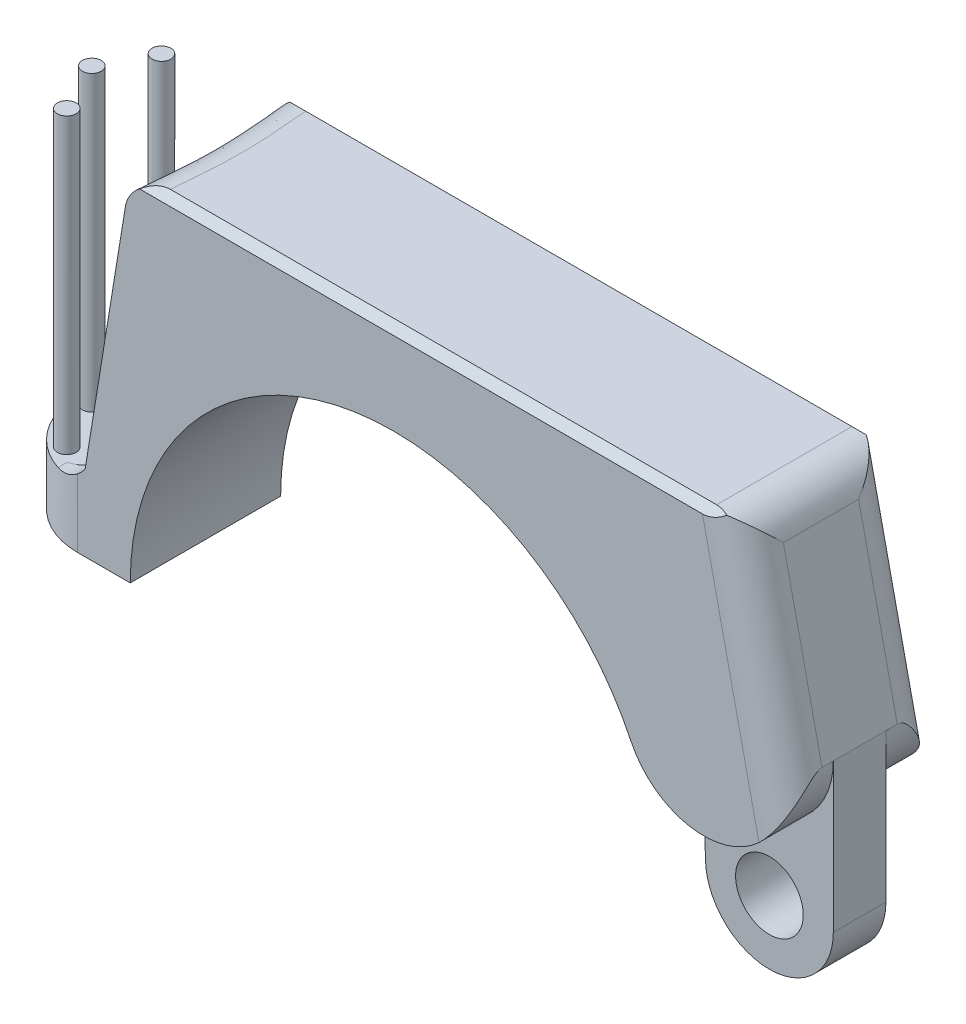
ISO-10303-21;
HEADER;
FILE_DESCRIPTION(('STEP AP214'),'2;1');
FILE_NAME('part.step','',(''),(''),'','','');
FILE_SCHEMA(('AUTOMOTIVE_DESIGN { 1 0 10303 214 1 1 1 1 }'));
ENDSEC;
DATA;
#1=APPLICATION_CONTEXT('core data for automotive mechanical design processes');
#2=APPLICATION_PROTOCOL_DEFINITION('international standard','automotive_design',2000,#1);
#3=PRODUCT_CONTEXT('',#1,'mechanical');
#4=PRODUCT('Part','Part','',(#3));
#5=PRODUCT_RELATED_PRODUCT_CATEGORY('part','',(#4));
#6=PRODUCT_DEFINITION_FORMATION('','',#4);
#7=PRODUCT_DEFINITION_CONTEXT('part definition',#1,'design');
#8=PRODUCT_DEFINITION('design','',#6,#7);
#9=PRODUCT_DEFINITION_SHAPE('','',#8);
#10=(LENGTH_UNIT() NAMED_UNIT(*) SI_UNIT(.MILLI.,.METRE.));
#11=(NAMED_UNIT(*) PLANE_ANGLE_UNIT() SI_UNIT($,.RADIAN.));
#12=(NAMED_UNIT(*) SI_UNIT($,.STERADIAN.) SOLID_ANGLE_UNIT());
#13=UNCERTAINTY_MEASURE_WITH_UNIT(LENGTH_MEASURE(1.E-05),#10,'distance_accuracy_value','');
#14=(GEOMETRIC_REPRESENTATION_CONTEXT(3) GLOBAL_UNCERTAINTY_ASSIGNED_CONTEXT((#13)) GLOBAL_UNIT_ASSIGNED_CONTEXT((#10,
#11,#12)) REPRESENTATION_CONTEXT('',''));
#15=CARTESIAN_POINT('',(0.,0.,0.));
#16=DIRECTION('',(0.,0.,1.));
#17=DIRECTION('',(1.,0.,0.));
#18=AXIS2_PLACEMENT_3D('',#15,#16,#17);
#19=CARTESIAN_POINT('',(0.,0.,-10.));
#20=DIRECTION('',(0.,0.,1.));
#21=DIRECTION('',(1.,0.,0.));
#22=AXIS2_PLACEMENT_3D('',#19,#20,#21);
#23=CYLINDRICAL_SURFACE('',#22,35.);
#24=DIRECTION('',(0.,0.,-1.));
#25=VECTOR('',#24,1.);
#26=CARTESIAN_POINT('',(31.5729280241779,15.104642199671,10.));
#27=LINE('',#26,#25);
#28=CARTESIAN_POINT('',(31.5729280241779,15.104642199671,10.));
#29=VERTEX_POINT('',#28);
#30=CARTESIAN_POINT('',(31.5729280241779,15.104642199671,3.5));
#31=VERTEX_POINT('',#30);
#32=EDGE_CURVE('E550',#29,#31,#27,.T.);
#33=ORIENTED_EDGE('',*,*,#32,.F.);
#34=CARTESIAN_POINT('',(0.,0.,10.));
#35=DIRECTION('',(0.,0.,1.));
#36=DIRECTION('',(1.,0.,0.));
#37=AXIS2_PLACEMENT_3D('',#34,#35,#36);
#38=CIRCLE('',#37,35.);
#39=CARTESIAN_POINT('',(-35.,0.,10.));
#40=VERTEX_POINT('',#39);
#41=EDGE_CURVE('E485',#29,#40,#38,.T.);
#42=ORIENTED_EDGE('',*,*,#41,.T.);
#43=DIRECTION('',(0.,0.,1.));
#44=VECTOR('',#43,1.);
#45=CARTESIAN_POINT('',(-35.,0.,-10.));
#46=LINE('',#45,#44);
#47=CARTESIAN_POINT('',(-35.,0.,-10.));
#48=VERTEX_POINT('',#47);
#49=EDGE_CURVE('E481',#48,#40,#46,.T.);
#50=ORIENTED_EDGE('',*,*,#49,.F.);
#51=CARTESIAN_POINT('',(0.,0.,-10.));
#52=DIRECTION('',(0.,0.,1.));
#53=DIRECTION('',(1.,0.,0.));
#54=AXIS2_PLACEMENT_3D('',#51,#52,#53);
#55=CIRCLE('',#54,35.);
#56=CARTESIAN_POINT('',(31.5729280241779,15.104642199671,-10.));
#57=VERTEX_POINT('',#56);
#58=EDGE_CURVE('E484',#57,#48,#55,.T.);
#59=ORIENTED_EDGE('',*,*,#58,.F.);
#60=CARTESIAN_POINT('',(31.5729280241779,15.104642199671,-3.5));
#61=VERTEX_POINT('',#60);
#62=EDGE_CURVE('E549',#61,#57,#27,.T.);
#63=ORIENTED_EDGE('',*,*,#62,.F.);
#64=CARTESIAN_POINT('',(-3.46944695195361E-13,0.,-3.5));
#65=DIRECTION('',(0.,0.,-1.));
#66=DIRECTION('',(1.,0.,0.));
#67=AXIS2_PLACEMENT_3D('',#64,#65,#66);
#68=CIRCLE('',#67,35.0000000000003);
#69=CARTESIAN_POINT('',(35.,0.,-3.5));
#70=VERTEX_POINT('',#69);
#71=EDGE_CURVE('E536',#61,#70,#68,.T.);
#72=ORIENTED_EDGE('',*,*,#71,.T.);
#73=DIRECTION('',(0.,0.,1.));
#74=VECTOR('',#73,1.);
#75=CARTESIAN_POINT('',(35.,0.,-3.5));
#76=LINE('',#75,#74);
#77=CARTESIAN_POINT('',(35.,0.,3.5));
#78=VERTEX_POINT('',#77);
#79=EDGE_CURVE('E540',#70,#78,#76,.T.);
#80=ORIENTED_EDGE('',*,*,#79,.T.);
#81=CARTESIAN_POINT('',(-3.46944695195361E-13,0.,3.5));
#82=DIRECTION('',(0.,0.,-1.));
#83=DIRECTION('',(1.,0.,0.));
#84=AXIS2_PLACEMENT_3D('',#81,#82,#83);
#85=CIRCLE('',#84,35.0000000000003);
#86=EDGE_CURVE('E521',#31,#78,#85,.T.);
#87=ORIENTED_EDGE('',*,*,#86,.F.);
#88=EDGE_LOOP('',(#33,#42,#50,#59,#63,#72,#80,#87));
#89=FACE_BOUND('',#88,.T.);
#90=CARTESIAN_POINT('',(0.,0.,-4.));
#91=DIRECTION('',(0.,0.,1.));
#92=DIRECTION('',(1.,0.,0.));
#93=AXIS2_PLACEMENT_3D('',#90,#91,#92);
#94=CIRCLE('',#93,35.);
#95=CARTESIAN_POINT('',(-25.5729280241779,23.8961367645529,-4.));
#96=VERTEX_POINT('',#95);
#97=CARTESIAN_POINT('',(25.5729280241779,23.8961367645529,-4.));
#98=VERTEX_POINT('',#97);
#99=EDGE_CURVE('E13',#96,#98,#94,.F.);
#100=ORIENTED_EDGE('',*,*,#99,.F.);
#101=DIRECTION('',(0.,0.,1.));
#102=VECTOR('',#101,1.);
#103=CARTESIAN_POINT('',(-25.5729280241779,23.8961367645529,-10.));
#104=LINE('',#103,#102);
#105=CARTESIAN_POINT('',(-25.5729280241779,23.8961367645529,4.));
#106=VERTEX_POINT('',#105);
#107=EDGE_CURVE('E391',#106,#96,#104,.F.);
#108=ORIENTED_EDGE('',*,*,#107,.F.);
#109=CARTESIAN_POINT('',(0.,0.,4.));
#110=DIRECTION('',(0.,0.,-1.));
#111=DIRECTION('',(-1.,0.,0.));
#112=AXIS2_PLACEMENT_3D('',#109,#110,#111);
#113=CIRCLE('',#112,35.);
#114=CARTESIAN_POINT('',(25.5729280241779,23.8961367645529,4.));
#115=VERTEX_POINT('',#114);
#116=EDGE_CURVE('E393',#115,#106,#113,.F.);
#117=ORIENTED_EDGE('',*,*,#116,.F.);
#118=DIRECTION('',(0.,0.,1.));
#119=VECTOR('',#118,1.);
#120=CARTESIAN_POINT('',(25.5729280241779,23.8961367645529,-10.));
#121=LINE('',#120,#119);
#122=EDGE_CURVE('E74',#98,#115,#121,.T.);
#123=ORIENTED_EDGE('',*,*,#122,.F.);
#124=EDGE_LOOP('',(#100,#108,#117,#123));
#125=FACE_BOUND('',#124,.T.);
#126=ADVANCED_FACE('F65',(#89,#125),#23,.F.);
#127=CARTESIAN_POINT('',(0.,47.,-10.));
#128=DIRECTION('',(0.,-1.,0.));
#129=DIRECTION('',(0.,0.,-1.));
#130=AXIS2_PLACEMENT_3D('',#127,#128,#129);
#131=PLANE('',#130);
#132=CARTESIAN_POINT('',(-31.2092544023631,47.,16.0847525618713));
#133=CARTESIAN_POINT('',(-34.9543701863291,47.,15.8277103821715));
#134=CARTESIAN_POINT('',(-35.9993896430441,43.3951764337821,15.7559865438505));
#135=CARTESIAN_POINT('',(-31.1999918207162,47.,15.9497911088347));
#136=CARTESIAN_POINT('',(-34.9547551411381,47.,15.6910345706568));
#137=CARTESIAN_POINT('',(-35.9935130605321,43.3832215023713,15.619616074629));
#138=CARTESIAN_POINT('',(-31.1906792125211,47.,15.8148331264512));
#139=CARTESIAN_POINT('',(-34.9551513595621,47.,15.5544787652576));
#140=CARTESIAN_POINT('',(-35.9875521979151,43.3712108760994,15.4832425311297));
#141=CARTESIAN_POINT('',(-31.1719539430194,47.,15.5449241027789));
#142=CARTESIAN_POINT('',(-34.9559671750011,47.,15.2813440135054));
#143=CARTESIAN_POINT('',(-35.9754619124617,43.3470782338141,15.2104892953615));
#144=CARTESIAN_POINT('',(-31.1625412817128,47.,15.4099730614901));
#145=CARTESIAN_POINT('',(-34.9563868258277,47.,15.1447618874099));
#146=CARTESIAN_POINT('',(-35.969332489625,43.3349562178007,15.0741096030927));
#147=CARTESIAN_POINT('',(-31.1530785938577,47.,15.2750254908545));
#148=CARTESIAN_POINT('',(-34.9568178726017,47.,15.008292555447));
#149=CARTESIAN_POINT('',(-35.9631187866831,43.3227785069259,14.9377268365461));
#150=CARTESIAN_POINT('',(-31.1372939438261,47.,15.0499288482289));
#151=CARTESIAN_POINT('',(-34.9575390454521,47.,14.7800795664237));
#152=CARTESIAN_POINT('',(-35.9527523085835,43.302465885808,14.7102363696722));
#153=CARTESIAN_POINT('',(-31.1213686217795,47.,14.824842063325));
#154=CARTESIAN_POINT('',(-34.9582929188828,47.,14.5521873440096));
#155=CARTESIAN_POINT('',(-35.9421469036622,43.2819983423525,14.4827377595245));
#156=CARTESIAN_POINT('',(-31.0892316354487,47.,14.3746887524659));
#157=CARTESIAN_POINT('',(-34.9598717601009,47.,14.0963406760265));
#158=CARTESIAN_POINT('',(-35.9204428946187,43.2407549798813,14.0277258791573));
#159=CARTESIAN_POINT('',(-31.0730199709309,47.,14.1496222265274));
#160=CARTESIAN_POINT('',(-34.9606970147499,47.,13.8683710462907));
#161=CARTESIAN_POINT('',(-35.9093442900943,43.2199791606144,13.8002126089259));
#162=CARTESIAN_POINT('',(-31.0403043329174,47.,13.6994966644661));
#163=CARTESIAN_POINT('',(-34.9624226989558,47.,13.4123533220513));
#164=CARTESIAN_POINT('',(-35.8866378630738,43.1781195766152,13.3451595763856));
#165=CARTESIAN_POINT('',(-31.023800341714,47.,13.4744376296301));
#166=CARTESIAN_POINT('',(-34.9633234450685,47.,13.1842898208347));
#167=CARTESIAN_POINT('',(-35.8750300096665,43.1570357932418,13.1176198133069));
#168=CARTESIAN_POINT('',(-30.990496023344,47.,13.024341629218));
#169=CARTESIAN_POINT('',(-34.9652042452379,47.,12.7280960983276));
#170=CARTESIAN_POINT('',(-35.8512901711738,43.1145638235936,12.662529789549));
#171=CARTESIAN_POINT('',(-30.9736956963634,47.,12.7993046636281));
#172=CARTESIAN_POINT('',(-34.9661846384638,47.,12.4999501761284));
#173=CARTESIAN_POINT('',(-35.8391581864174,43.0931756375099,12.4349795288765));
#174=CARTESIAN_POINT('',(-30.9397602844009,47.,12.3488097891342));
#175=CARTESIAN_POINT('',(-34.9682310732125,47.,12.0431375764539));
#176=CARTESIAN_POINT('',(-35.8143299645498,43.0500552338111,11.9794219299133));
#177=CARTESIAN_POINT('',(-30.9226246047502,47.,12.123351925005));
#178=CARTESIAN_POINT('',(-34.9692976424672,47.,11.8144563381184));
#179=CARTESIAN_POINT('',(-35.8016326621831,43.0283224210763,11.751414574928));
#180=CARTESIAN_POINT('',(-30.8966904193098,47.,11.7851826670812));
#181=CARTESIAN_POINT('',(-34.9709623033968,47.,11.4716930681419));
#182=CARTESIAN_POINT('',(-35.7821683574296,42.9954987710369,11.4093987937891));
#183=CARTESIAN_POINT('',(-30.8880072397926,47.,11.6724624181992));
#184=CARTESIAN_POINT('',(-34.9715288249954,47.,11.3573225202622));
#185=CARTESIAN_POINT('',(-35.7756105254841,42.9845201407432,11.2953926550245));
#186=CARTESIAN_POINT('',(-30.8705633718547,47.,11.4470279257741));
#187=CARTESIAN_POINT('',(-34.97268460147,47.,11.1285611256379));
#188=CARTESIAN_POINT('',(-35.7623534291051,42.9624885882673,11.0673792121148));
#189=CARTESIAN_POINT('',(-30.8618026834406,47.,11.3343136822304));
#190=CARTESIAN_POINT('',(-34.9732739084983,47.,11.014168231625));
#191=CARTESIAN_POINT('',(-35.7556541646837,42.9514356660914,10.9533719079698));
#192=CARTESIAN_POINT('',(-30.8442036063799,47.,11.1088968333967));
#193=CARTESIAN_POINT('',(-34.9744758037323,47.,10.7853672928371));
#194=CARTESIAN_POINT('',(-35.7421125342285,42.9292566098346,10.7253618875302));
#195=CARTESIAN_POINT('',(-30.835365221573,47.,10.996194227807));
#196=CARTESIAN_POINT('',(-34.9750884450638,47.,10.6709571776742));
#197=CARTESIAN_POINT('',(-35.7352701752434,42.9181304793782,10.6113591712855));
#198=CARTESIAN_POINT('',(-30.8220485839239,47.,10.8271449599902));
#199=CARTESIAN_POINT('',(-34.9760249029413,47.,10.4994076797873));
#200=CARTESIAN_POINT('',(-35.7248976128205,42.9013864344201,10.4403550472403));
#201=CARTESIAN_POINT('',(-30.8175998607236,47.,10.7707959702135));
#202=CARTESIAN_POINT('',(-34.9763402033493,47.,10.4421945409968));
#203=CARTESIAN_POINT('',(-35.7214219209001,42.8957959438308,10.3833536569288));
#204=CARTESIAN_POINT('',(-30.8086826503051,47.,10.6580995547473));
#205=CARTESIAN_POINT('',(-34.9769768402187,47.,10.327762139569));
#206=CARTESIAN_POINT('',(-35.7144338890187,42.8845967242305,10.2693501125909));
#207=CARTESIAN_POINT('',(-30.804214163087,47.,10.6017521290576));
#208=CARTESIAN_POINT('',(-34.9772981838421,47.,10.27054261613));
#209=CARTESIAN_POINT('',(-35.7109215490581,42.8789879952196,10.2123479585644));
#210=CARTESIAN_POINT('',(-30.7952573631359,47.,10.4890590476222));
#211=CARTESIAN_POINT('',(-34.9779470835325,47.,10.1561003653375));
#212=CARTESIAN_POINT('',(-35.7038602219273,42.8677525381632,10.0983463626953));
#213=CARTESIAN_POINT('',(-30.7907690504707,47.,10.4327133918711));
#214=CARTESIAN_POINT('',(-34.9782746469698,47.,10.0988773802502));
#215=CARTESIAN_POINT('',(-35.7003112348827,42.8621258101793,10.0413469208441));
#216=CARTESIAN_POINT('',(-30.7817725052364,47.,10.3200236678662));
#217=CARTESIAN_POINT('',(-34.978935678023,47.,9.98441755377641));
#218=CARTESIAN_POINT('',(-35.6931754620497,42.8508538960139,9.92733844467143));
#219=CARTESIAN_POINT('',(-30.7772642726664,47.,10.2636795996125));
#220=CARTESIAN_POINT('',(-34.9792691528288,47.,9.92718043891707));
#221=CARTESIAN_POINT('',(-35.6895886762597,42.8452087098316,9.87032941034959));
#222=CARTESIAN_POINT('',(-30.7716164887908,47.,10.1932505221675));
#223=CARTESIAN_POINT('',(-34.9796904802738,47.,9.85567568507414));
#224=CARTESIAN_POINT('',(-35.685083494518,42.8381419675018,9.7990905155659));
#225=CARTESIAN_POINT('',(-30.7704863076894,47.,10.1791647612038));
#226=CARTESIAN_POINT('',(-34.979775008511,47.,9.84137032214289));
#227=CARTESIAN_POINT('',(-35.6841813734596,42.8367281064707,9.78484386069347));
#228=CARTESIAN_POINT('',(-30.7682246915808,47.,10.1509933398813));
#229=CARTESIAN_POINT('',(-34.9799438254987,47.,9.81274206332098));
#230=CARTESIAN_POINT('',(-35.6823733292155,42.8338984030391,9.75633058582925));
#231=CARTESIAN_POINT('',(-30.7670932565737,47.,10.1369076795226));
#232=CARTESIAN_POINT('',(-34.9800281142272,47.,9.79841915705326));
#233=CARTESIAN_POINT('',(-35.6814674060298,42.8324825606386,9.7420639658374));
#234=CARTESIAN_POINT('',(-30.7653951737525,47.,10.115779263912));
#235=CARTESIAN_POINT('',(-34.9801566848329,47.,9.77698590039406));
#236=CARTESIAN_POINT('',(-35.6801110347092,42.830360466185,9.72072226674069));
#237=CARTESIAN_POINT('',(-30.7648289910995,47.,10.1087364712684));
#238=CARTESIAN_POINT('',(-34.9801999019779,47.,9.76984935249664));
#239=CARTESIAN_POINT('',(-35.67965932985,42.8296533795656,9.71361807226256));
#240=CARTESIAN_POINT('',(-30.7636962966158,47.,10.0946509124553));
#241=CARTESIAN_POINT('',(-34.9802830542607,47.,9.75548456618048));
#242=CARTESIAN_POINT('',(-35.6787475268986,42.8282343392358,9.69930321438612));
#243=CARTESIAN_POINT('',(-30.7631297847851,47.,10.087608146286));
#244=CARTESIAN_POINT('',(-34.9803229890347,47.,9.74825631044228));
#245=CARTESIAN_POINT('',(-35.6782874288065,42.8275223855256,9.692092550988));
#246=CARTESIAN_POINT('',(-30.7614289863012,47.,10.0664799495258));
#247=CARTESIAN_POINT('',(-34.9804417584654,47.,9.72654067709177));
#248=CARTESIAN_POINT('',(-35.6769030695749,42.8253838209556,9.67042655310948));
#249=CARTESIAN_POINT('',(-30.760293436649,47.,10.0523946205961));
#250=CARTESIAN_POINT('',(-34.9805195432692,47.,9.71202506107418));
#251=CARTESIAN_POINT('',(-35.6759747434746,42.823954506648,9.65593721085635));
#252=CARTESIAN_POINT('',(-30.756882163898,47.,10.0101390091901));
#253=CARTESIAN_POINT('',(-34.9807542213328,47.,9.66850239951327));
#254=CARTESIAN_POINT('',(-35.6731864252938,42.8196636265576,9.61250479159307));
#255=CARTESIAN_POINT('',(-30.7546018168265,47.,9.98196909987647));
#256=CARTESIAN_POINT('',(-34.9809123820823,47.,9.63953022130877));
#257=CARTESIAN_POINT('',(-35.6713230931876,42.8167991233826,9.58359731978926));
#258=CARTESIAN_POINT('',(-30.7500290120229,47.,9.92563026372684));
#259=CARTESIAN_POINT('',(-34.981229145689,47.,9.58158803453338));
#260=CARTESIAN_POINT('',(-35.6675810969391,42.8110590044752,9.52578818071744));
#261=CARTESIAN_POINT('',(-30.7477365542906,47.,9.89746133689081));
#262=CARTESIAN_POINT('',(-34.9813877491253,47.,9.55261796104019));
#263=CARTESIAN_POINT('',(-35.6657024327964,42.8081833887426,9.49688651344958));
#264=CARTESIAN_POINT('',(-30.7412440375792,47.,9.81788725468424));
#265=CARTESIAN_POINT('',(-34.981837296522,47.,9.47079289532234));
#266=CARTESIAN_POINT('',(-35.66037640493,42.8000467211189,9.41528079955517));
#267=CARTESIAN_POINT('',(-30.7370303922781,47.,9.76648320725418));
#268=CARTESIAN_POINT('',(-34.9821293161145,47.,9.41797941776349));
#269=CARTESIAN_POINT('',(-35.6569134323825,42.794774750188,9.36260946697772));
#270=CARTESIAN_POINT('',(-30.7285667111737,47.,9.66367810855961));
#271=CARTESIAN_POINT('',(-34.9827152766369,47.,9.31241214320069));
#272=CARTESIAN_POINT('',(-35.6499434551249,42.7842033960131,9.25734577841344));
#273=CARTESIAN_POINT('',(-30.7243166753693,47.,9.61227705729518));
#274=CARTESIAN_POINT('',(-34.9830092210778,47.,9.2596580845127));
#275=CARTESIAN_POINT('',(-35.6464364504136,42.7789040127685,9.2047534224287));
#276=CARTESIAN_POINT('',(-30.7115157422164,47.,9.45807809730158));
#277=CARTESIAN_POINT('',(-34.9838931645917,47.,9.10141933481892));
#278=CARTESIAN_POINT('',(-35.6358525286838,42.7629716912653,9.04710151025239));
#279=CARTESIAN_POINT('',(-30.7029140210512,47.,9.35528440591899));
#280=CARTESIAN_POINT('',(-34.9844844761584,47.,8.99610235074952));
#281=CARTESIAN_POINT('',(-35.6287127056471,42.7523045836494,8.94216713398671));
#282=CARTESIAN_POINT('',(-30.6769355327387,47.,9.0469178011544));
#283=CARTESIAN_POINT('',(-34.9862560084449,47.,8.68025056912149));
#284=CARTESIAN_POINT('',(-35.607063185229,42.7202187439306,8.6278627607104));
#285=CARTESIAN_POINT('',(-30.6593854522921,47.,8.8413594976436));
#286=CARTESIAN_POINT('',(-34.9874305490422,47.,8.4703968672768));
#287=CARTESIAN_POINT('',(-35.5923234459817,42.6987155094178,8.41899166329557));
#288=CARTESIAN_POINT('',(-30.6239874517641,47.,8.43026713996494));
#289=CARTESIAN_POINT('',(-34.9897158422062,47.,8.05183274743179));
#290=CARTESIAN_POINT('',(-35.5623664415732,42.6557577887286,8.00263315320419));
#291=CARTESIAN_POINT('',(-30.6061395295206,47.,8.22473308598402));
#292=CARTESIAN_POINT('',(-34.9908263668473,47.,7.84312397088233));
#293=CARTESIAN_POINT('',(-35.5471491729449,42.6343033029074,7.79514575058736));
#294=CARTESIAN_POINT('',(-30.579265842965,47.,7.91644090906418));
#295=CARTESIAN_POINT('',(-34.9924086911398,47.,7.53117710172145));
#296=CARTESIAN_POINT('',(-35.5240668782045,42.6023354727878,7.48487362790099));
#297=CARTESIAN_POINT('',(-30.5702909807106,47.,7.81367833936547));
#298=CARTESIAN_POINT('',(-34.9929228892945,47.,7.42723473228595));
#299=CARTESIAN_POINT('',(-35.5163300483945,42.5917151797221,7.38160942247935));
#300=CARTESIAN_POINT('',(-30.5523331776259,47.,7.60815390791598));
#301=CARTESIAN_POINT('',(-34.9939185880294,47.,7.21985217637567));
#302=CARTESIAN_POINT('',(-35.5008140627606,42.5706025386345,7.1756463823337));
#303=CARTESIAN_POINT('',(-30.5433502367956,47.,7.5053920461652));
#304=CARTESIAN_POINT('',(-34.9944000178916,47.,7.11641476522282));
#305=CARTESIAN_POINT('',(-35.4930349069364,42.5601101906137,7.0729475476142));
#306=CARTESIAN_POINT('',(-30.5164403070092,47.,7.19707450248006));
#307=CARTESIAN_POINT('',(-34.9957888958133,47.,6.80653145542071));
#308=CARTESIAN_POINT('',(-35.4696802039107,42.5288881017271,6.76564561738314));
#309=CARTESIAN_POINT('',(-30.4985546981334,47.,6.99151518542));
#310=CARTESIAN_POINT('',(-34.9966376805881,47.,6.60114601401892));
#311=CARTESIAN_POINT('',(-35.4540895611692,42.5084162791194,6.56186562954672));
#312=CARTESIAN_POINT('',(-30.463159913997,47.,6.5803640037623));
#313=CARTESIAN_POINT('',(-34.9981577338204,47.,6.19235619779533));
#314=CARTESIAN_POINT('',(-35.4231222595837,42.4684591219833,6.15641555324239));
#315=CARTESIAN_POINT('',(-30.4456507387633,47.,6.37477213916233));
#316=CARTESIAN_POINT('',(-34.9988282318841,47.,5.98899183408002));
#317=CARTESIAN_POINT('',(-35.407745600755,42.4489737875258,5.95474546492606));
#318=CARTESIAN_POINT('',(-30.4112684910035,47.,5.96353483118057));
#319=CARTESIAN_POINT('',(-34.9999797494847,47.,5.58428315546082));
#320=CARTESIAN_POINT('',(-35.377465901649,42.4112485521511,5.5534831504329));
#321=CARTESIAN_POINT('',(-30.3943954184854,47.,5.75788938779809));
#322=CARTESIAN_POINT('',(-35.00045998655,47.,5.38298876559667));
#323=CARTESIAN_POINT('',(-35.3625628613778,42.39300865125,5.35389092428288));
#324=CARTESIAN_POINT('',(-30.3738556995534,47.,5.50078855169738));
#325=CARTESIAN_POINT('',(-35.0009444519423,47.,5.13277229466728));
#326=CARTESIAN_POINT('',(-35.3443725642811,42.3711020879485,5.10548113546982));
#327=CARTESIAN_POINT('',(-30.3697753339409,47.,5.44936614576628));
#328=CARTESIAN_POINT('',(-35.0010356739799,47.,5.08272474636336));
#329=CARTESIAN_POINT('',(-35.3407564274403,42.3667654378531,5.0558531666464));
#330=CARTESIAN_POINT('',(-30.3616742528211,47.,5.34651663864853));
#331=CARTESIAN_POINT('',(-35.0012055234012,47.,4.98285084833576));
#332=CARTESIAN_POINT('',(-35.333580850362,42.3581954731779,4.95682080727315));
#333=CARTESIAN_POINT('',(-30.3576535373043,47.,5.29508953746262));
#334=CARTESIAN_POINT('',(-35.0012841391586,47.,4.93302559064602));
#335=CARTESIAN_POINT('',(-35.3300214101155,42.3539621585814,4.90741641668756));
#336=CARTESIAN_POINT('',(-30.3456895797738,47.,5.1408006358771));
#337=CARTESIAN_POINT('',(-35.0015032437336,47.,4.78367356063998));
#338=CARTESIAN_POINT('',(-35.3194249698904,42.3414099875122,4.75937702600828));
#339=CARTESIAN_POINT('',(-30.3378445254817,47.,5.03793122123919));
#340=CARTESIAN_POINT('',(-35.0016267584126,47.,4.6843931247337));
#341=CARTESIAN_POINT('',(-35.3124698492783,42.3332389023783,4.6609157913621));
#342=CARTESIAN_POINT('',(-30.3147806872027,47.,4.72973947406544));
#343=CARTESIAN_POINT('',(-35.0019348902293,47.,4.38752958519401));
#344=CARTESIAN_POINT('',(-35.2920108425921,42.3093847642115,4.36669241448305));
#345=CARTESIAN_POINT('',(-30.2999970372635,47.,4.5243842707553));
#346=CARTESIAN_POINT('',(-35.0020570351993,47.,4.19097788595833));
#347=CARTESIAN_POINT('',(-35.2788812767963,42.2943223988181,4.17165715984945));
#348=CARTESIAN_POINT('',(-30.2718329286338,47.,4.11357727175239));
#349=CARTESIAN_POINT('',(-35.0021699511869,47.,3.79979024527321));
#350=CARTESIAN_POINT('',(-35.2538568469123,42.2659925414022,3.78340187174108));
#351=CARTESIAN_POINT('',(-30.2584524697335,47.,3.90812547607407));
#352=CARTESIAN_POINT('',(-35.0021603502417,47.,3.60522400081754));
#353=CARTESIAN_POINT('',(-35.2419619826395,42.2527250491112,3.59018183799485));
#354=CARTESIAN_POINT('',(-30.2333208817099,47.,3.49712226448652));
#355=CARTESIAN_POINT('',(-35.0020464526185,47.,3.21793419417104));
#356=CARTESIAN_POINT('',(-35.2196255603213,42.2280989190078,3.2054649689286));
#357=CARTESIAN_POINT('',(-30.2215697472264,47.,3.29157084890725));
#358=CARTESIAN_POINT('',(-35.0019419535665,47.,3.02528405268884));
#359=CARTESIAN_POINT('',(-35.2091839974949,42.2167402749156,3.01396812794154));
#360=CARTESIAN_POINT('',(-30.1999228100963,47.,2.88036994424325));
#361=CARTESIAN_POINT('',(-35.0016756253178,47.,2.64175652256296));
#362=CARTESIAN_POINT('',(-35.1899648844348,42.1960397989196,2.63262813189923));
#363=CARTESIAN_POINT('',(-30.1900270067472,47.,2.67472045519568));
#364=CARTESIAN_POINT('',(-35.0015137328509,47.,2.45095595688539));
#365=CARTESIAN_POINT('',(-35.1811873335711,42.1866979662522,2.44278497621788));
#366=CARTESIAN_POINT('',(-30.1722573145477,47.,2.26340004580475));
#367=CARTESIAN_POINT('',(-35.0011791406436,47.,2.07044146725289));
#368=CARTESIAN_POINT('',(-35.1654215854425,42.1700460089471,2.0640629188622));
#369=CARTESIAN_POINT('',(-30.1643827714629,47.,2.05772915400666));
#370=CARTESIAN_POINT('',(-35.0010064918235,47.,1.88080264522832));
#371=CARTESIAN_POINT('',(-35.1584328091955,42.162735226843,1.87518372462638));
#372=CARTESIAN_POINT('',(-30.1541767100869,47.,1.74917020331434));
#373=CARTESIAN_POINT('',(-35.0007632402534,47.,1.5972465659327));
#374=CARTESIAN_POINT('',(-35.1493814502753,42.1533204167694,1.59262289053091));
#375=CARTESIAN_POINT('',(-30.1510423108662,47.,1.64630826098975));
#376=CARTESIAN_POINT('',(-35.0006847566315,47.,1.50284932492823));
#377=CARTESIAN_POINT('',(-35.1466029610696,42.1504407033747,1.49856209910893));
#378=CARTESIAN_POINT('',(-30.1453265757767,47.,1.44056907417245));
#379=CARTESIAN_POINT('',(-35.0005364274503,47.,1.31434420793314));
#380=CARTESIAN_POINT('',(-35.1415388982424,42.1452058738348,1.31070766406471));
#381=CARTESIAN_POINT('',(-30.142745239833,47.,1.33769182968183));
#382=CARTESIAN_POINT('',(-35.0004665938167,47.,1.22024605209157));
#383=CARTESIAN_POINT('',(-35.1392533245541,42.1428507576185,1.21691402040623));
#384=CARTESIAN_POINT('',(-30.1358474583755,47.,1.02904113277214));
#385=CARTESIAN_POINT('',(-35.0002759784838,47.,0.938033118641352));
#386=CARTESIAN_POINT('',(-35.1331446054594,42.1365676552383,0.935640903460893));
#387=CARTESIAN_POINT('',(-30.1323772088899,47.,0.823247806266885));
#388=CARTESIAN_POINT('',(-35.0001742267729,47.,0.750171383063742));
#389=CARTESIAN_POINT('',(-35.1300694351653,42.133421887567,0.748268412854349));
#390=CARTESIAN_POINT('',(-30.1288950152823,47.,0.514539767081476));
#391=CARTESIAN_POINT('',(-35.0000706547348,47.,0.468643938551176));
#392=CARTESIAN_POINT('',(-35.1269847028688,42.1302702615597,0.467459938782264));
#393=CARTESIAN_POINT('',(-30.1280214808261,47.,0.411633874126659));
#394=CARTESIAN_POINT('',(-35.0000443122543,47.,0.374845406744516));
#395=CARTESIAN_POINT('',(-35.126211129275,42.1294808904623,0.373898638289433));
#396=CARTESIAN_POINT('',(-30.1268548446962,47.,0.205818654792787));
#397=CARTESIAN_POINT('',(-35.00000898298,47.,0.187359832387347));
#398=CARTESIAN_POINT('',(-35.1251782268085,42.1284272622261,0.186891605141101));
#399=CARTESIAN_POINT('',(-30.1265617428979,47.,0.102909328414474));
#400=CARTESIAN_POINT('',(-34.9999999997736,47.,0.0936823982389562));
#401=CARTESIAN_POINT('',(-35.1249188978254,42.1281630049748,0.0934458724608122));
#402=CARTESIAN_POINT('',(-30.126561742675,47.,-0.103671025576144));
#403=CARTESIAN_POINT('',(-35.0000000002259,47.,-0.09437580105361));
#404=CARTESIAN_POINT('',(-35.1249188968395,42.1281630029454,-0.0941375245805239));
#405=CARTESIAN_POINT('',(-30.1268591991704,47.,-0.207342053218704));
#406=CARTESIAN_POINT('',(-35.0000091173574,47.,-0.188746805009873));
#407=CARTESIAN_POINT('',(-35.1251820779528,42.1284311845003,-0.18827519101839));
#408=CARTESIAN_POINT('',(-30.1280431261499,47.,-0.414680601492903));
#409=CARTESIAN_POINT('',(-35.000044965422,47.,-0.377621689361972));
#410=CARTESIAN_POINT('',(-35.1262302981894,42.129500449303,-0.376667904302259));
#411=CARTESIAN_POINT('',(-30.1289295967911,47.,-0.5183481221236));
#412=CARTESIAN_POINT('',(-35.0000716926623,47.,-0.472115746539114));
#413=CARTESIAN_POINT('',(-35.127015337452,42.1303015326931,-0.470922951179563));
#414=CARTESIAN_POINT('',(-30.1324632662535,47.,-0.829340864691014));
#415=CARTESIAN_POINT('',(-35.0001767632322,47.,-0.755730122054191));
#416=CARTESIAN_POINT('',(-35.1301456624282,42.1334998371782,-0.75381279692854));
#417=CARTESIAN_POINT('',(-30.135984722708,47.,-1.03665707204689));
#418=CARTESIAN_POINT('',(-35.0002799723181,47.,-0.944983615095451));
#419=CARTESIAN_POINT('',(-35.1332661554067,42.1366921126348,-0.942573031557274));
#420=CARTESIAN_POINT('',(-30.1429840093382,47.,-1.34759127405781));
#421=CARTESIAN_POINT('',(-35.0004730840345,47.,-1.22930095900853));
#422=CARTESIAN_POINT('',(-35.1394648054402,42.1430685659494,-1.2259401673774));
#423=CARTESIAN_POINT('',(-30.1456032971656,47.,-1.45122958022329));
#424=CARTESIAN_POINT('',(-35.0005438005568,47.,-1.32410243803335));
#425=CARTESIAN_POINT('',(-35.141784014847,42.1454587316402,-1.32043391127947));
#426=CARTESIAN_POINT('',(-30.1514025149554,47.,-1.65849057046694));
#427=CARTESIAN_POINT('',(-35.0006938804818,47.,-1.51402213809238));
#428=CARTESIAN_POINT('',(-35.1469221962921,42.1507712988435,-1.50969563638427));
#429=CARTESIAN_POINT('',(-30.1545824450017,47.,-1.76211325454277));
#430=CARTESIAN_POINT('',(-35.000773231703,47.,-1.60913042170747));
#431=CARTESIAN_POINT('',(-35.1497411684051,42.1536937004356,-1.604463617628));
#432=CARTESIAN_POINT('',(-30.1649358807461,47.,-2.07295386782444));
#433=CARTESIAN_POINT('',(-35.0010189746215,47.,-1.89482295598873));
#434=CARTESIAN_POINT('',(-35.1589235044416,42.1632475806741,-1.88914967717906));
#435=CARTESIAN_POINT('',(-30.1729230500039,47.,-2.28014514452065));
#436=CARTESIAN_POINT('',(-35.0011931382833,47.,-2.08589314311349));
#437=CARTESIAN_POINT('',(-35.1660123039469,42.170665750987,-2.07945058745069));
#438=CARTESIAN_POINT('',(-30.1909445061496,47.,-2.69450592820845));
#439=CARTESIAN_POINT('',(-35.0015293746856,47.,-2.4693002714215));
#440=CARTESIAN_POINT('',(-35.1820015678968,42.1875625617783,-2.46104058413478));
#441=CARTESIAN_POINT('',(-30.2009794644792,47.,-2.9016754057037));
#442=CARTESIAN_POINT('',(-35.0016913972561,47.,-2.66156041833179));
#443=CARTESIAN_POINT('',(-35.1909026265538,42.1970418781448,-2.65232997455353));
#444=CARTESIAN_POINT('',(-30.2229242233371,47.,-3.31591462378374));
#445=CARTESIAN_POINT('',(-35.0019554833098,47.,-3.04805771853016));
#446=CARTESIAN_POINT('',(-35.2103870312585,42.2180449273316,-3.03660879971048));
#447=CARTESIAN_POINT('',(-30.2348340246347,47.,-3.52298436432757));
#448=CARTESIAN_POINT('',(-35.0020576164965,47.,-3.24221635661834));
#449=CARTESIAN_POINT('',(-35.2209703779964,42.2295686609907,-3.22959823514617));
#450=CARTESIAN_POINT('',(-30.2602972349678,47.,-3.93702278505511));
#451=CARTESIAN_POINT('',(-35.0021638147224,47.,-3.63254320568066));
#452=CARTESIAN_POINT('',(-35.2436016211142,42.2545475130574,-3.61731604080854));
#453=CARTESIAN_POINT('',(-30.2738506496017,47.,-4.14399146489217));
#454=CARTESIAN_POINT('',(-35.0021680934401,47.,-3.8286365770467));
#455=CARTESIAN_POINT('',(-35.2556495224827,42.2680026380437,-3.81204441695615));
#456=CARTESIAN_POINT('',(-30.3023688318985,47.,-4.55783116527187));
#457=CARTESIAN_POINT('',(-35.0020402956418,47.,-4.22294857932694));
#458=CARTESIAN_POINT('',(-35.2809887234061,42.2967307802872,-4.20338604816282));
#459=CARTESIAN_POINT('',(-30.317333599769,47.,-4.76470218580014));
#460=CARTESIAN_POINT('',(-35.0019086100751,47.,-4.4210959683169));
#461=CARTESIAN_POINT('',(-35.294280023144,42.3120037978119,-4.39999930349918));
#462=CARTESIAN_POINT('',(-30.340671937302,47.,-5.07516333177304));
#463=CARTESIAN_POINT('',(-35.0015839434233,47.,-4.72028368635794));
#464=CARTESIAN_POINT('',(-35.3149752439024,42.3361773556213,-4.69651012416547));
#465=CARTESIAN_POINT('',(-30.3486088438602,47.,-5.17878659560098));
#466=CARTESIAN_POINT('',(-35.001454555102,47.,-4.82032306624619));
#467=CARTESIAN_POINT('',(-35.3220079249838,42.3444553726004,-4.79571873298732));
#468=CARTESIAN_POINT('',(-30.3647423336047,47.,-5.38601292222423));
#469=CARTESIAN_POINT('',(-35.0011477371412,47.,-5.02108225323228));
#470=CARTESIAN_POINT('',(-35.3363025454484,42.3614233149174,-4.99479405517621));
#471=CARTESIAN_POINT('',(-30.3729389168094,47.,-5.48961598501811));
#472=CARTESIAN_POINT('',(-35.0009703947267,47.,-5.12179364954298));
#473=CARTESIAN_POINT('',(-35.3435644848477,42.3701132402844,-5.09466076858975));
#474=CARTESIAN_POINT('',(-30.3978571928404,47.,-5.80039867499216));
#475=CARTESIAN_POINT('',(-35.0003670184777,47.,-5.42447194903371));
#476=CARTESIAN_POINT('',(-35.3656173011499,42.3967299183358,-5.39502091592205));
#477=CARTESIAN_POINT('',(-30.4149074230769,47.,-6.00755194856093));
#478=CARTESIAN_POINT('',(-34.999869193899,47.,-5.62743863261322));
#479=CARTESIAN_POINT('',(-35.3806751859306,42.4152035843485,-5.59627449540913));
#480=CARTESIAN_POINT('',(-30.4496346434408,47.,-6.42180554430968));
#481=CARTESIAN_POINT('',(-34.9986807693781,47.,-6.03546708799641));
#482=CARTESIAN_POINT('',(-35.4112485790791,42.453392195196,-6.00083664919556));
#483=CARTESIAN_POINT('',(-30.467311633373,47.,-6.62890586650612));
#484=CARTESIAN_POINT('',(-34.9979909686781,47.,-6.2404788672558));
#485=CARTESIAN_POINT('',(-35.4267640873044,42.4731071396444,-6.20414522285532));
#486=CARTESIAN_POINT('',(-30.503027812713,47.,-7.04307512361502));
#487=CARTESIAN_POINT('',(-34.9964310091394,47.,-6.65257465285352));
#488=CARTESIAN_POINT('',(-35.4579912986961,42.5135156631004,-6.61289014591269));
#489=CARTESIAN_POINT('',(-30.5210670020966,47.,-7.25014405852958));
#490=CARTESIAN_POINT('',(-34.9955616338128,47.,-6.85961867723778));
#491=CARTESIAN_POINT('',(-35.4737030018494,42.5342092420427,-6.81832649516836));
#492=CARTESIAN_POINT('',(-30.5572224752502,47.,-7.66424598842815));
#493=CARTESIAN_POINT('',(-34.9936713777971,47.,-7.27587264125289));
#494=CARTESIAN_POINT('',(-35.5050639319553,42.5762656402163,-7.23154538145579));
#495=CARTESIAN_POINT('',(-30.575338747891,47.,-7.87127898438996));
#496=CARTESIAN_POINT('',(-34.992651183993,47.,-7.48505329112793));
#497=CARTESIAN_POINT('',(-35.5207131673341,42.5976283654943,-7.43932758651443));
#498=CARTESIAN_POINT('',(-30.6114103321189,47.,-8.28535907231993));
#499=CARTESIAN_POINT('',(-34.9905031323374,47.,-7.90461994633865));
#500=CARTESIAN_POINT('',(-35.551649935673,42.6406199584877,-7.85627825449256));
#501=CARTESIAN_POINT('',(-30.6293656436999,47.,-8.4924061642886));
#502=CARTESIAN_POINT('',(-34.9893757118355,47.,-8.11499607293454));
#503=CARTESIAN_POINT('',(-35.5669374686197,42.6622488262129,-8.0654467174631));
#504=CARTESIAN_POINT('',(-30.6560610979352,47.,-8.80299651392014));
#505=CARTESIAN_POINT('',(-34.9876380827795,47.,-8.43170992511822));
#506=CARTESIAN_POINT('',(-35.5894951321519,42.6947090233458,-8.38023287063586));
#507=CARTESIAN_POINT('',(-30.6649199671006,47.,-8.90652955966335));
#508=CARTESIAN_POINT('',(-34.9870519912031,47.,-8.53732162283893));
#509=CARTESIAN_POINT('',(-35.5969520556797,42.7055318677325,-8.48533346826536));
#510=CARTESIAN_POINT('',(-30.6825365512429,47.,-9.11360427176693));
#511=CARTESIAN_POINT('',(-34.9858717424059,47.,-8.74881849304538));
#512=CARTESIAN_POINT('',(-35.6117233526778,42.7271475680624,-8.69587745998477));
#513=CARTESIAN_POINT('',(-30.6912942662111,47.,-9.21714593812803));
#514=CARTESIAN_POINT('',(-34.9852775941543,47.,-8.85470426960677));
#515=CARTESIAN_POINT('',(-35.6190377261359,42.737940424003,-8.80132085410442));
#516=CARTESIAN_POINT('',(-30.7086880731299,47.,-9.42423942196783));
#517=CARTESIAN_POINT('',(-34.9840881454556,47.,-9.06673787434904));
#518=CARTESIAN_POINT('',(-35.6335077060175,42.759461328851,-9.01254502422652));
#519=CARTESIAN_POINT('',(-30.7173241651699,47.,-9.52779123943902));
#520=CARTESIAN_POINT('',(-34.983492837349,47.,-9.17288696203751));
#521=CARTESIAN_POINT('',(-35.6406633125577,42.7701893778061,-9.11832579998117));
#522=CARTESIAN_POINT('',(-30.7301716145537,47.,-9.68312777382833));
#523=CARTESIAN_POINT('',(-34.9826042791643,47.,-9.33237791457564));
#524=CARTESIAN_POINT('',(-35.651266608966,42.7862059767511,-9.27725253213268));
#525=CARTESIAN_POINT('',(-30.7344363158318,47.,-9.73490808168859));
#526=CARTESIAN_POINT('',(-34.9823090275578,47.,-9.38554964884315));
#527=CARTESIAN_POINT('',(-35.6547793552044,42.7915322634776,-9.33027069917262));
#528=CARTESIAN_POINT('',(-30.7429276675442,47.,-9.83847181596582));
#529=CARTESIAN_POINT('',(-34.9817207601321,47.,-9.49194824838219));
#530=CARTESIAN_POINT('',(-35.6617590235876,42.8021547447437,-9.43638189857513));
#531=CARTESIAN_POINT('',(-30.747154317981,47.,-9.8902552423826));
#532=CARTESIAN_POINT('',(-34.9814277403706,47.,-9.54517540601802));
#533=CARTESIAN_POINT('',(-35.6652259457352,42.807450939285,-9.4894749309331));
#534=CARTESIAN_POINT('',(-30.7534585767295,47.,-9.96786936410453));
#535=CARTESIAN_POINT('',(-34.9809917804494,47.,-9.62503497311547));
#536=CARTESIAN_POINT('',(-35.6703884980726,42.8153638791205,-9.56913463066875));
#537=CARTESIAN_POINT('',(-30.7555514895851,47.,-9.99369881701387));
#538=CARTESIAN_POINT('',(-34.9808472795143,47.,-9.65161621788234));
#539=CARTESIAN_POINT('',(-35.6721009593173,42.8179930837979,-9.59565856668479));
#540=CARTESIAN_POINT('',(-30.7586831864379,47.,-10.0324436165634));
#541=CARTESIAN_POINT('',(-34.9806302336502,47.,-9.69147625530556));
#542=CARTESIAN_POINT('',(-35.6746585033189,42.821928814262,-9.63542771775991));
#543=CARTESIAN_POINT('',(-30.7597258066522,47.,-10.0453586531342));
#544=CARTESIAN_POINT('',(-34.9805578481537,47.,-9.70475872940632));
#545=CARTESIAN_POINT('',(-35.67550916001,42.8232393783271,-9.64868130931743));
#546=CARTESIAN_POINT('',(-30.7618081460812,47.,-10.0711889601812));
#547=CARTESIAN_POINT('',(-34.980415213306,47.,-9.73137925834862));
#548=CARTESIAN_POINT('',(-35.6772116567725,42.8258604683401,-9.67525382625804));
#549=CARTESIAN_POINT('',(-30.7628478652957,47.,-10.0841042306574));
#550=CARTESIAN_POINT('',(-34.9803449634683,47.,-9.74471730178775));
#551=CARTESIAN_POINT('',(-35.6780634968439,42.8271709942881,-9.68857275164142));
#552=CARTESIAN_POINT('',(-30.7649256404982,47.,-10.1099349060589));
#553=CARTESIAN_POINT('',(-34.9801945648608,47.,-9.77111779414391));
#554=CARTESIAN_POINT('',(-35.679741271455,42.8297767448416,-9.71489091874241));
#555=CARTESIAN_POINT('',(-30.7659636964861,47.,-10.1228503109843));
#556=CARTESIAN_POINT('',(-34.9801144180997,47.,-9.78418034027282));
#557=CARTESIAN_POINT('',(-35.6805672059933,42.8310719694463,-9.72789016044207));
#558=CARTESIAN_POINT('',(-30.7680389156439,47.,-10.1486811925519));
#559=CARTESIAN_POINT('',(-34.9799571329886,47.,-9.8103770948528));
#560=CARTESIAN_POINT('',(-35.6822233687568,42.8336652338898,-9.75397227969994));
#561=CARTESIAN_POINT('',(-30.7690760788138,47.,-10.1615966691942));
#562=CARTESIAN_POINT('',(-34.9798799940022,47.,-9.82351128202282));
#563=CARTESIAN_POINT('',(-35.6830535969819,42.8349632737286,-9.76705515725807));
#564=CARTESIAN_POINT('',(-30.7721859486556,47.,-10.2003432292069));
#565=CARTESIAN_POINT('',(-34.9796483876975,47.,-9.86288983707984));
#566=CARTESIAN_POINT('',(-35.6855396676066,42.8388549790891,-9.80628153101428));
#567=CARTESIAN_POINT('',(-30.7742570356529,47.,-10.2261744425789));
#568=CARTESIAN_POINT('',(-34.9794936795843,47.,-9.88911899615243));
#569=CARTESIAN_POINT('',(-35.6871908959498,42.8414462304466,-9.83240276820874));
#570=CARTESIAN_POINT('',(-30.7804640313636,47.,-10.3036686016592));
#571=CARTESIAN_POINT('',(-34.9790321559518,47.,-9.96780114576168));
#572=CARTESIAN_POINT('',(-35.6921340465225,42.8492150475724,-9.9107827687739));
#573=CARTESIAN_POINT('',(-30.7845936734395,47.,-10.3553320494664));
#574=CARTESIAN_POINT('',(-34.9787277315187,47.,-10.0202837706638));
#575=CARTESIAN_POINT('',(-35.6954154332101,42.8543876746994,-9.9630578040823));
#576=CARTESIAN_POINT('',(-30.7928362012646,47.,-10.4586602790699));
#577=CARTESIAN_POINT('',(-34.9781237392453,47.,-10.1252341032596));
#578=CARTESIAN_POINT('',(-35.7019462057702,42.8647172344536,-10.0675965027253));
#579=CARTESIAN_POINT('',(-30.7969490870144,47.,-10.5103250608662));
#580=CARTESIAN_POINT('',(-34.977824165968,47.,-10.1777020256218));
#581=CARTESIAN_POINT('',(-35.7051955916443,42.8698741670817,-10.1198601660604));
#582=CARTESIAN_POINT('',(-30.8092627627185,47.,-10.6653217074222));
#583=CARTESIAN_POINT('',(-34.9769336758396,47.,-10.3350321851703));
#584=CARTESIAN_POINT('',(-35.7148975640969,42.8853222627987,-10.2766545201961));
#585=CARTESIAN_POINT('',(-30.8174385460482,47.,-10.7686555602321));
#586=CARTESIAN_POINT('',(-34.9763501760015,47.,-10.4399595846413));
#587=CARTESIAN_POINT('',(-35.7213039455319,42.8955906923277,-10.3811882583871));
#588=CARTESIAN_POINT('',(-30.8337238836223,47.,-10.9753284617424));
#589=CARTESIAN_POINT('',(-34.9752033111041,47.,-10.6497914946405));
#590=CARTESIAN_POINT('',(-35.7339942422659,42.9160659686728,-10.5902530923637));
#591=CARTESIAN_POINT('',(-30.8418334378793,47.,-11.0786675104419));
#592=CARTESIAN_POINT('',(-34.9746399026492,47.,-10.7546976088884));
#593=CARTESIAN_POINT('',(-35.7402781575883,42.9262728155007,-10.6947841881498));
#594=CARTESIAN_POINT('',(-30.8660642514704,47.,-11.3887021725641));
#595=CARTESIAN_POINT('',(-34.972980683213,47.,-11.0691260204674));
#596=CARTESIAN_POINT('',(-35.7589493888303,42.9568014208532,-11.0083869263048));
#597=CARTESIAN_POINT('',(-30.8820868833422,47.,-11.595405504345));
#598=CARTESIAN_POINT('',(-34.9719128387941,47.,-11.2788969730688));
#599=CARTESIAN_POINT('',(-35.7711555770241,42.977030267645,-11.2174581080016));
#600=CARTESIAN_POINT('',(-30.9138729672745,47.,-12.0088318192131));
#601=CARTESIAN_POINT('',(-34.9698526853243,47.,-11.6983512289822));
#602=CARTESIAN_POINT('',(-35.7950970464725,43.0172368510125,-11.6355949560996));
#603=CARTESIAN_POINT('',(-30.9296364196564,47.,-12.2155548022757));
#604=CARTESIAN_POINT('',(-34.9688600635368,47.,-11.9080470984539));
#605=CARTESIAN_POINT('',(-35.8068323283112,43.0372145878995,-11.8446606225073));
#606=CARTESIAN_POINT('',(-30.9764871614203,47.,-12.8350034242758));
#607=CARTESIAN_POINT('',(-34.9659983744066,47.,-12.5352249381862));
#608=CARTESIAN_POINT('',(-35.8413086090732,43.0966947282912,-12.4710898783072));
#609=CARTESIAN_POINT('',(-31.0071933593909,47.,-13.2477579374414));
#610=CARTESIAN_POINT('',(-34.9642304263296,47.,-12.953679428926));
#611=CARTESIAN_POINT('',(-35.8633650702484,43.135817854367,-12.8884435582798));
#612=CARTESIAN_POINT('',(-31.0676173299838,47.,-14.0733153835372));
#613=CARTESIAN_POINT('',(-34.9609559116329,47.,-13.790196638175));
#614=CARTESIAN_POINT('',(-35.9057452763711,43.213033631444,-13.723087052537));
#615=CARTESIAN_POINT('',(-31.0973351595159,47.,-14.4861183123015));
#616=CARTESIAN_POINT('',(-34.959447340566,47.,-14.2083551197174));
#617=CARTESIAN_POINT('',(-35.9260691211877,43.2511263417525,-14.1403768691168));
#618=CARTESIAN_POINT('',(-31.126575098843,47.,-14.8989549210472));
#619=CARTESIAN_POINT('',(-34.9580525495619,47.,-14.627583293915));
#620=CARTESIAN_POINT('',(-35.9455753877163,43.288697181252,-14.5576401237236));
#621=(BOUNDED_SURFACE() B_SPLINE_SURFACE(3,2,((#132,#133,#134),(#135,#136,#137),(#138,#139,
#140),(#141,#142,#143),(#144,#145,#146),(#147,#148,#149),(#150,#151,#152),(#153,#154,#155),
(#156,#157,#158),(#159,#160,#161),(#162,#163,#164),(#165,#166,#167),(#168,#169,#170),(#171,#172,
#173),(#174,#175,#176),(#177,#178,#179),(#180,#181,#182),(#183,#184,#185),(#186,#187,#188),
(#189,#190,#191),(#192,#193,#194),(#195,#196,#197),(#198,#199,#200),(#201,#202,#203),(#204,#205,
#206),(#207,#208,#209),(#210,#211,#212),(#213,#214,#215),(#216,#217,#218),(#219,#220,#221),
(#222,#223,#224),(#225,#226,#227),(#228,#229,#230),(#231,#232,#233),(#234,#235,#236),(#237,#238,
#239),(#240,#241,#242),(#243,#244,#245),(#246,#247,#248),(#249,#250,#251),(#252,#253,#254),
(#255,#256,#257),(#258,#259,#260),(#261,#262,#263),(#264,#265,#266),(#267,#268,#269),(#270,#271,
#272),(#273,#274,#275),(#276,#277,#278),(#279,#280,#281),(#282,#283,#284),(#285,#286,#287),
(#288,#289,#290),(#291,#292,#293),(#294,#295,#296),(#297,#298,#299),(#300,#301,#302),(#303,#304,
#305),(#306,#307,#308),(#309,#310,#311),(#312,#313,#314),(#315,#316,#317),(#318,#319,#320),
(#321,#322,#323),(#324,#325,#326),(#327,#328,#329),(#330,#331,#332),(#333,#334,#335),(#336,#337,
#338),(#339,#340,#341),(#342,#343,#344),(#345,#346,#347),(#348,#349,#350),(#351,#352,#353),
(#354,#355,#356),(#357,#358,#359),(#360,#361,#362),(#363,#364,#365),(#366,#367,#368),(#369,#370,
#371),(#372,#373,#374),(#375,#376,#377),(#378,#379,#380),(#381,#382,#383),(#384,#385,#386),
(#387,#388,#389),(#390,#391,#392),(#393,#394,#395),(#396,#397,#398),(#399,#400,#401),(#402,#403,
#404),(#405,#406,#407),(#408,#409,#410),(#411,#412,#413),(#414,#415,#416),(#417,#418,#419),
(#420,#421,#422),(#423,#424,#425),(#426,#427,#428),(#429,#430,#431),(#432,#433,#434),(#435,#436,
#437),(#438,#439,#440),(#441,#442,#443),(#444,#445,#446),(#447,#448,#449),(#450,#451,#452),
(#453,#454,#455),(#456,#457,#458),(#459,#460,#461),(#462,#463,#464),(#465,#466,#467),(#468,#469,
#470),(#471,#472,#473),(#474,#475,#476),(#477,#478,#479),(#480,#481,#482),(#483,#484,#485),
(#486,#487,#488),(#489,#490,#491),(#492,#493,#494),(#495,#496,#497),(#498,#499,#500),(#501,#502,
#503),(#504,#505,#506),(#507,#508,#509),(#510,#511,#512),(#513,#514,#515),(#516,#517,#518),
(#519,#520,#521),(#522,#523,#524),(#525,#526,#527),(#528,#529,#530),(#531,#532,#533),(#534,#535,
#536),(#537,#538,#539),(#540,#541,#542),(#543,#544,#545),(#546,#547,#548),(#549,#550,#551),
(#552,#553,#554),(#555,#556,#557),(#558,#559,#560),(#561,#562,#563),(#564,#565,#566),(#567,#568,
#569),(#570,#571,#572),(#573,#574,#575),(#576,#577,#578),(#579,#580,#581),(#582,#583,#584),
(#585,#586,#587),(#588,#589,#590),(#591,#592,#593),(#594,#595,#596),(#597,#598,#599),(#600,#601,
#602),(#603,#604,#605),(#606,#607,#608),(#609,#610,#611),(#612,#613,#614),(#615,#616,#617),
(#618,#619,#620)),.UNSPECIFIED.,.F.,.F.,.F.) B_SPLINE_SURFACE_WITH_KNOTS((4,2,3,2,2,2,2,2,2,2,2,
2,2,2,2,2,2,2,2,2,2,2,2,2,2,2,2,2,2,2,2,2,2,2,2,2,2,2,2,2,2,2,2,2,2,2,2,2,2,2,2,2,2,2,2,2,2,2,2,
2,2,2,2,2,2,2,2,2,2,2,2,2,2,2,2,2,2,2,2,2,4),(3,3),(0.,0.405836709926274,0.81167342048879,
1.48862159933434,2.16557033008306,2.84256020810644,3.51954966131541,4.19787378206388,
4.5370363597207,4.87619890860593,5.21534479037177,5.38491777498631,5.55449075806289,
5.72406316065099,5.89363557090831,5.93602865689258,5.97842174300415,5.99961828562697,
6.02081482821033,6.06320791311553,6.14799407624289,6.23278024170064,6.38750959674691,
6.54223895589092,6.85169774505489,7.47061574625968,8.08953824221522,8.39899945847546,
8.70846067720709,9.32746841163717,9.9464761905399,10.5654839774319,10.7202360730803,
10.8749881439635,11.1844922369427,11.8021479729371,12.419803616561,13.0374572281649,
13.6551106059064,14.2725638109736,14.5812915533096,14.8900192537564,15.5074719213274,
15.8161994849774,16.1249269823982,16.4359395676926,16.7469522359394,17.368975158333,
17.6799881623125,17.9910012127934,18.6130249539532,19.235252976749,19.8574812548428,
20.4797116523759,21.1019421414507,21.413722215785,21.7255023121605,22.3490620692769,
22.9726216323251,23.5961811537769,24.2196535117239,24.843125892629,25.1548599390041,
25.4665940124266,25.7783278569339,25.9341947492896,26.0900616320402,26.1678039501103,
26.206675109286,26.2455462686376,26.2844174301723,26.3232885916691,26.4010309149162,
26.5565156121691,26.7120003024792,27.0229706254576,27.3339408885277,27.9559109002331,
28.5778801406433,29.8195641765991,31.0611765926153),(0.,1.),
.UNSPECIFIED.) GEOMETRIC_REPRESENTATION_ITEM() RATIONAL_B_SPLINE_SURFACE(((1.,0.799698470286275,
1.),(1.,0.798951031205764,1.),(1.,0.798199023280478,1.),(1.,0.796685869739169,1.),(1.,
0.795924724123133,1.),(1.,0.795159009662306,1.),(1.,0.793881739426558,1.),(1.,0.792591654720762,
1.),(1.,0.789985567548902,1.),(1.,0.788669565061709,1.),(1.,0.786011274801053,1.),(1.,
0.784668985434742,1.),(1.,0.781957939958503,1.),(1.,0.780589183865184,1.),(1.,0.777822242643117,
1.),(1.,0.776424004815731,1.),(1.,0.774306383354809,1.),(1.,0.773597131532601,1.),(1.,
0.772171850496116,1.),(1.,0.771455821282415,1.),(1.,0.770016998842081,1.),(1.,0.769294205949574,
1.),(1.,0.768204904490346,1.),(1.,0.767840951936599,1.),(1.,0.767111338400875,1.),(1.,
0.766745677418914,1.),(1.,0.766012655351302,1.),(1.,0.765645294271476,1.),(1.,0.764908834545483,
1.),(1.,0.764539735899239,1.),(1.,0.764077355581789,1.),(1.,0.763984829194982,1.),(1.,
0.763799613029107,1.),(1.,0.76370692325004,1.),(1.,0.763567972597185,1.),(1.,0.763521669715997,
1.),(1.,0.763428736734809,1.),(1.,0.763382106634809,1.),(1.,0.763242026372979,1.),(1.,
0.763148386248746,1.),(1.,0.762867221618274,1.),(1.,0.76267945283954,1.),(1.,0.76230304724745,
1.),(1.,0.762114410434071,1.),(1.,0.761580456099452,1.),(1.,0.761234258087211,1.),(1.,
0.760539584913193,1.),(1.,0.760191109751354,1.),(1.,0.759142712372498,1.),(1.,0.758439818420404,
1.),(1.,0.756322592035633,1.),(1.,0.7548997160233,1.),(1.,0.752049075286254,1.),(1.,
0.750621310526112,1.),(1.,0.748487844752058,1.),(1.,0.747778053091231,1.),(1.,0.746365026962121,
1.),(1.,0.74566179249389,1.),(1.,0.743566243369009,1.),(1.,0.742188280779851,1.),(1.,
0.739491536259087,1.),(1.,0.738172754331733,1.),(1.,0.735613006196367,1.),(1.,0.73437203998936,
1.),(1.,0.732878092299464,1.),(1.,0.732582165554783,1.),(1.,0.731997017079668,1.),(1.,
0.731707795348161,1.),(1.,0.730849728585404,1.),(1.,0.730290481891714,1.),(1.,0.728656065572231,
1.),(1.,0.727621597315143,1.),(1.,0.725672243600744,1.),(1.,0.724757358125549,1.),(1.,
0.723056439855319,1.),(1.,0.722270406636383,1.),(1.,0.720835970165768,1.),(1.,0.72018756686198,
1.),(1.,0.719030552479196,1.),(1.,0.718521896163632,1.),(1.,0.717866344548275,1.),(1.,
0.717665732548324,1.),(1.,0.717300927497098,1.),(1.,0.717136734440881,1.),(1.,0.716698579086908,
1.),(1.,0.716479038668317,1.),(1.,0.716259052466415,1.),(1.,0.716203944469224,1.),(1.,
0.71613038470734,1.),(1.,0.716111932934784,1.),(1.,0.716111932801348,1.),(1.,0.716130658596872,
1.),(1.,0.716205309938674,1.),(1.,0.716261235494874,1.),(1.,0.716484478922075,1.),(1.,
0.716707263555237,1.),(1.,0.717151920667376,1.),(1.,0.717318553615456,1.),(1.,0.717688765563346,
1.),(1.,0.717892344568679,1.),(1.,0.718557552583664,1.),(1.,0.719073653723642,1.),(1.,
0.720247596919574,1.),(1.,0.720905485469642,1.),(1.,0.722360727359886,1.),(1.,0.723158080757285,
1.),(1.,0.724883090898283,1.),(1.,0.725810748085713,1.),(1.,0.72778709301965,1.),(1.,
0.728835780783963,1.),(1.,0.730491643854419,1.),(1.,0.731058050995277,1.),(1.,0.732217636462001,
1.),(1.,0.732810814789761,1.),(1.,0.734625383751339,1.),(1.,0.735881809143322,1.),(1.,
0.738472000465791,1.),(1.,0.739805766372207,1.),(1.,0.742531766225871,1.),(1.,0.74392400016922,
1.),(1.,0.746745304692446,1.),(1.,0.748174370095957,1.),(1.,0.751041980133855,1.),(1.,
0.752480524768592,1.),(1.,0.754633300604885,1.),(1.,0.75535004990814,1.),(1.,0.756779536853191,
1.),(1.,0.75749227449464,1.),(1.,0.758911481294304,1.),(1.,0.759617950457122,1.),(1.,
0.760671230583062,1.),(1.,0.761021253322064,1.),(1.,0.761718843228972,1.),(1.,0.762066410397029,
1.),(1.,0.762585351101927,1.),(1.,0.762757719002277,1.),(1.,0.763015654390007,1.),(1.,
0.763101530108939,1.),(1.,0.763273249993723,1.),(1.,0.763359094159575,1.),(1.,0.76352975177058,
1.),(1.,0.763614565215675,1.),(1.,0.763784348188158,1.),(1.,0.763869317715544,1.),(1.,
0.764124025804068,1.),(1.,0.764293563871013,1.),(1.,0.764801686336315,1.),(1.,0.765139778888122,
1.),(1.,0.765814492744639,1.),(1.,0.766151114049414,1.),(1.,0.767158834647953,1.),(1.,
0.76782778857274,1.),(1.,0.769159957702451,1.),(1.,0.769823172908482,1.),(1.,0.771804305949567,
1.),(1.,0.773113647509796,1.),(1.,0.775709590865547,1.),(1.,0.776996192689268,1.),(1.,
0.780817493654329,1.),(1.,0.783318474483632,1.),(1.,0.78823181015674,1.),(1.,0.790644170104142,
1.),(1.,0.793013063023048,1.))) REPRESENTATION_ITEM('') SURFACE());
#622=CARTESIAN_POINT('',(-31.126575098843,47.,-14.8989549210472));
#623=CARTESIAN_POINT('',(-31.0973351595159,47.,-14.4861183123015));
#624=CARTESIAN_POINT('',(-31.0676173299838,47.,-14.0733153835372));
#625=CARTESIAN_POINT('',(-31.0071933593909,47.,-13.2477579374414));
#626=CARTESIAN_POINT('',(-30.9764871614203,47.,-12.8350034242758));
#627=CARTESIAN_POINT('',(-30.9296364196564,47.,-12.2155548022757));
#628=CARTESIAN_POINT('',(-30.9138729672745,47.,-12.0088318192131));
#629=CARTESIAN_POINT('',(-30.8820868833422,47.,-11.595405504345));
#630=CARTESIAN_POINT('',(-30.8660642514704,47.,-11.3887021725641));
#631=CARTESIAN_POINT('',(-30.8418334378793,47.,-11.0786675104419));
#632=CARTESIAN_POINT('',(-30.8337238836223,47.,-10.9753284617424));
#633=CARTESIAN_POINT('',(-30.8174385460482,47.,-10.7686555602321));
#634=CARTESIAN_POINT('',(-30.8092627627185,47.,-10.6653217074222));
#635=CARTESIAN_POINT('',(-30.7969490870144,47.,-10.5103250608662));
#636=CARTESIAN_POINT('',(-30.7928362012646,47.,-10.4586602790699));
#637=CARTESIAN_POINT('',(-30.7845936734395,47.,-10.3553320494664));
#638=CARTESIAN_POINT('',(-30.7804640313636,47.,-10.3036686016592));
#639=CARTESIAN_POINT('',(-30.7742570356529,47.,-10.2261744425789));
#640=CARTESIAN_POINT('',(-30.7721859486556,47.,-10.2003432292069));
#641=CARTESIAN_POINT('',(-30.7690760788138,47.,-10.1615966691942));
#642=CARTESIAN_POINT('',(-30.7680389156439,47.,-10.1486811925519));
#643=CARTESIAN_POINT('',(-30.7659636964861,47.,-10.1228503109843));
#644=CARTESIAN_POINT('',(-30.7649256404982,47.,-10.1099349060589));
#645=CARTESIAN_POINT('',(-30.7628478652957,47.,-10.0841042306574));
#646=CARTESIAN_POINT('',(-30.7618081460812,47.,-10.0711889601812));
#647=CARTESIAN_POINT('',(-30.7597258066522,47.,-10.0453586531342));
#648=CARTESIAN_POINT('',(-30.7586831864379,47.,-10.0324436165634));
#649=CARTESIAN_POINT('',(-30.7555514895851,47.,-9.99369881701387));
#650=CARTESIAN_POINT('',(-30.7534585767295,47.,-9.96786936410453));
#651=CARTESIAN_POINT('',(-30.747154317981,47.,-9.8902552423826));
#652=CARTESIAN_POINT('',(-30.7429276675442,47.,-9.83847181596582));
#653=CARTESIAN_POINT('',(-30.7344363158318,47.,-9.73490808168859));
#654=CARTESIAN_POINT('',(-30.7301716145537,47.,-9.68312777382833));
#655=CARTESIAN_POINT('',(-30.7173241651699,47.,-9.52779123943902));
#656=CARTESIAN_POINT('',(-30.7086880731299,47.,-9.42423942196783));
#657=CARTESIAN_POINT('',(-30.6912942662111,47.,-9.21714593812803));
#658=CARTESIAN_POINT('',(-30.6825365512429,47.,-9.11360427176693));
#659=CARTESIAN_POINT('',(-30.6649199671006,47.,-8.90652955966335));
#660=CARTESIAN_POINT('',(-30.6560610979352,47.,-8.80299651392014));
#661=CARTESIAN_POINT('',(-30.6293656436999,47.,-8.49240616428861));
#662=CARTESIAN_POINT('',(-30.6114103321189,47.,-8.28535907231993));
#663=CARTESIAN_POINT('',(-30.575338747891,47.,-7.87127898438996));
#664=CARTESIAN_POINT('',(-30.5572224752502,47.,-7.66424598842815));
#665=CARTESIAN_POINT('',(-30.5210670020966,47.,-7.25014405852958));
#666=CARTESIAN_POINT('',(-30.503027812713,47.,-7.04307512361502));
#667=CARTESIAN_POINT('',(-30.467311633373,47.,-6.62890586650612));
#668=CARTESIAN_POINT('',(-30.4496346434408,47.,-6.42180554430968));
#669=CARTESIAN_POINT('',(-30.4149074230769,47.,-6.00755194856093));
#670=CARTESIAN_POINT('',(-30.3978571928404,47.,-5.80039867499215));
#671=CARTESIAN_POINT('',(-30.3729389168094,47.,-5.48961598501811));
#672=CARTESIAN_POINT('',(-30.3647423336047,47.,-5.38601292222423));
#673=CARTESIAN_POINT('',(-30.3486088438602,47.,-5.17878659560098));
#674=CARTESIAN_POINT('',(-30.340671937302,47.,-5.07516333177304));
#675=CARTESIAN_POINT('',(-30.317333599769,47.,-4.76470218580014));
#676=CARTESIAN_POINT('',(-30.3023688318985,47.,-4.55783116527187));
#677=CARTESIAN_POINT('',(-30.2738506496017,47.,-4.14399146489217));
#678=CARTESIAN_POINT('',(-30.2602972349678,47.,-3.93702278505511));
#679=CARTESIAN_POINT('',(-30.2348340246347,47.,-3.52298436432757));
#680=CARTESIAN_POINT('',(-30.2229242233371,47.,-3.31591462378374));
#681=CARTESIAN_POINT('',(-30.2009794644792,47.,-2.9016754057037));
#682=CARTESIAN_POINT('',(-30.1909445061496,47.,-2.69450592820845));
#683=CARTESIAN_POINT('',(-30.1729230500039,47.,-2.28014514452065));
#684=CARTESIAN_POINT('',(-30.1649358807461,47.,-2.07295386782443));
#685=CARTESIAN_POINT('',(-30.1545824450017,47.,-1.76211325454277));
#686=CARTESIAN_POINT('',(-30.1514025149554,47.,-1.65849057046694));
#687=CARTESIAN_POINT('',(-30.1456032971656,47.,-1.45122958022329));
#688=CARTESIAN_POINT('',(-30.1429840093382,47.,-1.34759127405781));
#689=CARTESIAN_POINT('',(-30.135984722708,47.,-1.03665707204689));
#690=CARTESIAN_POINT('',(-30.1324632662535,47.,-0.829340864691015));
#691=CARTESIAN_POINT('',(-30.1289295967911,47.,-0.5183481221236));
#692=CARTESIAN_POINT('',(-30.1280431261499,47.,-0.414680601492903));
#693=CARTESIAN_POINT('',(-30.1268591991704,47.,-0.207342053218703));
#694=CARTESIAN_POINT('',(-30.126561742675,47.,-0.103671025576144));
#695=CARTESIAN_POINT('',(-30.1265617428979,47.,0.102909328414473));
#696=CARTESIAN_POINT('',(-30.1268548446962,47.,0.205818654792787));
#697=CARTESIAN_POINT('',(-30.1280214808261,47.,0.411633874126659));
#698=CARTESIAN_POINT('',(-30.1288950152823,47.,0.514539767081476));
#699=CARTESIAN_POINT('',(-30.1323772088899,47.,0.823247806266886));
#700=CARTESIAN_POINT('',(-30.1358474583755,47.,1.02904113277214));
#701=CARTESIAN_POINT('',(-30.142745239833,47.,1.33769182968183));
#702=CARTESIAN_POINT('',(-30.1453265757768,47.,1.44056907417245));
#703=CARTESIAN_POINT('',(-30.1510423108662,47.,1.64630826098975));
#704=CARTESIAN_POINT('',(-30.1541767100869,47.,1.74917020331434));
#705=CARTESIAN_POINT('',(-30.1643827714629,47.,2.05772915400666));
#706=CARTESIAN_POINT('',(-30.1722573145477,47.,2.26340004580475));
#707=CARTESIAN_POINT('',(-30.1900270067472,47.,2.67472045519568));
#708=CARTESIAN_POINT('',(-30.1999228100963,47.,2.88036994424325));
#709=CARTESIAN_POINT('',(-30.2215697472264,47.,3.29157084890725));
#710=CARTESIAN_POINT('',(-30.2333208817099,47.,3.49712226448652));
#711=CARTESIAN_POINT('',(-30.2584524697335,47.,3.90812547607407));
#712=CARTESIAN_POINT('',(-30.2718329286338,47.,4.11357727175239));
#713=CARTESIAN_POINT('',(-30.2999970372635,47.,4.5243842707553));
#714=CARTESIAN_POINT('',(-30.3147806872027,47.,4.72973947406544));
#715=CARTESIAN_POINT('',(-30.3378445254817,47.,5.03793122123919));
#716=CARTESIAN_POINT('',(-30.3456895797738,47.,5.14080063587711));
#717=CARTESIAN_POINT('',(-30.3576535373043,47.,5.29508953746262));
#718=CARTESIAN_POINT('',(-30.3616742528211,47.,5.34651663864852));
#719=CARTESIAN_POINT('',(-30.3697753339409,47.,5.44936614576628));
#720=CARTESIAN_POINT('',(-30.3738556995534,47.,5.50078855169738));
#721=CARTESIAN_POINT('',(-30.3943954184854,47.,5.7578893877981));
#722=CARTESIAN_POINT('',(-30.4112684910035,47.,5.96353483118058));
#723=CARTESIAN_POINT('',(-30.4456507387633,47.,6.37477213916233));
#724=CARTESIAN_POINT('',(-30.463159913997,47.,6.5803640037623));
#725=CARTESIAN_POINT('',(-30.4985546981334,47.,6.99151518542));
#726=CARTESIAN_POINT('',(-30.5164403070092,47.,7.19707450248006));
#727=CARTESIAN_POINT('',(-30.5433502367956,47.,7.5053920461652));
#728=CARTESIAN_POINT('',(-30.5523331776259,47.,7.60815390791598));
#729=CARTESIAN_POINT('',(-30.5702909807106,47.,7.81367833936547));
#730=CARTESIAN_POINT('',(-30.579265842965,47.,7.91644090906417));
#731=CARTESIAN_POINT('',(-30.6061395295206,47.,8.22473308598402));
#732=CARTESIAN_POINT('',(-30.6239874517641,47.,8.43026713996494));
#733=CARTESIAN_POINT('',(-30.6593854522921,47.,8.8413594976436));
#734=CARTESIAN_POINT('',(-30.6769355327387,47.,9.04691780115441));
#735=CARTESIAN_POINT('',(-30.7029140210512,47.,9.35528440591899));
#736=CARTESIAN_POINT('',(-30.7115157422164,47.,9.45807809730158));
#737=CARTESIAN_POINT('',(-30.7243166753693,47.,9.61227705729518));
#738=CARTESIAN_POINT('',(-30.7285667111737,47.,9.66367810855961));
#739=CARTESIAN_POINT('',(-30.7370303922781,47.,9.76648320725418));
#740=CARTESIAN_POINT('',(-30.7412440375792,47.,9.81788725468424));
#741=CARTESIAN_POINT('',(-30.7477365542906,47.,9.8974613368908));
#742=CARTESIAN_POINT('',(-30.7500290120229,47.,9.92563026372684));
#743=CARTESIAN_POINT('',(-30.7546018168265,47.,9.98196909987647));
#744=CARTESIAN_POINT('',(-30.7568821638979,47.,10.0101390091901));
#745=CARTESIAN_POINT('',(-30.760293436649,47.,10.0523946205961));
#746=CARTESIAN_POINT('',(-30.7614289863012,47.,10.0664799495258));
#747=CARTESIAN_POINT('',(-30.7631297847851,47.,10.087608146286));
#748=CARTESIAN_POINT('',(-30.7636962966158,47.,10.0946509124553));
#749=CARTESIAN_POINT('',(-30.7648289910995,47.,10.1087364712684));
#750=CARTESIAN_POINT('',(-30.7653951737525,47.,10.115779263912));
#751=CARTESIAN_POINT('',(-30.7670932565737,47.,10.1369076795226));
#752=CARTESIAN_POINT('',(-30.7682246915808,47.,10.1509933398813));
#753=CARTESIAN_POINT('',(-30.7704863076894,47.,10.1791647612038));
#754=CARTESIAN_POINT('',(-30.7716164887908,47.,10.1932505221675));
#755=CARTESIAN_POINT('',(-30.7772642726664,47.,10.2636795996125));
#756=CARTESIAN_POINT('',(-30.7817725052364,47.,10.3200236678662));
#757=CARTESIAN_POINT('',(-30.7907690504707,47.,10.4327133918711));
#758=CARTESIAN_POINT('',(-30.7952573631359,47.,10.4890590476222));
#759=CARTESIAN_POINT('',(-30.804214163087,47.,10.6017521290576));
#760=CARTESIAN_POINT('',(-30.8086826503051,47.,10.6580995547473));
#761=CARTESIAN_POINT('',(-30.8175998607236,47.,10.7707959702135));
#762=CARTESIAN_POINT('',(-30.8220485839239,47.,10.8271449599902));
#763=CARTESIAN_POINT('',(-30.835365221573,47.,10.996194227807));
#764=CARTESIAN_POINT('',(-30.8442036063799,47.,11.1088968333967));
#765=CARTESIAN_POINT('',(-30.8618026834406,47.,11.3343136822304));
#766=CARTESIAN_POINT('',(-30.8705633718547,47.,11.4470279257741));
#767=CARTESIAN_POINT('',(-30.8880072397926,47.,11.6724624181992));
#768=CARTESIAN_POINT('',(-30.8966904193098,47.,11.7851826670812));
#769=CARTESIAN_POINT('',(-30.9226246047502,47.,12.123351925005));
#770=CARTESIAN_POINT('',(-30.9397602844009,47.,12.3488097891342));
#771=CARTESIAN_POINT('',(-30.9736956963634,47.,12.7993046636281));
#772=CARTESIAN_POINT('',(-30.990496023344,47.,13.024341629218));
#773=CARTESIAN_POINT('',(-31.023800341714,47.,13.4744376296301));
#774=CARTESIAN_POINT('',(-31.0403043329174,47.,13.6994966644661));
#775=CARTESIAN_POINT('',(-31.0730199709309,47.,14.1496222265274));
#776=CARTESIAN_POINT('',(-31.0892316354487,47.,14.3746887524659));
#777=CARTESIAN_POINT('',(-31.1213686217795,47.,14.824842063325));
#778=CARTESIAN_POINT('',(-31.1372939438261,47.,15.0499288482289));
#779=CARTESIAN_POINT('',(-31.1530785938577,47.,15.2750254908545));
#780=CARTESIAN_POINT('',(-31.1625412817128,47.,15.4099730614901));
#781=CARTESIAN_POINT('',(-31.1719539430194,47.,15.5449241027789));
#782=CARTESIAN_POINT('',(-31.1906792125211,47.,15.8148331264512));
#783=CARTESIAN_POINT('',(-31.1999918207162,47.,15.9497911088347));
#784=CARTESIAN_POINT('',(-31.2092544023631,47.,16.0847525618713));
#785=B_SPLINE_CURVE_WITH_KNOTS('',3,(#622,#623,#624,#625,#626,#627,#628,#629,#630,#631,#632,
#633,#634,#635,#636,#637,#638,#639,#640,#641,#642,#643,#644,#645,#646,#647,#648,#649,#650,#651,
#652,#653,#654,#655,#656,#657,#658,#659,#660,#661,#662,#663,#664,#665,#666,#667,#668,#669,#670,
#671,#672,#673,#674,#675,#676,#677,#678,#679,#680,#681,#682,#683,#684,#685,#686,#687,#688,#689,
#690,#691,#692,#693,#694,#695,#696,#697,#698,#699,#700,#701,#702,#703,#704,#705,#706,#707,#708,
#709,#710,#711,#712,#713,#714,#715,#716,#717,#718,#719,#720,#721,#722,#723,#724,#725,#726,#727,
#728,#729,#730,#731,#732,#733,#734,#735,#736,#737,#738,#739,#740,#741,#742,#743,#744,#745,#746,
#747,#748,#749,#750,#751,#752,#753,#754,#755,#756,#757,#758,#759,#760,#761,#762,#763,#764,#765,
#766,#767,#768,#769,#770,#771,#772,#773,#774,#775,#776,#777,#778,#779,#780,#781,#782,#783,#784),
.UNSPECIFIED.,.F.,.F.,(4,2,2,2,2,2,2,2,2,2,2,2,2,2,2,2,2,2,2,2,2,2,2,2,2,2,2,2,2,2,2,2,2,2,2,2,
2,2,2,2,2,2,2,2,2,2,2,2,2,2,2,2,2,2,2,2,2,2,2,2,2,2,2,2,2,2,2,2,2,2,2,2,2,2,2,2,2,2,3,2,4),(0.,
1.24161241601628,2.48329645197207,3.10526569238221,3.72723570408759,4.03820596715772,
4.34917629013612,4.50466098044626,4.66014567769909,4.73788800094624,4.77675916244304,
4.81563032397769,4.85450148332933,4.89337264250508,4.97111496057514,5.12698184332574,
5.28284873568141,5.59458258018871,5.90631665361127,6.21805069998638,6.84152308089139,
7.4649954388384,8.08855496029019,8.71211452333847,9.3356742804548,9.64745437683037,
9.9592344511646,10.5814649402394,11.2036953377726,11.8259236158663,12.4481516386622,
13.0701753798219,13.3811884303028,13.6922014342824,14.3142243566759,14.6252370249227,
14.9362496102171,15.244977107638,15.553704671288,16.1711573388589,16.4798850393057,
16.7886127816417,17.4060659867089,18.0237193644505,18.6413729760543,19.2590286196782,
19.8766843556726,20.1861884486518,20.3409405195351,20.4956926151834,21.1147004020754,
21.7337081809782,22.3527159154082,22.6621771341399,22.9716383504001,23.5905608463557,
24.2094788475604,24.5189376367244,24.6736669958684,24.8283963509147,24.9131825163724,
24.9979686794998,25.040361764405,25.0615583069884,25.0827548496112,25.1251479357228,
25.167541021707,25.3371134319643,25.5066858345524,25.676258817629,25.8458318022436,
26.1849776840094,26.5241402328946,26.8633028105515,27.5416269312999,28.2186163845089,
28.8956062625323,29.572554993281,30.2495031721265,30.6553398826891,31.0611765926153),.UNSPECIFIED.);
#786=CARTESIAN_POINT('',(-30.6728716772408,47.,-8.99999999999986));
#787=VERTEX_POINT('',#786);
#788=CARTESIAN_POINT('',(-30.6728716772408,47.,9.00000000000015));
#789=VERTEX_POINT('',#788);
#790=EDGE_CURVE('E430',#787,#789,#785,.T.);
#791=ORIENTED_EDGE('',*,*,#790,.T.);
#792=DIRECTION('',(1.,0.,0.));
#793=VECTOR('',#792,1.);
#794=CARTESIAN_POINT('',(40.8803252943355,47.,9.));
#795=LINE('',#794,#793);
#796=CARTESIAN_POINT('',(41.9808111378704,47.,9.));
#797=VERTEX_POINT('',#796);
#798=EDGE_CURVE('E630',#789,#797,#795,.T.);
#799=ORIENTED_EDGE('',*,*,#798,.T.);
#800=DIRECTION('',(0.,0.,1.));
#801=VECTOR('',#800,1.);
#802=CARTESIAN_POINT('',(41.9808111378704,47.,-10.));
#803=LINE('',#802,#801);
#804=CARTESIAN_POINT('',(41.9808111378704,47.,-8.99999999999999));
#805=VERTEX_POINT('',#804);
#806=EDGE_CURVE('E437',#797,#805,#803,.F.);
#807=ORIENTED_EDGE('',*,*,#806,.T.);
#808=DIRECTION('',(-1.,0.,0.));
#809=VECTOR('',#808,1.);
#810=CARTESIAN_POINT('',(0.,47.,-8.99999999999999));
#811=LINE('',#810,#809);
#812=EDGE_CURVE('E370',#805,#787,#811,.T.);
#813=ORIENTED_EDGE('',*,*,#812,.T.);
#814=EDGE_LOOP('',(#791,#799,#807,#813));
#815=FACE_BOUND('',#814,.T.);
#816=ADVANCED_FACE('F359',(#815),#131,.F.);
#817=CARTESIAN_POINT('',(41.2606868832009,19.739313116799,10.));
#818=DIRECTION('',(0.,0.,-1.));
#819=DIRECTION('',(-1.,0.,0.));
#820=AXIS2_PLACEMENT_3D('',#817,#818,#819);
#821=CYLINDRICAL_SURFACE('',#820,10.739313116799);
#822=CARTESIAN_POINT('',(41.2606868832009,19.739313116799,-10.));
#823=DIRECTION('',(0.,0.,1.));
#824=DIRECTION('',(1.,0.,0.));
#825=AXIS2_PLACEMENT_3D('',#822,#823,#824);
#826=CIRCLE('',#825,10.739313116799);
#827=CARTESIAN_POINT('',(48.6049009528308,11.9037936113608,-10.));
#828=VERTEX_POINT('',#827);
#829=EDGE_CURVE('E542',#57,#828,#826,.T.);
#830=ORIENTED_EDGE('',*,*,#829,.T.);
#831=CARTESIAN_POINT('',(48.6049009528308,11.9037936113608,-10.));
#832=CARTESIAN_POINT('',(48.6836318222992,11.9775840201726,-9.99999946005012));
#833=CARTESIAN_POINT('',(48.7612238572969,12.0525443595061,-9.99741911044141));
#834=CARTESIAN_POINT('',(48.9139368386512,12.2045797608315,-9.98738324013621));
#835=CARTESIAN_POINT('',(48.9890585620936,12.2816541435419,-9.97992926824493));
#836=CARTESIAN_POINT('',(49.2101339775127,12.5153929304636,-9.95072937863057));
#837=CARTESIAN_POINT('',(49.352192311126,12.6749431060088,-9.92214259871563));
#838=CARTESIAN_POINT('',(49.6229769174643,12.9977421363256,-9.8494665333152));
#839=CARTESIAN_POINT('',(49.7518575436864,13.1609117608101,-9.80559218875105));
#840=CARTESIAN_POINT('',(49.9981561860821,13.4917505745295,-9.70425178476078));
#841=CARTESIAN_POINT('',(50.1155665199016,13.65942268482,-9.64677670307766));
#842=CARTESIAN_POINT('',(50.3615931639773,14.0326494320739,-9.50705840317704));
#843=CARTESIAN_POINT('',(50.4875858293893,14.2389346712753,-9.42215354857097));
#844=CARTESIAN_POINT('',(50.7229313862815,14.6544517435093,-9.23786895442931));
#845=CARTESIAN_POINT('',(50.832282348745,14.863683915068,-9.13848753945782));
#846=CARTESIAN_POINT('',(51.0355698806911,15.285142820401,-8.92659364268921));
#847=CARTESIAN_POINT('',(51.1293918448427,15.4973802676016,-8.81399318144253));
#848=CARTESIAN_POINT('',(51.3012946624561,15.9220492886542,-8.57785437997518));
#849=CARTESIAN_POINT('',(51.3793782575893,16.1344808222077,-8.45431795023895));
#850=CARTESIAN_POINT('',(51.5229189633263,16.5655465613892,-8.19293488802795));
#851=CARTESIAN_POINT('',(51.5878536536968,16.784144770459,-8.05474357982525));
#852=CARTESIAN_POINT('',(51.7024497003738,17.218812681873,-7.76805351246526));
#853=CARTESIAN_POINT('',(51.7521008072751,17.4348805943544,-7.61954791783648));
#854=CARTESIAN_POINT('',(51.8155545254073,17.7545329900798,-7.38897987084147));
#855=CARTESIAN_POINT('',(51.8348298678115,17.860052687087,-7.31105143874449));
#856=CARTESIAN_POINT('',(51.8698998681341,18.0693743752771,-7.15217065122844));
#857=CARTESIAN_POINT('',(51.8856949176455,18.173176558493,-7.07121863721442));
#858=CARTESIAN_POINT('',(51.9139124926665,18.3783080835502,-6.90591800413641));
#859=CARTESIAN_POINT('',(51.9263390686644,18.4796402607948,-6.82157360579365));
#860=CARTESIAN_POINT('',(51.9479924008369,18.6789467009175,-6.64864270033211));
#861=CARTESIAN_POINT('',(51.9572202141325,18.7769220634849,-6.56005760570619));
#862=CARTESIAN_POINT('',(51.9722705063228,18.9627562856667,-6.38224138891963));
#863=CARTESIAN_POINT('',(51.97824869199,19.0508759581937,-6.29329810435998));
#864=CARTESIAN_POINT('',(51.9877874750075,19.2203401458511,-6.10845824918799));
#865=CARTESIAN_POINT('',(51.9913419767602,19.3016671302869,-6.01254481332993));
#866=CARTESIAN_POINT('',(51.9959003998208,19.4366197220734,-5.83216264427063));
#867=CARTESIAN_POINT('',(51.9972794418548,19.4924977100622,-5.74942048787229));
#868=CARTESIAN_POINT('',(51.9990942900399,19.5914617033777,-5.57712059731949));
#869=CARTESIAN_POINT('',(51.9995379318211,19.6346513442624,-5.48762603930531));
#870=CARTESIAN_POINT('',(51.999913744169,19.6902776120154,-5.33171649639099));
#871=CARTESIAN_POINT('',(51.9999656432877,19.7081512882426,-5.26731056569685));
#872=CARTESIAN_POINT('',(52.0000014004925,19.732883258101,-5.1354185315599));
#873=CARTESIAN_POINT('',(51.999984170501,19.7395630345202,-5.06789983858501));
#874=CARTESIAN_POINT('',(52.,19.739313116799,-4.99999999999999));
#875=B_SPLINE_CURVE_WITH_KNOTS('',3,(#831,#832,#833,#834,#835,#836,#837,#838,#839,#840,#841,
#842,#843,#844,#845,#846,#847,#848,#849,#850,#851,#852,#853,#854,#855,#856,#857,#858,#859,#860,
#861,#862,#863,#864,#865,#866,#867,#868,#869,#870,#871,#872,#873,#874),.UNSPECIFIED.,.F.,.F.,(4,
2,2,2,2,2,2,2,2,2,2,2,2,2,2,2,2,2,2,2,2,4),(0.,0.323619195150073,0.647135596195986,
1.29255403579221,1.92924159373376,2.56635269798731,3.33384189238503,4.10141998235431,
4.87443207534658,5.64730939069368,6.44658747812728,7.24640041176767,7.64408425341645,
8.04172332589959,8.43888210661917,8.83590950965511,9.21170683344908,9.58844584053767,
9.88738900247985,10.1838178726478,10.3834274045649,10.5861909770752),.UNSPECIFIED.);
#876=CARTESIAN_POINT('',(52.,19.739313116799,-5.));
#877=VERTEX_POINT('',#876);
#878=EDGE_CURVE('E677',#828,#877,#875,.T.);
#879=ORIENTED_EDGE('',*,*,#878,.T.);
#880=DIRECTION('',(0.,0.,-1.));
#881=VECTOR('',#880,1.);
#882=CARTESIAN_POINT('',(52.,19.739313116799,10.));
#883=LINE('',#882,#881);
#884=CARTESIAN_POINT('',(52.,19.739313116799,-3.5));
#885=VERTEX_POINT('',#884);
#886=EDGE_CURVE('E553',#885,#877,#883,.T.);
#887=ORIENTED_EDGE('',*,*,#886,.F.);
#888=CARTESIAN_POINT('',(41.2606868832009,19.739313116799,-3.5));
#889=DIRECTION('',(0.,0.,-1.));
#890=DIRECTION('',(1.,0.,0.));
#891=AXIS2_PLACEMENT_3D('',#888,#889,#890);
#892=CIRCLE('',#891,10.739313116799);
#893=EDGE_CURVE('E533',#885,#61,#892,.T.);
#894=ORIENTED_EDGE('',*,*,#893,.T.);
#895=ORIENTED_EDGE('',*,*,#62,.T.);
#896=EDGE_LOOP('',(#830,#879,#887,#894,#895));
#897=FACE_BOUND('',#896,.T.);
#898=ADVANCED_FACE('F420',(#897),#821,.T.);
#899=CARTESIAN_POINT('',(0.,0.,-10.));
#900=DIRECTION('',(0.,-1.,0.));
#901=DIRECTION('',(0.,0.,-1.));
#902=AXIS2_PLACEMENT_3D('',#899,#900,#901);
#903=PLANE('',#902);
#904=CARTESIAN_POINT('',(-43.5,0.,0.));
#905=DIRECTION('',(0.,-1.,0.));
#906=DIRECTION('',(0.,0.,-1.));
#907=AXIS2_PLACEMENT_3D('',#904,#905,#906);
#908=CIRCLE('',#907,4.5);
#909=CARTESIAN_POINT('',(-43.5,0.,-4.5));
#910=VERTEX_POINT('',#909);
#911=EDGE_CURVE('E471',#910,#910,#908,.T.);
#912=ORIENTED_EDGE('',*,*,#911,.F.);
#913=EDGE_LOOP('',(#912));
#914=FACE_BOUND('',#913,.T.);
#915=DIRECTION('',(1.,0.,0.));
#916=VECTOR('',#915,1.);
#917=CARTESIAN_POINT('',(0.,0.,10.));
#918=LINE('',#917,#916);
#919=CARTESIAN_POINT('',(-42.,0.,10.));
#920=VERTEX_POINT('',#919);
#921=EDGE_CURVE('E475',#920,#40,#918,.T.);
#922=ORIENTED_EDGE('',*,*,#921,.F.);
#923=CARTESIAN_POINT('',(-42.,0.,0.));
#924=DIRECTION('',(0.,-1.,0.));
#925=DIRECTION('',(0.,0.,1.));
#926=AXIS2_PLACEMENT_3D('',#923,#924,#925);
#927=CIRCLE('',#926,10.);
#928=CARTESIAN_POINT('',(-42.,0.,-10.));
#929=VERTEX_POINT('',#928);
#930=EDGE_CURVE('E479',#920,#929,#927,.T.);
#931=ORIENTED_EDGE('',*,*,#930,.T.);
#932=DIRECTION('',(1.,0.,0.));
#933=VECTOR('',#932,1.);
#934=CARTESIAN_POINT('',(0.,0.,-10.));
#935=LINE('',#934,#933);
#936=EDGE_CURVE('E558',#929,#48,#935,.T.);
#937=ORIENTED_EDGE('',*,*,#936,.T.);
#938=ORIENTED_EDGE('',*,*,#49,.T.);
#939=EDGE_LOOP('',(#922,#931,#937,#938));
#940=FACE_BOUND('',#939,.T.);
#941=ADVANCED_FACE('F458',(#914,#940),#903,.T.);
#942=CARTESIAN_POINT('',(52.,0.,-10.));
#943=DIRECTION('',(1.,0.,0.));
#944=DIRECTION('',(0.,1.,0.));
#945=AXIS2_PLACEMENT_3D('',#942,#943,#944);
#946=PLANE('',#945);
#947=DIRECTION('',(0.,0.,1.));
#948=VECTOR('',#947,1.);
#949=CARTESIAN_POINT('',(52.,19.739313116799,-10.0078831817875));
#950=LINE('',#949,#948);
#951=CARTESIAN_POINT('',(52.,19.739313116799,3.5));
#952=VERTEX_POINT('',#951);
#953=EDGE_CURVE('E286',#885,#952,#950,.T.);
#954=ORIENTED_EDGE('',*,*,#953,.T.);
#955=DIRECTION('',(0.,1.,0.));
#956=VECTOR('',#955,1.);
#957=CARTESIAN_POINT('',(52.,19.739313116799,3.5));
#958=LINE('',#957,#956);
#959=CARTESIAN_POINT('',(52.,0.,3.5));
#960=VERTEX_POINT('',#959);
#961=EDGE_CURVE('E516',#960,#952,#958,.T.);
#962=ORIENTED_EDGE('',*,*,#961,.F.);
#963=DIRECTION('',(0.,0.,1.));
#964=VECTOR('',#963,1.);
#965=CARTESIAN_POINT('',(52.,0.,-3.5));
#966=LINE('',#965,#964);
#967=CARTESIAN_POINT('',(52.,0.,-3.5));
#968=VERTEX_POINT('',#967);
#969=EDGE_CURVE('E539',#968,#960,#966,.T.);
#970=ORIENTED_EDGE('',*,*,#969,.F.);
#971=DIRECTION('',(0.,1.,0.));
#972=VECTOR('',#971,1.);
#973=CARTESIAN_POINT('',(52.,19.739313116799,-3.5));
#974=LINE('',#973,#972);
#975=EDGE_CURVE('E530',#968,#885,#974,.T.);
#976=ORIENTED_EDGE('',*,*,#975,.T.);
#977=EDGE_LOOP('',(#954,#962,#970,#976));
#978=FACE_BOUND('',#977,.T.);
#979=ADVANCED_FACE('F424',(#978),#946,.T.);
#980=CARTESIAN_POINT('',(0.,0.,-10.));
#981=DIRECTION('',(0.,0.,1.));
#982=DIRECTION('',(1.,0.,0.));
#983=AXIS2_PLACEMENT_3D('',#980,#981,#982);
#984=PLANE('',#983);
#985=CARTESIAN_POINT('',(-35.6055519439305,43.2778672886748,-10.));
#986=CARTESIAN_POINT('',(-35.5695473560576,43.4136939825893,-10.));
#987=CARTESIAN_POINT('',(-35.5277743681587,43.5479878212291,-10.));
#988=CARTESIAN_POINT('',(-35.4330606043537,43.8125692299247,-10.));
#989=CARTESIAN_POINT('',(-35.3801204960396,43.9428570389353,-10.));
#990=CARTESIAN_POINT('',(-35.2634718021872,44.1984262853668,-10.));
#991=CARTESIAN_POINT('',(-35.1997696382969,44.3237106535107,-10.));
#992=CARTESIAN_POINT('',(-35.062042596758,44.568466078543,-10.));
#993=CARTESIAN_POINT('',(-34.9880178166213,44.6879371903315,-10.));
#994=CARTESIAN_POINT('',(-34.830153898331,44.9202495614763,-10.));
#995=CARTESIAN_POINT('',(-34.7463131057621,45.0330896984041,-10.));
#996=CARTESIAN_POINT('',(-34.5694323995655,45.2513375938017,-10.));
#997=CARTESIAN_POINT('',(-34.4763890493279,45.3567425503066,-10.));
#998=CARTESIAN_POINT('',(-34.18456309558,45.6605012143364,-10.));
#999=CARTESIAN_POINT('',(-33.9728666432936,45.8467186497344,-10.));
#1000=CARTESIAN_POINT('',(-33.5207959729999,46.1814286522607,-10.));
#1001=CARTESIAN_POINT('',(-33.2803613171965,46.3298395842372,-10.));
#1002=CARTESIAN_POINT('',(-32.9038446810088,46.5206792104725,-10.));
#1003=CARTESIAN_POINT('',(-32.7756067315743,46.5790237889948,-10.));
#1004=CARTESIAN_POINT('',(-32.5147051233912,46.6847398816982,-10.));
#1005=CARTESIAN_POINT('',(-32.3820432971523,46.7321158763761,-10.));
#1006=CARTESIAN_POINT('',(-32.1270798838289,46.8112682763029,-10.));
#1007=CARTESIAN_POINT('',(-32.0051185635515,46.8441488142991,-10.));
#1008=CARTESIAN_POINT('',(-31.759072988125,46.9006437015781,-10.));
#1009=CARTESIAN_POINT('',(-31.6349888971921,46.92425876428,-10.));
#1010=CARTESIAN_POINT('',(-31.3854599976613,46.9620797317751,-10.));
#1011=CARTESIAN_POINT('',(-31.2600159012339,46.976290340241,-10.));
#1012=CARTESIAN_POINT('',(-31.0084017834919,46.9952555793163,-10.));
#1013=CARTESIAN_POINT('',(-30.8822316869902,47.0000092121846,-10.));
#1014=CARTESIAN_POINT('',(-30.7560598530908,47.,-10.));
#1015=B_SPLINE_CURVE_WITH_KNOTS('',3,(#985,#986,#987,#988,#989,#990,#991,#992,#993,#994,#995,
#996,#997,#998,#999,#1000,#1001,#1002,#1003,#1004,#1005,#1006,#1007,#1008,#1009,#1010,#1011,
#1012,#1013,#1014),.UNSPECIFIED.,.F.,.F.,(4,2,2,2,2,2,2,2,2,2,2,2,2,2,4),(0.,0.421422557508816,
0.842819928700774,1.26396673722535,1.68510956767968,2.10632348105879,2.52769529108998,
3.36929230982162,4.21269146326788,4.63493889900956,5.05701354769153,5.4356154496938,
5.81418819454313,6.19257145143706,6.57099462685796),.UNSPECIFIED.);
#1016=CARTESIAN_POINT('',(-35.6055519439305,43.2778672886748,-10.));
#1017=VERTEX_POINT('',#1016);
#1018=CARTESIAN_POINT('',(-33.7657488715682,45.9999999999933,-10.));
#1019=VERTEX_POINT('',#1018);
#1020=EDGE_CURVE('E441',#1017,#1019,#1015,.T.);
#1021=ORIENTED_EDGE('',*,*,#1020,.T.);
#1022=DIRECTION('',(1.,0.,0.));
#1023=VECTOR('',#1022,1.);
#1024=CARTESIAN_POINT('',(0.,46.,-10.));
#1025=LINE('',#1024,#1023);
#1026=CARTESIAN_POINT('',(41.1004224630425,46.,-10.));
#1027=VERTEX_POINT('',#1026);
#1028=EDGE_CURVE('E383',#1019,#1027,#1025,.T.);
#1029=ORIENTED_EDGE('',*,*,#1028,.T.);
#1030=DIRECTION('',(0.214952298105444,-0.97662454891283,0.));
#1031=VECTOR('',#1030,1.);
#1032=CARTESIAN_POINT('',(48.8580721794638,10.7535233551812,-10.));
#1033=LINE('',#1032,#1031);
#1034=EDGE_CURVE('E448',#1027,#828,#1033,.T.);
#1035=ORIENTED_EDGE('',*,*,#1034,.T.);
#1036=ORIENTED_EDGE('',*,*,#829,.F.);
#1037=ORIENTED_EDGE('',*,*,#58,.T.);
#1038=ORIENTED_EDGE('',*,*,#936,.F.);
#1039=DIRECTION('',(0.,-1.,0.));
#1040=VECTOR('',#1039,1.);
#1041=CARTESIAN_POINT('',(-42.,8.,-10.));
#1042=LINE('',#1041,#1040);
#1043=CARTESIAN_POINT('',(-42.,9.06691107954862,-10.));
#1044=VERTEX_POINT('',#1043);
#1045=EDGE_CURVE('E495',#1044,#929,#1042,.T.);
#1046=ORIENTED_EDGE('',*,*,#1045,.F.);
#1047=CARTESIAN_POINT('',(-45.0872012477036,13.,-10.));
#1048=DIRECTION('',(0.,0.,1.));
#1049=DIRECTION('',(1.,0.,0.));
#1050=AXIS2_PLACEMENT_3D('',#1047,#1048,#1049);
#1051=CIRCLE('',#1050,5.);
#1052=CARTESIAN_POINT('',(-41.,10.1199329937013,-10.));
#1053=VERTEX_POINT('',#1052);
#1054=EDGE_CURVE('E595',#1044,#1053,#1051,.T.);
#1055=ORIENTED_EDGE('',*,*,#1054,.T.);
#1056=DIRECTION('',(0.160578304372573,0.98702310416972,0.));
#1057=VECTOR('',#1056,1.);
#1058=CARTESIAN_POINT('',(-41.546752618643,6.75922079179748,-10.));
#1059=LINE('',#1058,#1057);
#1060=EDGE_CURVE('E302',#1053,#1017,#1059,.T.);
#1061=ORIENTED_EDGE('',*,*,#1060,.T.);
#1062=EDGE_LOOP('',(#1021,#1029,#1035,#1036,#1037,#1038,#1046,#1055,#1061));
#1063=FACE_BOUND('',#1062,.T.);
#1064=ADVANCED_FACE('F450',(#1063),#984,.F.);
#1065=CARTESIAN_POINT('',(0.,0.,10.));
#1066=DIRECTION('',(0.,0.,1.));
#1067=DIRECTION('',(1.,0.,0.));
#1068=AXIS2_PLACEMENT_3D('',#1065,#1066,#1067);
#1069=PLANE('',#1068);
#1070=DIRECTION('',(0.214952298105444,-0.97662454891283,0.));
#1071=VECTOR('',#1070,1.);
#1072=CARTESIAN_POINT('',(41.1168772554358,45.9252385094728,10.));
#1073=LINE('',#1072,#1071);
#1074=CARTESIAN_POINT('',(48.6049009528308,11.9037936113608,10.));
#1075=VERTEX_POINT('',#1074);
#1076=CARTESIAN_POINT('',(41.1004224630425,46.,10.));
#1077=VERTEX_POINT('',#1076);
#1078=EDGE_CURVE('E438',#1075,#1077,#1073,.F.);
#1079=ORIENTED_EDGE('',*,*,#1078,.T.);
#1080=DIRECTION('',(-1.,0.,0.));
#1081=VECTOR('',#1080,1.);
#1082=CARTESIAN_POINT('',(-30.7560598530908,46.,10.));
#1083=LINE('',#1082,#1081);
#1084=CARTESIAN_POINT('',(-33.7657488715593,46.,10.));
#1085=VERTEX_POINT('',#1084);
#1086=EDGE_CURVE('E636',#1077,#1085,#1083,.T.);
#1087=ORIENTED_EDGE('',*,*,#1086,.T.);
#1088=CARTESIAN_POINT('',(-30.7560598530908,47.,10.));
#1089=CARTESIAN_POINT('',(-30.8974552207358,47.0000147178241,10.));
#1090=CARTESIAN_POINT('',(-31.0388483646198,46.994041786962,10.));
#1091=CARTESIAN_POINT('',(-31.3206261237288,46.9702269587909,10.));
#1092=CARTESIAN_POINT('',(-31.4610107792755,46.9523855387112,10.));
#1093=CARTESIAN_POINT('',(-31.7397253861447,46.9049491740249,10.));
#1094=CARTESIAN_POINT('',(-31.8780561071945,46.8753587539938,10.));
#1095=CARTESIAN_POINT('',(-32.1517308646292,46.8046375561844,10.));
#1096=CARTESIAN_POINT('',(-32.2870749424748,46.7635069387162,10.));
#1097=CARTESIAN_POINT('',(-32.5538598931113,46.6699708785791,10.));
#1098=CARTESIAN_POINT('',(-32.6852997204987,46.617562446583,10.));
#1099=CARTESIAN_POINT('',(-32.9433131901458,46.5018509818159,10.));
#1100=CARTESIAN_POINT('',(-33.069884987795,46.438543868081,10.));
#1101=CARTESIAN_POINT('',(-33.4407136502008,46.2330018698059,10.));
#1102=CARTESIAN_POINT('',(-33.6764667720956,46.075011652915,10.));
#1103=CARTESIAN_POINT('',(-34.1176554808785,45.7217850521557,10.));
#1104=CARTESIAN_POINT('',(-34.3231327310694,45.5266007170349,10.));
#1105=CARTESIAN_POINT('',(-34.6044033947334,45.2101737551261,10.));
#1106=CARTESIAN_POINT('',(-34.6937162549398,45.1006813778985,10.));
#1107=CARTESIAN_POINT('',(-34.8627515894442,44.874552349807,10.));
#1108=CARTESIAN_POINT('',(-34.942478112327,44.7579187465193,10.));
#1109=CARTESIAN_POINT('',(-35.0826978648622,44.5328873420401,10.));
#1110=CARTESIAN_POINT('',(-35.1443510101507,44.4252086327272,10.));
#1111=CARTESIAN_POINT('',(-35.2594721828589,44.205567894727,10.));
#1112=CARTESIAN_POINT('',(-35.3129409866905,44.0936062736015,10.));
#1113=CARTESIAN_POINT('',(-35.4113691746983,43.8660653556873,10.));
#1114=CARTESIAN_POINT('',(-35.4563324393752,43.7504877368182,10.));
#1115=CARTESIAN_POINT('',(-35.5375428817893,43.5162931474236,10.));
#1116=CARTESIAN_POINT('',(-35.5737889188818,43.3976757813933,10.));
#1117=CARTESIAN_POINT('',(-35.6055519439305,43.2778672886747,10.));
#1118=B_SPLINE_CURVE_WITH_KNOTS('',3,(#1088,#1089,#1090,#1091,#1092,#1093,#1094,#1095,#1096,
#1097,#1098,#1099,#1100,#1101,#1102,#1103,#1104,#1105,#1106,#1107,#1108,#1109,#1110,#1111,#1112,
#1113,#1114,#1115,#1116,#1117),.UNSPECIFIED.,.F.,.F.,(4,2,2,2,2,2,2,2,2,2,2,2,2,2,4),(0.,
0.424056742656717,0.848096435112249,1.27197298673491,1.69584365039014,2.11982680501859,
2.54396906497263,3.39105120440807,4.23695654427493,4.66043286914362,5.08372971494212,
5.45563881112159,5.82751260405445,6.19921632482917,6.57096865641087),.UNSPECIFIED.);
#1119=CARTESIAN_POINT('',(-35.6055519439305,43.2778672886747,10.));
#1120=VERTEX_POINT('',#1119);
#1121=EDGE_CURVE('E657',#1085,#1120,#1118,.T.);
#1122=ORIENTED_EDGE('',*,*,#1121,.T.);
#1123=DIRECTION('',(0.160578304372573,0.98702310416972,0.));
#1124=VECTOR('',#1123,1.);
#1125=CARTESIAN_POINT('',(-35.,47.,10.));
#1126=LINE('',#1125,#1124);
#1127=CARTESIAN_POINT('',(-41.,10.1199329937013,10.));
#1128=VERTEX_POINT('',#1127);
#1129=EDGE_CURVE('E289',#1128,#1120,#1126,.T.);
#1130=ORIENTED_EDGE('',*,*,#1129,.F.);
#1131=CARTESIAN_POINT('',(-45.0872012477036,13.,10.));
#1132=DIRECTION('',(0.,0.,1.));
#1133=DIRECTION('',(1.,0.,0.));
#1134=AXIS2_PLACEMENT_3D('',#1131,#1132,#1133);
#1135=CIRCLE('',#1134,5.);
#1136=CARTESIAN_POINT('',(-42.,9.06691107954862,10.));
#1137=VERTEX_POINT('',#1136);
#1138=EDGE_CURVE('E492',#1128,#1137,#1135,.F.);
#1139=ORIENTED_EDGE('',*,*,#1138,.T.);
#1140=DIRECTION('',(0.,-1.,0.));
#1141=VECTOR('',#1140,1.);
#1142=CARTESIAN_POINT('',(-42.,8.,10.));
#1143=LINE('',#1142,#1141);
#1144=EDGE_CURVE('E488',#1137,#920,#1143,.T.);
#1145=ORIENTED_EDGE('',*,*,#1144,.T.);
#1146=ORIENTED_EDGE('',*,*,#921,.T.);
#1147=ORIENTED_EDGE('',*,*,#41,.F.);
#1148=CARTESIAN_POINT('',(41.2606868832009,19.739313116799,10.));
#1149=DIRECTION('',(0.,0.,1.));
#1150=DIRECTION('',(1.,0.,0.));
#1151=AXIS2_PLACEMENT_3D('',#1148,#1149,#1150);
#1152=CIRCLE('',#1151,10.739313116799);
#1153=EDGE_CURVE('E546',#29,#1075,#1152,.T.);
#1154=ORIENTED_EDGE('',*,*,#1153,.T.);
#1155=EDGE_LOOP('',(#1079,#1087,#1122,#1130,#1139,#1145,#1146,#1147,#1154));
#1156=FACE_BOUND('',#1155,.T.);
#1157=ADVANCED_FACE('F454',(#1156),#1069,.T.);
#1158=CARTESIAN_POINT('',(52.,19.739313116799,5.));
#1159=VERTEX_POINT('',#1158);
#1160=EDGE_CURVE('E554',#1159,#952,#883,.T.);
#1161=ORIENTED_EDGE('',*,*,#1160,.F.);
#1162=CARTESIAN_POINT('',(52.,19.739313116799,5.));
#1163=CARTESIAN_POINT('',(51.9999817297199,19.739599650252,5.07120944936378));
#1164=CARTESIAN_POINT('',(52.0000019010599,19.7322407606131,5.14195224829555));
#1165=CARTESIAN_POINT('',(51.999958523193,19.7051982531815,5.2796713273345));
#1166=CARTESIAN_POINT('',(51.9998966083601,19.6857592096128,5.34669426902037));
#1167=CARTESIAN_POINT('',(51.9994561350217,19.6259027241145,5.50777199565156));
#1168=CARTESIAN_POINT('',(51.9989420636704,19.5799157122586,5.59967510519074));
#1169=CARTESIAN_POINT('',(51.9968780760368,19.4749901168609,5.77661761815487));
#1170=CARTESIAN_POINT('',(51.9953171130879,19.4159179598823,5.86157286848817));
#1171=CARTESIAN_POINT('',(51.9895223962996,19.2551323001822,6.07094642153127));
#1172=CARTESIAN_POINT('',(51.9842855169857,19.1479618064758,6.19106669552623));
#1173=CARTESIAN_POINT('',(51.969603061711,18.9240036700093,6.42184051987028));
#1174=CARTESIAN_POINT('',(51.9601472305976,18.8071931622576,6.53247021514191));
#1175=CARTESIAN_POINT('',(51.9365614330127,18.5675216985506,6.74722640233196));
#1176=CARTESIAN_POINT('',(51.9224162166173,18.4446421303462,6.85133034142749));
#1177=CARTESIAN_POINT('',(51.8891835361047,18.1953819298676,7.05411671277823));
#1178=CARTESIAN_POINT('',(51.8701010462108,18.0690049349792,7.15280448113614));
#1179=CARTESIAN_POINT('',(51.8271788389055,17.8162397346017,7.34389043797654));
#1180=CARTESIAN_POINT('',(51.8034377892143,17.6898985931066,7.43637313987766));
#1181=CARTESIAN_POINT('',(51.7507954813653,17.4355442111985,7.61749940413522));
#1182=CARTESIAN_POINT('',(51.7218935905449,17.307530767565,7.70614249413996));
#1183=CARTESIAN_POINT('',(51.6271334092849,16.9215459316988,7.96677358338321));
#1184=CARTESIAN_POINT('',(51.553248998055,16.6618016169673,8.13333555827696));
#1185=CARTESIAN_POINT('',(51.3830473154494,16.1413229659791,8.45116252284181));
#1186=CARTESIAN_POINT('',(51.2867886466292,15.8805929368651,8.60246601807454));
#1187=CARTESIAN_POINT('',(51.0705226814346,15.3598923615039,8.88823927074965));
#1188=CARTESIAN_POINT('',(50.9505344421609,15.0999213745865,9.02272239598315));
#1189=CARTESIAN_POINT('',(50.7322479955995,14.6739542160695,9.22795008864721));
#1190=CARTESIAN_POINT('',(50.6411419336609,14.5070336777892,9.30448730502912));
#1191=CARTESIAN_POINT('',(50.4482187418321,14.175239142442,9.44801863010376));
#1192=CARTESIAN_POINT('',(50.3464014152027,14.0103651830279,9.51501256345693));
#1193=CARTESIAN_POINT('',(50.132288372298,13.6841112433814,9.63788001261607));
#1194=CARTESIAN_POINT('',(50.0200282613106,13.5227215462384,9.69378941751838));
#1195=CARTESIAN_POINT('',(49.7848684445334,13.2039942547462,9.79316721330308));
#1196=CARTESIAN_POINT('',(49.6619730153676,13.0466550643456,9.83664057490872));
#1197=CARTESIAN_POINT('',(49.3913948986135,12.7197486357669,9.91349570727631));
#1198=CARTESIAN_POINT('',(49.242478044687,12.5507889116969,9.94519896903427));
#1199=CARTESIAN_POINT('',(49.0100893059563,12.3034207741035,9.97764275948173));
#1200=CARTESIAN_POINT('',(48.9309777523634,12.2218392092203,9.98594004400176));
#1201=CARTESIAN_POINT('',(48.7699700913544,12.0610009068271,9.99711977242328));
#1202=CARTESIAN_POINT('',(48.6880724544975,11.9817454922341,9.99999919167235));
#1203=CARTESIAN_POINT('',(48.6049009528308,11.9037936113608,10.));
#1204=B_SPLINE_CURVE_WITH_KNOTS('',3,(#1162,#1163,#1164,#1165,#1166,#1167,#1168,#1169,#1170,
#1171,#1172,#1173,#1174,#1175,#1176,#1177,#1178,#1179,#1180,#1181,#1182,#1183,#1184,#1185,#1186,
#1187,#1188,#1189,#1190,#1191,#1192,#1193,#1194,#1195,#1196,#1197,#1198,#1199,#1200,#1201,#1202,
#1203),.UNSPECIFIED.,.F.,.F.,(4,2,2,2,2,2,2,2,2,2,2,2,2,2,2,2,2,2,2,2,4),(0.,0.212507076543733,
0.420845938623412,0.72740026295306,1.03724129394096,1.51922294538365,2.00238260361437,
2.48712917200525,2.97138925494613,3.44632558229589,3.92132017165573,4.87195493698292,
5.82012731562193,6.7675412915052,7.38206970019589,7.99660939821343,8.60912564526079,
9.22139672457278,9.90233232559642,10.2439981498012,10.5858546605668),.UNSPECIFIED.);
#1205=EDGE_CURVE('E658',#1159,#1075,#1204,.T.);
#1206=ORIENTED_EDGE('',*,*,#1205,.T.);
#1207=ORIENTED_EDGE('',*,*,#1153,.F.);
#1208=ORIENTED_EDGE('',*,*,#32,.T.);
#1209=CARTESIAN_POINT('',(41.2606868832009,19.739313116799,3.5));
#1210=DIRECTION('',(0.,0.,-1.));
#1211=DIRECTION('',(1.,0.,0.));
#1212=AXIS2_PLACEMENT_3D('',#1209,#1210,#1211);
#1213=CIRCLE('',#1212,10.739313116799);
#1214=EDGE_CURVE('E519',#952,#31,#1213,.T.);
#1215=ORIENTED_EDGE('',*,*,#1214,.F.);
#1216=EDGE_LOOP('',(#1161,#1206,#1207,#1208,#1215));
#1217=FACE_BOUND('',#1216,.T.);
#1218=ADVANCED_FACE('F467',(#1217),#821,.T.);
#1219=CARTESIAN_POINT('',(43.5,0.,-3.5));
#1220=DIRECTION('',(0.,0.,1.));
#1221=DIRECTION('',(1.,0.,0.));
#1222=AXIS2_PLACEMENT_3D('',#1219,#1220,#1221);
#1223=CYLINDRICAL_SURFACE('',#1222,8.5);
#1224=ORIENTED_EDGE('',*,*,#969,.T.);
#1225=CARTESIAN_POINT('',(43.5,0.,3.5));
#1226=DIRECTION('',(0.,0.,1.));
#1227=DIRECTION('',(1.,0.,0.));
#1228=AXIS2_PLACEMENT_3D('',#1225,#1226,#1227);
#1229=CIRCLE('',#1228,8.5);
#1230=EDGE_CURVE('E513',#78,#960,#1229,.T.);
#1231=ORIENTED_EDGE('',*,*,#1230,.F.);
#1232=ORIENTED_EDGE('',*,*,#79,.F.);
#1233=CARTESIAN_POINT('',(43.5,0.,-3.5));
#1234=DIRECTION('',(0.,0.,1.));
#1235=DIRECTION('',(1.,0.,0.));
#1236=AXIS2_PLACEMENT_3D('',#1233,#1234,#1235);
#1237=CIRCLE('',#1236,8.5);
#1238=EDGE_CURVE('E527',#70,#968,#1237,.T.);
#1239=ORIENTED_EDGE('',*,*,#1238,.T.);
#1240=EDGE_LOOP('',(#1224,#1231,#1232,#1239));
#1241=FACE_BOUND('',#1240,.T.);
#1242=ADVANCED_FACE('F673',(#1241),#1223,.T.);
#1243=CARTESIAN_POINT('',(43.5,0.,-3.5));
#1244=DIRECTION('',(0.,0.,1.));
#1245=DIRECTION('',(1.,0.,0.));
#1246=AXIS2_PLACEMENT_3D('',#1243,#1244,#1245);
#1247=PLANE('',#1246);
#1248=CARTESIAN_POINT('',(43.5,0.,-3.5));
#1249=DIRECTION('',(0.,0.,1.));
#1250=DIRECTION('',(1.,0.,0.));
#1251=AXIS2_PLACEMENT_3D('',#1248,#1249,#1250);
#1252=CIRCLE('',#1251,4.5);
#1253=CARTESIAN_POINT('',(48.,0.,-3.5));
#1254=VERTEX_POINT('',#1253);
#1255=EDGE_CURVE('E524',#1254,#1254,#1252,.T.);
#1256=ORIENTED_EDGE('',*,*,#1255,.T.);
#1257=EDGE_LOOP('',(#1256));
#1258=FACE_BOUND('',#1257,.T.);
#1259=ORIENTED_EDGE('',*,*,#1238,.F.);
#1260=ORIENTED_EDGE('',*,*,#71,.F.);
#1261=ORIENTED_EDGE('',*,*,#893,.F.);
#1262=ORIENTED_EDGE('',*,*,#975,.F.);
#1263=EDGE_LOOP('',(#1259,#1260,#1261,#1262));
#1264=FACE_BOUND('',#1263,.T.);
#1265=ADVANCED_FACE('F722',(#1258,#1264),#1247,.F.);
#1266=CARTESIAN_POINT('',(43.5,0.,-3.5));
#1267=DIRECTION('',(0.,0.,1.));
#1268=DIRECTION('',(1.,0.,0.));
#1269=AXIS2_PLACEMENT_3D('',#1266,#1267,#1268);
#1270=CYLINDRICAL_SURFACE('',#1269,4.5);
#1271=ORIENTED_EDGE('',*,*,#1255,.F.);
#1272=EDGE_LOOP('',(#1271));
#1273=FACE_BOUND('',#1272,.T.);
#1274=CARTESIAN_POINT('',(43.5,0.,3.5));
#1275=DIRECTION('',(0.,0.,1.));
#1276=DIRECTION('',(1.,0.,0.));
#1277=AXIS2_PLACEMENT_3D('',#1274,#1275,#1276);
#1278=CIRCLE('',#1277,4.5);
#1279=CARTESIAN_POINT('',(48.,0.,3.5));
#1280=VERTEX_POINT('',#1279);
#1281=EDGE_CURVE('E509',#1280,#1280,#1278,.T.);
#1282=ORIENTED_EDGE('',*,*,#1281,.T.);
#1283=EDGE_LOOP('',(#1282));
#1284=FACE_BOUND('',#1283,.T.);
#1285=ADVANCED_FACE('F954',(#1273,#1284),#1270,.F.);
#1286=CARTESIAN_POINT('',(43.5,0.,3.5));
#1287=DIRECTION('',(0.,0.,1.));
#1288=DIRECTION('',(1.,0.,0.));
#1289=AXIS2_PLACEMENT_3D('',#1286,#1287,#1288);
#1290=PLANE('',#1289);
#1291=ORIENTED_EDGE('',*,*,#1230,.T.);
#1292=ORIENTED_EDGE('',*,*,#961,.T.);
#1293=ORIENTED_EDGE('',*,*,#1214,.T.);
#1294=ORIENTED_EDGE('',*,*,#86,.T.);
#1295=EDGE_LOOP('',(#1291,#1292,#1293,#1294));
#1296=FACE_BOUND('',#1295,.T.);
#1297=ORIENTED_EDGE('',*,*,#1281,.F.);
#1298=EDGE_LOOP('',(#1297));
#1299=FACE_BOUND('',#1298,.T.);
#1300=ADVANCED_FACE('F579',(#1296,#1299),#1290,.T.);
#1301=CARTESIAN_POINT('',(-42.,8.,0.));
#1302=DIRECTION('',(0.,-1.,0.));
#1303=DIRECTION('',(0.,0.,-1.));
#1304=AXIS2_PLACEMENT_3D('',#1301,#1302,#1303);
#1305=CYLINDRICAL_SURFACE('',#1304,10.);
#1306=ORIENTED_EDGE('',*,*,#930,.F.);
#1307=ORIENTED_EDGE('',*,*,#1144,.F.);
#1308=CARTESIAN_POINT('',(-42.,9.06691107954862,10.));
#1309=CARTESIAN_POINT('',(-42.1021767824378,8.9866864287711,10.0000107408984));
#1310=CARTESIAN_POINT('',(-42.207511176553,8.91046456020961,9.99843454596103));
#1311=CARTESIAN_POINT('',(-42.4237256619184,8.76647623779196,9.99160147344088));
#1312=CARTESIAN_POINT('',(-42.5346069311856,8.69871159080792,9.98634381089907));
#1313=CARTESIAN_POINT('',(-42.7611608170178,8.57208896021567,9.9716366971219));
#1314=CARTESIAN_POINT('',(-42.8768359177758,8.51323566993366,9.96218504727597));
#1315=CARTESIAN_POINT('',(-43.1120065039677,8.40485446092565,9.93868191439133));
#1316=CARTESIAN_POINT('',(-43.2315014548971,8.35532524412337,9.92463107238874));
#1317=CARTESIAN_POINT('',(-43.4735913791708,8.26576807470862,9.89158634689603));
#1318=CARTESIAN_POINT('',(-43.5961916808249,8.22575787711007,9.87258336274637));
#1319=CARTESIAN_POINT('',(-43.8432743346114,8.15550403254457,9.82944885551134));
#1320=CARTESIAN_POINT('',(-43.9677566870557,8.12526038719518,9.80531733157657));
#1321=CARTESIAN_POINT('',(-44.2173038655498,8.07461110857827,9.75191325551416));
#1322=CARTESIAN_POINT('',(-44.3423667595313,8.05418356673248,9.72265235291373));
#1323=CARTESIAN_POINT('',(-44.5923315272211,8.02295729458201,9.65900786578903));
#1324=CARTESIAN_POINT('',(-44.7172334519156,8.01215316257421,9.62462716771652));
#1325=CARTESIAN_POINT('',(-44.8826760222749,8.00401513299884,9.5755950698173));
#1326=CARTESIAN_POINT('',(-44.9237047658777,8.00250573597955,9.56314758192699));
#1327=CARTESIAN_POINT('',(-45.0055829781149,8.00049877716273,9.53773058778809));
#1328=CARTESIAN_POINT('',(-45.0464325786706,8.00000026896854,9.52476158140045));
#1329=CARTESIAN_POINT('',(-45.0872012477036,8.,9.51152923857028));
#1330=B_SPLINE_CURVE_WITH_KNOTS('',3,(#1308,#1309,#1310,#1311,#1312,#1313,#1314,#1315,#1316,
#1317,#1318,#1319,#1320,#1321,#1322,#1323,#1324,#1325,#1326,#1327,#1328,#1329),.UNSPECIFIED.,
.F.,.F.,(4,2,2,2,2,2,2,2,2,2,4),(0.,0.38963337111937,0.779349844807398,1.16927086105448,
1.55913755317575,1.94972582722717,2.34031416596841,2.73002665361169,3.11952025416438,
3.2482151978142,3.3767896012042),.UNSPECIFIED.);
#1331=CARTESIAN_POINT('',(-45.0872012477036,8.,9.51152923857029));
#1332=VERTEX_POINT('',#1331);
#1333=EDGE_CURVE('E583',#1137,#1332,#1330,.T.);
#1334=ORIENTED_EDGE('',*,*,#1333,.T.);
#1335=CARTESIAN_POINT('',(-42.,8.,0.));
#1336=DIRECTION('',(0.,-1.,0.));
#1337=DIRECTION('',(0.,0.,1.));
#1338=AXIS2_PLACEMENT_3D('',#1335,#1336,#1337);
#1339=CIRCLE('',#1338,10.);
#1340=CARTESIAN_POINT('',(-45.0872012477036,8.,-9.51152923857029));
#1341=VERTEX_POINT('',#1340);
#1342=EDGE_CURVE('E496',#1332,#1341,#1339,.T.);
#1343=ORIENTED_EDGE('',*,*,#1342,.T.);
#1344=CARTESIAN_POINT('',(-45.0872012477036,8.,-9.51152923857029));
#1345=CARTESIAN_POINT('',(-44.9636181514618,7.99998090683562,-9.55166379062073));
#1346=CARTESIAN_POINT('',(-44.8392219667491,8.00458153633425,-9.58935522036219));
#1347=CARTESIAN_POINT('',(-44.5896923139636,8.02324481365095,-9.65971981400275));
#1348=CARTESIAN_POINT('',(-44.4645586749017,8.03730974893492,-9.69239176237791));
#1349=CARTESIAN_POINT('',(-44.214449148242,8.07513267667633,-9.75257894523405));
#1350=CARTESIAN_POINT('',(-44.0894733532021,8.09889489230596,-9.78009192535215));
#1351=CARTESIAN_POINT('',(-43.8407498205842,8.15617518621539,-9.82993983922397));
#1352=CARTESIAN_POINT('',(-43.7170018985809,8.1896917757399,-9.85227556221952));
#1353=CARTESIAN_POINT('',(-43.471493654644,8.26649557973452,-9.8919260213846));
#1354=CARTESIAN_POINT('',(-43.3497374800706,8.30980093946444,-9.90923129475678));
#1355=CARTESIAN_POINT('',(-43.1094450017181,8.40595755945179,-9.9390034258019));
#1356=CARTESIAN_POINT('',(-42.990908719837,8.45880888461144,-9.95147025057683));
#1357=CARTESIAN_POINT('',(-42.7582697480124,8.57361661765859,-9.97189228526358));
#1358=CARTESIAN_POINT('',(-42.6441577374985,8.63555240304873,-9.97985752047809));
#1359=CARTESIAN_POINT('',(-42.420998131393,8.7681926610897,-9.99175841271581));
#1360=CARTESIAN_POINT('',(-42.3119476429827,8.83889203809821,-9.99569639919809));
#1361=CARTESIAN_POINT('',(-42.1708580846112,8.93837763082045,-9.99860158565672));
#1362=CARTESIAN_POINT('',(-42.136208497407,8.96348245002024,-9.99913129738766));
#1363=CARTESIAN_POINT('',(-42.0675947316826,9.01455118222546,-9.99983028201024));
#1364=CARTESIAN_POINT('',(-42.0336299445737,9.04051427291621,-9.99999989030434));
#1365=CARTESIAN_POINT('',(-42.,9.06691107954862,-10.));
#1366=B_SPLINE_CURVE_WITH_KNOTS('',3,(#1344,#1345,#1346,#1347,#1348,#1349,#1350,#1351,#1352,
#1353,#1354,#1355,#1356,#1357,#1358,#1359,#1360,#1361,#1362,#1363,#1364,#1365),.UNSPECIFIED.,
.F.,.F.,(4,2,2,2,2,2,2,2,2,2,4),(0.,0.389731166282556,0.779556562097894,1.16955190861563,
1.55948776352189,1.95015245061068,2.34081979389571,2.73061363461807,3.1201818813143,
3.24854583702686,3.3767901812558),.UNSPECIFIED.);
#1367=EDGE_CURVE('E589',#1341,#1044,#1366,.T.);
#1368=ORIENTED_EDGE('',*,*,#1367,.T.);
#1369=ORIENTED_EDGE('',*,*,#1045,.T.);
#1370=EDGE_LOOP('',(#1306,#1307,#1334,#1343,#1368,#1369));
#1371=FACE_BOUND('',#1370,.T.);
#1372=ADVANCED_FACE('F499',(#1371),#1305,.T.);
#1373=CARTESIAN_POINT('',(-42.,8.,0.));
#1374=DIRECTION('',(0.,1.,0.));
#1375=DIRECTION('',(0.,0.,1.));
#1376=AXIS2_PLACEMENT_3D('',#1373,#1374,#1375);
#1377=PLANE('',#1376);
#1378=CARTESIAN_POINT('',(-46.8811248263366,8.,6.55965219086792));
#1379=DIRECTION('',(0.,1.,0.));
#1380=DIRECTION('',(0.,0.,1.));
#1381=AXIS2_PLACEMENT_3D('',#1378,#1379,#1380);
#1382=CIRCLE('',#1381,1.25);
#1383=CARTESIAN_POINT('',(-46.8811248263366,8.,7.80965219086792));
#1384=VERTEX_POINT('',#1383);
#1385=EDGE_CURVE('E267',#1384,#1384,#1382,.T.);
#1386=ORIENTED_EDGE('',*,*,#1385,.F.);
#1387=EDGE_LOOP('',(#1386));
#1388=FACE_BOUND('',#1387,.T.);
#1389=CARTESIAN_POINT('',(-46.8811248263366,8.,-6.03274118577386));
#1390=DIRECTION('',(0.,1.,0.));
#1391=DIRECTION('',(0.,0.,1.));
#1392=AXIS2_PLACEMENT_3D('',#1389,#1390,#1391);
#1393=CIRCLE('',#1392,1.25);
#1394=CARTESIAN_POINT('',(-46.8811248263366,8.,-4.78274118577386));
#1395=VERTEX_POINT('',#1394);
#1396=EDGE_CURVE('E273',#1395,#1395,#1393,.T.);
#1397=ORIENTED_EDGE('',*,*,#1396,.F.);
#1398=EDGE_LOOP('',(#1397));
#1399=FACE_BOUND('',#1398,.T.);
#1400=CARTESIAN_POINT('',(-50.1116341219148,8.,0.));
#1401=DIRECTION('',(0.,1.,0.));
#1402=DIRECTION('',(0.,0.,1.));
#1403=AXIS2_PLACEMENT_3D('',#1400,#1401,#1402);
#1404=CIRCLE('',#1403,1.25);
#1405=CARTESIAN_POINT('',(-50.1116341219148,8.,1.25));
#1406=VERTEX_POINT('',#1405);
#1407=EDGE_CURVE('E279',#1406,#1406,#1404,.T.);
#1408=ORIENTED_EDGE('',*,*,#1407,.F.);
#1409=EDGE_LOOP('',(#1408));
#1410=FACE_BOUND('',#1409,.T.);
#1411=CARTESIAN_POINT('',(-43.5,8.,0.));
#1412=DIRECTION('',(0.,-1.,0.));
#1413=DIRECTION('',(0.,0.,-1.));
#1414=AXIS2_PLACEMENT_3D('',#1411,#1412,#1413);
#1415=CIRCLE('',#1414,4.5);
#1416=CARTESIAN_POINT('',(-43.5,8.,-4.5));
#1417=VERTEX_POINT('',#1416);
#1418=EDGE_CURVE('E501',#1417,#1417,#1415,.T.);
#1419=ORIENTED_EDGE('',*,*,#1418,.T.);
#1420=EDGE_LOOP('',(#1419));
#1421=FACE_BOUND('',#1420,.T.);
#1422=ORIENTED_EDGE('',*,*,#1342,.F.);
#1423=DIRECTION('',(0.,0.,-1.));
#1424=VECTOR('',#1423,1.);
#1425=CARTESIAN_POINT('',(-45.0872012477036,8.,7.07108919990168));
#1426=LINE('',#1425,#1424);
#1427=CARTESIAN_POINT('',(-45.0872012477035,8.,8.30639025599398));
#1428=VERTEX_POINT('',#1427);
#1429=EDGE_CURVE('E698',#1332,#1428,#1426,.T.);
#1430=ORIENTED_EDGE('',*,*,#1429,.T.);
#1431=CARTESIAN_POINT('',(-46.,8.,8.58022988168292));
#1432=CARTESIAN_POINT('',(-45.7958834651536,8.,8.51899492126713));
#1433=CARTESIAN_POINT('',(-45.5917669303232,8.,8.45775996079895));
#1434=CARTESIAN_POINT('',(-45.1833547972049,8.,8.33523632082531));
#1435=CARTESIAN_POINT('',(-44.9790591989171,8.,8.27394764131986));
#1436=CARTESIAN_POINT('',(-44.5703476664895,8.,8.15133418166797));
#1437=CARTESIAN_POINT('',(-44.3659317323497,8.,8.09000940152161));
#1438=CARTESIAN_POINT('',(-43.9570382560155,8.,7.96734135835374));
#1439=CARTESIAN_POINT('',(-43.752560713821,8.,7.9059980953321));
#1440=CARTESIAN_POINT('',(-43.3353943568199,8.,7.78084818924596));
#1441=CARTESIAN_POINT('',(-43.1227055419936,8.,7.71704154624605));
#1442=CARTESIAN_POINT('',(-42.8036972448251,8.,7.62133905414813));
#1443=CARTESIAN_POINT('',(-42.6973777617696,8.,7.58944320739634));
#1444=CARTESIAN_POINT('',(-42.4847431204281,8.,7.52565282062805));
#1445=CARTESIAN_POINT('',(-42.378427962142,8.,7.49375828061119));
#1446=CARTESIAN_POINT('',(-42.2189861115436,8.,7.44592571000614));
#1447=CARTESIAN_POINT('',(-42.1658594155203,8.,7.42998769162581));
#1448=CARTESIAN_POINT('',(-42.0596059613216,8.,7.39811168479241));
#1449=CARTESIAN_POINT('',(-42.0064792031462,8.,7.3821736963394));
#1450=CARTESIAN_POINT('',(-41.9002176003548,8.,7.35029510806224));
#1451=CARTESIAN_POINT('',(-41.8470827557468,8.,7.33435450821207));
#1452=CARTESIAN_POINT('',(-41.7408130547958,8.,7.30247399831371));
#1453=CARTESIAN_POINT('',(-41.6876781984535,8.,7.28653408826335));
#1454=CARTESIAN_POINT('',(-41.6079912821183,8.,7.26262689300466));
#1455=CARTESIAN_POINT('',(-41.5814389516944,8.,7.25466049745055));
#1456=CARTESIAN_POINT('',(-41.5283332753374,8.,7.23873093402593));
#1457=CARTESIAN_POINT('',(-41.5017799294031,8.,7.23076776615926));
#1458=CARTESIAN_POINT('',(-41.4486766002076,8.,7.21482895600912));
#1459=CARTESIAN_POINT('',(-41.422126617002,8.,7.20685331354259));
#1460=CARTESIAN_POINT('',(-41.3690126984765,8.,7.19094824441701));
#1461=CARTESIAN_POINT('',(-41.3424487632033,8.,7.18301881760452));
#1462=CARTESIAN_POINT('',(-41.2894158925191,8.,7.16687330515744));
#1463=CARTESIAN_POINT('',(-41.2629469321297,8.,7.15865730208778));
#1464=CARTESIAN_POINT('',(-41.2101021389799,8.,7.14193200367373));
#1465=CARTESIAN_POINT('',(-41.1837263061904,8.,7.1334227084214));
#1466=CARTESIAN_POINT('',(-41.1047449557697,8.,7.10745902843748));
#1467=CARTESIAN_POINT('',(-41.0522820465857,8.,7.08956777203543));
#1468=CARTESIAN_POINT('',(-40.9667064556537,8.,7.05932193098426));
#1469=CARTESIAN_POINT('',(-40.9334717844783,8.,7.0473107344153));
#1470=CARTESIAN_POINT('',(-40.8671749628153,8.,7.02281973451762));
#1471=CARTESIAN_POINT('',(-40.8341128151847,8.,7.01033992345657));
#1472=CARTESIAN_POINT('',(-40.7351844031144,8.,6.97219651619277));
#1473=CARTESIAN_POINT('',(-40.6695866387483,8.,6.94583264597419));
#1474=CARTESIAN_POINT('',(-40.5392210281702,8.,6.89128147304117));
#1475=CARTESIAN_POINT('',(-40.4744525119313,8.,6.86309577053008));
#1476=CARTESIAN_POINT('',(-40.3457455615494,8.,6.80490557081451));
#1477=CARTESIAN_POINT('',(-40.2818070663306,8.,6.7749012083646));
#1478=CARTESIAN_POINT('',(-40.0913344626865,8.,6.68220085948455));
#1479=CARTESIAN_POINT('',(-39.9661030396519,8.,6.61680079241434));
#1480=CARTESIAN_POINT('',(-39.720846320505,8.,6.47979499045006));
#1481=CARTESIAN_POINT('',(-39.6007796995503,8.,6.40826301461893));
#1482=CARTESIAN_POINT('',(-39.3647472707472,8.,6.2584994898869));
#1483=CARTESIAN_POINT('',(-39.2487850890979,8.,6.18026221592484));
#1484=CARTESIAN_POINT('',(-39.021387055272,8.,6.01742692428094));
#1485=CARTESIAN_POINT('',(-38.9099524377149,8.,5.932827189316));
#1486=CARTESIAN_POINT('',(-38.6370271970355,8.,5.7133829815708));
#1487=CARTESIAN_POINT('',(-38.4785907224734,8.,5.57469146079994));
#1488=CARTESIAN_POINT('',(-38.2501757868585,8.,5.35713973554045));
#1489=CARTESIAN_POINT('',(-38.1755871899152,8.,5.2830477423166));
#1490=CARTESIAN_POINT('',(-38.0295779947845,8.,5.13177620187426));
#1491=CARTESIAN_POINT('',(-37.9581577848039,8.,5.05459627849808));
#1492=CARTESIAN_POINT('',(-37.8183205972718,8.,4.89690409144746));
#1493=CARTESIAN_POINT('',(-37.7499195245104,8.,4.81637772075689));
#1494=CARTESIAN_POINT('',(-37.616638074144,8.,4.65245854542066));
#1495=CARTESIAN_POINT('',(-37.5517580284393,8.,4.56906547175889));
#1496=CARTESIAN_POINT('',(-37.3624167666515,8.,4.31482139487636));
#1497=CARTESIAN_POINT('',(-37.2432923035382,8.,4.13994835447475));
#1498=CARTESIAN_POINT('',(-37.02023691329,8.,3.78119282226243));
#1499=CARTESIAN_POINT('',(-36.9162818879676,8.,3.59732525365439));
#1500=CARTESIAN_POINT('',(-36.7241955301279,8.,3.22160522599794));
#1501=CARTESIAN_POINT('',(-36.6360556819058,8.,3.02975713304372));
#1502=CARTESIAN_POINT('',(-36.4766258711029,8.,2.639532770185));
#1503=CARTESIAN_POINT('',(-36.4053106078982,8.,2.44116682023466));
#1504=CARTESIAN_POINT('',(-36.2795271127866,8.,2.03912755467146));
#1505=CARTESIAN_POINT('',(-36.2250600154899,8.00000000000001,1.83545388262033));
#1506=CARTESIAN_POINT('',(-36.1563308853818,8.00000000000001,1.52693240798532));
#1507=CARTESIAN_POINT('',(-36.1355703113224,8.,1.42349595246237));
#1508=CARTESIAN_POINT('',(-36.0984625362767,8.,1.21583793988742));
#1509=CARTESIAN_POINT('',(-36.0821153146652,8.,1.11161638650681));
#1510=CARTESIAN_POINT('',(-36.0396735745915,8.,0.798058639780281));
#1511=CARTESIAN_POINT('',(-36.0201674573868,8.,0.587777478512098));
#1512=CARTESIAN_POINT('',(-36.0042069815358,8.,0.271703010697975));
#1513=CARTESIAN_POINT('',(-36.0011047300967,8.,0.166192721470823));
#1514=CARTESIAN_POINT('',(-35.9993897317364,8.,-0.0448666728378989));
#1515=CARTESIAN_POINT('',(-36.0007769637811,8.,-0.150415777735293));
#1516=CARTESIAN_POINT('',(-36.0116193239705,8.,-0.466826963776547));
#1517=CARTESIAN_POINT('',(-36.0277529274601,8.00000000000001,-0.677496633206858));
#1518=CARTESIAN_POINT('',(-36.0776383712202,8.00000000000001,-1.09651184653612));
#1519=CARTESIAN_POINT('',(-36.1113733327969,8.,-1.30485942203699));
#1520=CARTESIAN_POINT('',(-36.1963765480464,8.,-1.71794763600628));
#1521=CARTESIAN_POINT('',(-36.2476445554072,8.,-1.92268832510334));
#1522=CARTESIAN_POINT('',(-36.3670952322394,8.,-2.32710175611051));
#1523=CARTESIAN_POINT('',(-36.435272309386,8.,-2.52677614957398));
#1524=CARTESIAN_POINT('',(-36.5884222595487,8.,-2.91958280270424));
#1525=CARTESIAN_POINT('',(-36.6733952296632,8.,-3.11271502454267));
#1526=CARTESIAN_POINT('',(-36.8590197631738,8.,-3.49060512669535));
#1527=CARTESIAN_POINT('',(-36.9596264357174,8.,-3.6753850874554));
#1528=CARTESIAN_POINT('',(-37.1758040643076,8.,-4.03596430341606));
#1529=CARTESIAN_POINT('',(-37.2913751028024,8.,-4.21176350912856));
#1530=CARTESIAN_POINT('',(-37.5369233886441,8.,-4.55327287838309));
#1531=CARTESIAN_POINT('',(-37.6669128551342,8.,-4.71897429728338));
#1532=CARTESIAN_POINT('',(-37.8721408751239,8.,-4.95868396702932));
#1533=CARTESIAN_POINT('',(-37.9422646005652,8.,-5.0371204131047));
#1534=CARTESIAN_POINT('',(-38.0857483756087,8.,-5.1909762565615));
#1535=CARTESIAN_POINT('',(-38.1591084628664,8.,-5.26639561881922));
#1536=CARTESIAN_POINT('',(-38.3846017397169,8.,-5.4886556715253));
#1537=CARTESIAN_POINT('',(-38.5414862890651,8.,-5.63072593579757));
#1538=CARTESIAN_POINT('',(-38.8666579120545,8.,-5.90119049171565));
#1539=CARTESIAN_POINT('',(-39.0349462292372,8.,-6.02958328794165));
#1540=CARTESIAN_POINT('',(-39.2947948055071,8.,-6.21100313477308));
#1541=CARTESIAN_POINT('',(-39.3825396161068,8.,-6.26955261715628));
#1542=CARTESIAN_POINT('',(-39.5604352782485,8.,-6.38287282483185));
#1543=CARTESIAN_POINT('',(-39.6505862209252,8.,-6.43764340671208));
#1544=CARTESIAN_POINT('',(-39.9243049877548,8.,-6.59614897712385));
#1545=CARTESIAN_POINT('',(-40.1112579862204,8.,-6.69416093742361));
#1546=CARTESIAN_POINT('',(-40.3588487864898,8.,-6.81088937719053));
#1547=CARTESIAN_POINT('',(-40.4160995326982,8.,-6.8370009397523));
#1548=CARTESIAN_POINT('',(-40.5312306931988,8.,-6.88776834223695));
#1549=CARTESIAN_POINT('',(-40.5891109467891,8.,-6.91242454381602));
#1550=CARTESIAN_POINT('',(-40.705500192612,8.,-6.9602810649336));
#1551=CARTESIAN_POINT('',(-40.7640094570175,8.,-6.98348072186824));
#1552=CARTESIAN_POINT('',(-40.8522006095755,8.,-7.0171711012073));
#1553=CARTESIAN_POINT('',(-40.8816712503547,8.,-7.02821721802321));
#1554=CARTESIAN_POINT('',(-40.9407468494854,8.,-7.04993676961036));
#1555=CARTESIAN_POINT('',(-40.9703517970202,8.,-7.06061023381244));
#1556=CARTESIAN_POINT('',(-41.0516149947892,8.00000000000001,-7.0893321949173));
#1557=CARTESIAN_POINT('',(-41.1034073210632,8.,-7.10700360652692));
#1558=CARTESIAN_POINT('',(-41.1813766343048,8.,-7.13265769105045));
#1559=CARTESIAN_POINT('',(-41.2074142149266,8.,-7.14106718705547));
#1560=CARTESIAN_POINT('',(-41.2595791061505,8.,-7.15760398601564));
#1561=CARTESIAN_POINT('',(-41.2857064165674,8.,-7.16573128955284));
#1562=CARTESIAN_POINT('',(-41.3380581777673,8.,-7.18169276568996));
#1563=CARTESIAN_POINT('',(-41.3642826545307,8.,-7.18952685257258));
#1564=CARTESIAN_POINT('',(-41.4167199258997,8.,-7.20523368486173));
#1565=CARTESIAN_POINT('',(-41.4429327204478,8.,-7.21310643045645));
#1566=CARTESIAN_POINT('',(-41.4953610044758,8.,-7.2288414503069));
#1567=CARTESIAN_POINT('',(-41.5215764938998,8.,-7.23670372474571));
#1568=CARTESIAN_POINT('',(-41.5740066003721,8.,-7.25243096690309));
#1569=CARTESIAN_POINT('',(-41.6002212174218,8.,-7.26029593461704));
#1570=CARTESIAN_POINT('',(-41.6788928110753,8.,-7.2838983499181));
#1571=CARTESIAN_POINT('',(-41.7313500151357,8.,-7.29963505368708));
#1572=CARTESIAN_POINT('',(-41.8362644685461,8.,-7.33110905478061));
#1573=CARTESIAN_POINT('',(-41.8887217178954,8.,-7.34684635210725));
#1574=CARTESIAN_POINT('',(-41.9936280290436,8.,-7.37831833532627));
#1575=CARTESIAN_POINT('',(-42.0460770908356,8.,-7.39405302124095));
#1576=CARTESIAN_POINT('',(-42.1509751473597,8.,-7.42552241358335));
#1577=CARTESIAN_POINT('',(-42.2034241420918,8.,-7.44125712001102));
#1578=CARTESIAN_POINT('',(-42.3608303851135,8.,-7.48847900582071));
#1579=CARTESIAN_POINT('',(-42.4657876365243,8.,-7.51996617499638));
#1580=CARTESIAN_POINT('',(-42.6757065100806,8.,-7.58294183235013));
#1581=CARTESIAN_POINT('',(-42.780668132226,8.,-7.61443032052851));
#1582=CARTESIAN_POINT('',(-43.0956012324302,8.,-7.70891025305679));
#1583=CARTESIAN_POINT('',(-43.3055727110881,8.,-7.7719016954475));
#1584=CARTESIAN_POINT('',(-43.7227288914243,8.,-7.89704854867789));
#1585=CARTESIAN_POINT('',(-43.9299135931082,8.,-7.95920395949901));
#1586=CARTESIAN_POINT('',(-44.3442240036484,8.,-8.08349708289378));
#1587=CARTESIAN_POINT('',(-44.5513497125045,8.,-8.14563479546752));
#1588=CARTESIAN_POINT('',(-44.9654839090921,8.,-8.26987505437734));
#1589=CARTESIAN_POINT('',(-45.1724923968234,8.,-8.33197760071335));
#1590=CARTESIAN_POINT('',(-45.5863339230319,8.,-8.45613005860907));
#1591=CARTESIAN_POINT('',(-45.793166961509,7.99999999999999,-8.51817997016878));
#1592=CARTESIAN_POINT('',(-46.,7.99999999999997,-8.58022988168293));
#1593=B_SPLINE_CURVE_WITH_KNOTS('',3,(#1431,#1432,#1433,#1434,#1435,#1436,#1437,#1438,#1439,
#1440,#1441,#1442,#1443,#1444,#1445,#1446,#1447,#1448,#1449,#1450,#1451,#1452,#1453,#1454,#1455,
#1456,#1457,#1458,#1459,#1460,#1461,#1462,#1463,#1464,#1465,#1466,#1467,#1468,#1469,#1470,#1471,
#1472,#1473,#1474,#1475,#1476,#1477,#1478,#1479,#1480,#1481,#1482,#1483,#1484,#1485,#1486,#1487,
#1488,#1489,#1490,#1491,#1492,#1493,#1494,#1495,#1496,#1497,#1498,#1499,#1500,#1501,#1502,#1503,
#1504,#1505,#1506,#1507,#1508,#1509,#1510,#1511,#1512,#1513,#1514,#1515,#1516,#1517,#1518,#1519,
#1520,#1521,#1522,#1523,#1524,#1525,#1526,#1527,#1528,#1529,#1530,#1531,#1532,#1533,#1534,#1535,
#1536,#1537,#1538,#1539,#1540,#1541,#1542,#1543,#1544,#1545,#1546,#1547,#1548,#1549,#1550,#1551,
#1552,#1553,#1554,#1555,#1556,#1557,#1558,#1559,#1560,#1561,#1562,#1563,#1564,#1565,#1566,#1567,
#1568,#1569,#1570,#1571,#1572,#1573,#1574,#1575,#1576,#1577,#1578,#1579,#1580,#1581,#1582,#1583,
#1584,#1585,#1586,#1587,#1588,#1589,#1590,#1591,#1592),.UNSPECIFIED.,.F.,.F.,(4,2,2,2,2,2,2,2,2,
2,2,2,2,2,2,2,2,2,2,2,2,2,2,2,2,2,2,2,2,2,2,2,2,2,2,2,2,2,2,2,2,2,2,2,2,2,2,2,2,2,2,2,2,2,2,2,2,
2,2,2,2,2,2,2,2,2,2,2,2,2,2,2,2,2,2,2,2,2,2,2,4),(0.,0.63931175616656,1.27918435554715,
1.9194338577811,2.5598763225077,3.22603724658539,3.5590396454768,3.89202849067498,
4.05842619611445,4.22482405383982,4.39124740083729,4.55767017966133,4.64083512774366,
4.72400017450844,4.80716645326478,4.89033245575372,4.97347469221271,5.05661690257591,
5.22289022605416,5.32890269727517,5.4349169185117,5.64697866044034,5.85885660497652,
6.0707188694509,6.49431286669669,6.9133816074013,7.33281178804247,7.75235558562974,
8.38318899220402,8.69851781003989,9.01388515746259,9.33075289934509,9.64765045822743,
10.2816165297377,10.9145642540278,11.5471701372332,12.1788185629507,12.8105095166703,
13.1269231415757,13.4433352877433,14.0760006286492,14.3925927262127,14.709183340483,
15.3422336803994,15.9746780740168,16.6071135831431,17.2393402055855,17.8715704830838,
18.5020178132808,19.1324686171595,19.7634578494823,20.0790118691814,20.3945695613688,
21.0287261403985,21.6629519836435,21.9793225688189,22.2957051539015,22.9280355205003,
23.1167992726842,23.305515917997,23.4943178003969,23.5887338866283,23.6831424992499,
23.8472991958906,23.9293838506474,24.0114683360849,24.0935766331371,24.1756853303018,
24.2577925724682,24.3398996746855,24.5042000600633,24.6685010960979,24.832776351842,
24.9970514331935,25.3257871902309,25.6545366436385,26.3121866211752,26.9611081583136,
27.6098449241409,28.2582145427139,28.9060346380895),.UNSPECIFIED.);
#1594=CARTESIAN_POINT('',(-45.0872012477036,7.99999999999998,-8.306390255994));
#1595=VERTEX_POINT('',#1594);
#1596=EDGE_CURVE('E562',#1428,#1595,#1593,.T.);
#1597=ORIENTED_EDGE('',*,*,#1596,.T.);
#1598=DIRECTION('',(0.,0.,-1.));
#1599=VECTOR('',#1598,1.);
#1600=CARTESIAN_POINT('',(-45.0872012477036,8.,-10.));
#1601=LINE('',#1600,#1599);
#1602=EDGE_CURVE('E561',#1595,#1341,#1601,.T.);
#1603=ORIENTED_EDGE('',*,*,#1602,.T.);
#1604=EDGE_LOOP('',(#1422,#1430,#1597,#1603));
#1605=FACE_BOUND('',#1604,.T.);
#1606=ADVANCED_FACE('F570',(#1388,#1399,#1410,#1421,#1605),#1377,.T.);
#1607=CARTESIAN_POINT('',(-43.5,8.,0.));
#1608=DIRECTION('',(0.,-1.,0.));
#1609=DIRECTION('',(0.,0.,-1.));
#1610=AXIS2_PLACEMENT_3D('',#1607,#1608,#1609);
#1611=CYLINDRICAL_SURFACE('',#1610,4.5);
#1612=ORIENTED_EDGE('',*,*,#911,.T.);
#1613=EDGE_LOOP('',(#1612));
#1614=FACE_BOUND('',#1613,.T.);
#1615=ORIENTED_EDGE('',*,*,#1418,.F.);
#1616=EDGE_LOOP('',(#1615));
#1617=FACE_BOUND('',#1616,.T.);
#1618=ADVANCED_FACE('F574',(#1614,#1617),#1611,.F.);
#1619=CARTESIAN_POINT('',(-35.,47.,-15.6240903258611));
#1620=CARTESIAN_POINT('',(-45.2146777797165,7.99999999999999,-8.34463321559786));
#1621=CARTESIAN_POINT('',(-35.,47.,-13.7493935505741));
#1622=CARTESIAN_POINT('',(-43.9247488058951,7.99999999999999,-7.95765452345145));
#1623=CARTESIAN_POINT('',(-35.,47.,-11.874696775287));
#1624=CARTESIAN_POINT('',(-42.6348198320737,8.,-7.57067583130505));
#1625=CARTESIAN_POINT('',(-35.,47.,-10.));
#1626=CARTESIAN_POINT('',(-41.3448908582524,8.,-7.18369713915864));
#1627=CARTESIAN_POINT('',(-35.,47.,-9.16666666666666));
#1628=CARTESIAN_POINT('',(-40.7714963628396,8.,-7.01167879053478));
#1629=CARTESIAN_POINT('',(-35.,47.,-8.33333333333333));
#1630=CARTESIAN_POINT('',(-40.1653106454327,8.,-6.75520631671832));
#1631=CARTESIAN_POINT('',(-35.,47.,-6.66666666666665));
#1632=CARTESIAN_POINT('',(-38.9581935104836,8.,-6.01040425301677));
#1633=CARTESIAN_POINT('',(-35.,47.,-5.83333333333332));
#1634=CARTESIAN_POINT('',(-38.3575147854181,8.,-5.52017125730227));
#1635=CARTESIAN_POINT('',(-35.,47.,-4.16666666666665));
#1636=CARTESIAN_POINT('',(-37.2896029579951,8.,-4.28350481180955));
#1637=CARTESIAN_POINT('',(-35.,47.,-3.33333333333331));
#1638=CARTESIAN_POINT('',(-36.8248615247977,8.,-3.53562053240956));
#1639=CARTESIAN_POINT('',(-35.,47.,-2.08333333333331));
#1640=CARTESIAN_POINT('',(-36.3400097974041,8.,-2.27740243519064));
#1641=CARTESIAN_POINT('',(-35.,47.,-1.66666666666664));
#1642=CARTESIAN_POINT('',(-36.2136530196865,8.,-1.83621828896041));
#1643=CARTESIAN_POINT('',(-35.,47.,-0.833333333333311));
#1644=CARTESIAN_POINT('',(-36.0436130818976,8.00000000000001,-0.929969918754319));
#1645=CARTESIAN_POINT('',(-35.,47.,-0.416666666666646));
#1646=CARTESIAN_POINT('',(-36.,8.00000000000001,-0.465019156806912));
#1647=CARTESIAN_POINT('',(-35.,47.,0.416666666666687));
#1648=CARTESIAN_POINT('',(-36.,8.,0.465019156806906));
#1649=CARTESIAN_POINT('',(-35.,47.,0.833333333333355));
#1650=CARTESIAN_POINT('',(-36.0436130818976,8.,0.929969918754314));
#1651=CARTESIAN_POINT('',(-35.,47.,1.66666666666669));
#1652=CARTESIAN_POINT('',(-36.2136530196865,8.,1.8362182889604));
#1653=CARTESIAN_POINT('',(-35.,47.,2.08333333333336));
#1654=CARTESIAN_POINT('',(-36.3400097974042,8.,2.27740243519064));
#1655=CARTESIAN_POINT('',(-35.,47.,3.33333333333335));
#1656=CARTESIAN_POINT('',(-36.8248615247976,8.,3.53562053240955));
#1657=CARTESIAN_POINT('',(-35.,47.,4.16666666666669));
#1658=CARTESIAN_POINT('',(-37.289602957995,8.,4.28350481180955));
#1659=CARTESIAN_POINT('',(-35.,47.,5.83333333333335));
#1660=CARTESIAN_POINT('',(-38.3575147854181,8.,5.52017125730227));
#1661=CARTESIAN_POINT('',(-35.,47.,6.66666666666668));
#1662=CARTESIAN_POINT('',(-38.9581935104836,8.,6.01040425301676));
#1663=CARTESIAN_POINT('',(-35.,47.,8.33333333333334));
#1664=CARTESIAN_POINT('',(-40.1653106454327,8.,6.75520631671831));
#1665=CARTESIAN_POINT('',(-35.,47.,9.16666666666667));
#1666=CARTESIAN_POINT('',(-40.7714963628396,8.,7.01167879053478));
#1667=CARTESIAN_POINT('',(-35.,47.,10.));
#1668=CARTESIAN_POINT('',(-41.3448908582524,8.,7.18369713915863));
#1669=CARTESIAN_POINT('',(-35.,47.,11.874696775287));
#1670=CARTESIAN_POINT('',(-42.6348198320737,8.,7.57067583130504));
#1671=CARTESIAN_POINT('',(-35.,47.,13.7493935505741));
#1672=CARTESIAN_POINT('',(-43.9247488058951,8.,7.95765452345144));
#1673=CARTESIAN_POINT('',(-35.,47.,15.6240903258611));
#1674=CARTESIAN_POINT('',(-45.2146777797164,8.,8.34463321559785));
#1675=B_SPLINE_SURFACE_WITH_KNOTS('',3,1,((#1619,#1620),(#1621,#1622),(#1623,#1624),(#1625,
#1626),(#1627,#1628),(#1629,#1630),(#1631,#1632),(#1633,#1634),(#1635,#1636),(#1637,#1638),
(#1639,#1640),(#1641,#1642),(#1643,#1644),(#1645,#1646),(#1647,#1648),(#1649,#1650),(#1651,
#1652),(#1653,#1654),(#1655,#1656),(#1657,#1658),(#1659,#1660),(#1661,#1662),(#1663,#1664),
(#1665,#1666),(#1667,#1668),(#1669,#1670),(#1671,#1672),(#1673,#1674)),.UNSPECIFIED.,.F.,.F.,
.F.,(4,3,2,2,2,2,2,2,2,2,2,3,4),(2,2),(-0.281204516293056,0.,0.125,0.25,0.375,0.4375,0.5,0.5625,
0.625,0.75,0.875,1.,1.28120451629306),(0.,1.),.UNSPECIFIED.);
#1676=DIRECTION('',(-0.160171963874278,-0.984525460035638,-0.0710954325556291));
#1677=VECTOR('',#1676,1.);
#1678=CARTESIAN_POINT('',(-38.1724454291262,27.5,8.59184856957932));
#1679=LINE('',#1678,#1677);
#1680=CARTESIAN_POINT('',(-35.6787119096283,42.8281765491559,9.6987405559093));
#1681=VERTEX_POINT('',#1680);
#1682=CARTESIAN_POINT('',(-41.,10.1199329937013,7.33678363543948));
#1683=VERTEX_POINT('',#1682);
#1684=EDGE_CURVE('E568',#1681,#1683,#1679,.T.);
#1685=CARTESIAN_POINT('',(-35.9993896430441,43.3951764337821,15.7559865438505));
#1686=CARTESIAN_POINT('',(-35.9935130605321,43.3832215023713,15.619616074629));
#1687=CARTESIAN_POINT('',(-35.9875521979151,43.3712108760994,15.4832425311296));
#1688=CARTESIAN_POINT('',(-35.9754619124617,43.3470782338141,15.2104892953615));
#1689=CARTESIAN_POINT('',(-35.969332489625,43.3349562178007,15.0741096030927));
#1690=CARTESIAN_POINT('',(-35.9631187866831,43.3227785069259,14.9377268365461));
#1691=CARTESIAN_POINT('',(-35.9527523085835,43.302465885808,14.7102363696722));
#1692=CARTESIAN_POINT('',(-35.9421469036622,43.2819983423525,14.4827377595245));
#1693=CARTESIAN_POINT('',(-35.9204428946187,43.2407549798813,14.0277258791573));
#1694=CARTESIAN_POINT('',(-35.9093442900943,43.2199791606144,13.8002126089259));
#1695=CARTESIAN_POINT('',(-35.8866378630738,43.1781195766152,13.3451595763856));
#1696=CARTESIAN_POINT('',(-35.8750300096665,43.1570357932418,13.1176198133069));
#1697=CARTESIAN_POINT('',(-35.8512901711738,43.1145638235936,12.662529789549));
#1698=CARTESIAN_POINT('',(-35.8391581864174,43.0931756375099,12.4349795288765));
#1699=CARTESIAN_POINT('',(-35.8143299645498,43.0500552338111,11.9794219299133));
#1700=CARTESIAN_POINT('',(-35.8016326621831,43.0283224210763,11.751414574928));
#1701=CARTESIAN_POINT('',(-35.7821683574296,42.9954987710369,11.4093987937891));
#1702=CARTESIAN_POINT('',(-35.7756105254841,42.9845201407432,11.2953926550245));
#1703=CARTESIAN_POINT('',(-35.7623534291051,42.9624885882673,11.0673792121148));
#1704=CARTESIAN_POINT('',(-35.7556541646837,42.9514356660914,10.9533719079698));
#1705=CARTESIAN_POINT('',(-35.7421125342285,42.9292566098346,10.7253618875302));
#1706=CARTESIAN_POINT('',(-35.7352701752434,42.9181304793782,10.6113591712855));
#1707=CARTESIAN_POINT('',(-35.7248976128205,42.9013864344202,10.4403550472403));
#1708=CARTESIAN_POINT('',(-35.7214219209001,42.8957959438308,10.3833536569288));
#1709=CARTESIAN_POINT('',(-35.7144338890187,42.8845967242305,10.2693501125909));
#1710=CARTESIAN_POINT('',(-35.7109215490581,42.8789879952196,10.2123479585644));
#1711=CARTESIAN_POINT('',(-35.7038602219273,42.8677525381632,10.0983463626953));
#1712=CARTESIAN_POINT('',(-35.7003112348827,42.8621258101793,10.0413469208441));
#1713=CARTESIAN_POINT('',(-35.6931754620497,42.8508538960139,9.92733844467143));
#1714=CARTESIAN_POINT('',(-35.6895886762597,42.8452087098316,9.8703294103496));
#1715=CARTESIAN_POINT('',(-35.685083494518,42.8381419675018,9.7990905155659));
#1716=CARTESIAN_POINT('',(-35.6841813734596,42.8367281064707,9.78484386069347));
#1717=CARTESIAN_POINT('',(-35.6823733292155,42.8338984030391,9.75633058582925));
#1718=CARTESIAN_POINT('',(-35.6814674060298,42.8324825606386,9.7420639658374));
#1719=CARTESIAN_POINT('',(-35.6801110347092,42.830360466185,9.72072226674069));
#1720=CARTESIAN_POINT('',(-35.67965932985,42.8296533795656,9.71361807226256));
#1721=CARTESIAN_POINT('',(-35.6787475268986,42.8282343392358,9.69930321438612));
#1722=CARTESIAN_POINT('',(-35.6782874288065,42.8275223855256,9.692092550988));
#1723=CARTESIAN_POINT('',(-35.6769030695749,42.8253838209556,9.67042655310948));
#1724=CARTESIAN_POINT('',(-35.6759747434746,42.823954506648,9.65593721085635));
#1725=CARTESIAN_POINT('',(-35.6731864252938,42.8196636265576,9.61250479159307));
#1726=CARTESIAN_POINT('',(-35.6713230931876,42.8167991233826,9.58359731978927));
#1727=CARTESIAN_POINT('',(-35.6675810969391,42.8110590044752,9.52578818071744));
#1728=CARTESIAN_POINT('',(-35.6657024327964,42.8081833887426,9.49688651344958));
#1729=CARTESIAN_POINT('',(-35.66037640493,42.8000467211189,9.41528079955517));
#1730=CARTESIAN_POINT('',(-35.6569134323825,42.794774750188,9.36260946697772));
#1731=CARTESIAN_POINT('',(-35.6499434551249,42.7842033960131,9.25734577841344));
#1732=CARTESIAN_POINT('',(-35.6464364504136,42.7789040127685,9.2047534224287));
#1733=CARTESIAN_POINT('',(-35.6358525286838,42.7629716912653,9.04710151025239));
#1734=CARTESIAN_POINT('',(-35.6287127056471,42.7523045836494,8.94216713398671));
#1735=CARTESIAN_POINT('',(-35.607063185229,42.7202187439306,8.6278627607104));
#1736=CARTESIAN_POINT('',(-35.5923234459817,42.6987155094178,8.41899166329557));
#1737=CARTESIAN_POINT('',(-35.5623664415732,42.6557577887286,8.00263315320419));
#1738=CARTESIAN_POINT('',(-35.5471491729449,42.6343033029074,7.79514575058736));
#1739=CARTESIAN_POINT('',(-35.5240668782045,42.6023354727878,7.48487362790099));
#1740=CARTESIAN_POINT('',(-35.5163300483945,42.5917151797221,7.38160942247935));
#1741=CARTESIAN_POINT('',(-35.5008140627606,42.5706025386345,7.1756463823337));
#1742=CARTESIAN_POINT('',(-35.4930349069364,42.5601101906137,7.0729475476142));
#1743=CARTESIAN_POINT('',(-35.4696802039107,42.5288881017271,6.76564561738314));
#1744=CARTESIAN_POINT('',(-35.4540895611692,42.5084162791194,6.56186562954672));
#1745=CARTESIAN_POINT('',(-35.4231222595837,42.4684591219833,6.15641555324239));
#1746=CARTESIAN_POINT('',(-35.407745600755,42.4489737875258,5.95474546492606));
#1747=CARTESIAN_POINT('',(-35.377465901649,42.4112485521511,5.5534831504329));
#1748=CARTESIAN_POINT('',(-35.3625628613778,42.3930086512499,5.35389092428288));
#1749=CARTESIAN_POINT('',(-35.3443725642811,42.3711020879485,5.10548113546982));
#1750=CARTESIAN_POINT('',(-35.3407564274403,42.3667654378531,5.0558531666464));
#1751=CARTESIAN_POINT('',(-35.333580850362,42.3581954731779,4.95682080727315));
#1752=CARTESIAN_POINT('',(-35.3300214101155,42.3539621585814,4.90741641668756));
#1753=CARTESIAN_POINT('',(-35.3194249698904,42.3414099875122,4.75937702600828));
#1754=CARTESIAN_POINT('',(-35.3124698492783,42.3332389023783,4.6609157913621));
#1755=CARTESIAN_POINT('',(-35.2920108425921,42.3093847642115,4.36669241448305));
#1756=CARTESIAN_POINT('',(-35.2788812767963,42.2943223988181,4.17165715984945));
#1757=CARTESIAN_POINT('',(-35.2538568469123,42.2659925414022,3.78340187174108));
#1758=CARTESIAN_POINT('',(-35.2419619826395,42.2527250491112,3.59018183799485));
#1759=CARTESIAN_POINT('',(-35.2196255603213,42.2280989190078,3.2054649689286));
#1760=CARTESIAN_POINT('',(-35.2091839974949,42.2167402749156,3.01396812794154));
#1761=CARTESIAN_POINT('',(-35.1899648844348,42.1960397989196,2.63262813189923));
#1762=CARTESIAN_POINT('',(-35.1811873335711,42.1866979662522,2.44278497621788));
#1763=CARTESIAN_POINT('',(-35.1654215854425,42.1700460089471,2.0640629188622));
#1764=CARTESIAN_POINT('',(-35.1584328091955,42.162735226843,1.87518372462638));
#1765=CARTESIAN_POINT('',(-35.1493814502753,42.1533204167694,1.59262289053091));
#1766=CARTESIAN_POINT('',(-35.1466029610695,42.1504407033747,1.49856209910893));
#1767=CARTESIAN_POINT('',(-35.1415388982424,42.1452058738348,1.31070766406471));
#1768=CARTESIAN_POINT('',(-35.1392533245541,42.1428507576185,1.21691402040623));
#1769=CARTESIAN_POINT('',(-35.1331446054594,42.1365676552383,0.935640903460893));
#1770=CARTESIAN_POINT('',(-35.1300694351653,42.133421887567,0.748268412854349));
#1771=CARTESIAN_POINT('',(-35.1269847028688,42.1302702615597,0.467459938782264));
#1772=CARTESIAN_POINT('',(-35.126211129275,42.1294808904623,0.373898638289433));
#1773=CARTESIAN_POINT('',(-35.1251782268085,42.1284272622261,0.186891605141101));
#1774=CARTESIAN_POINT('',(-35.1249188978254,42.1281630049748,0.0934458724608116));
#1775=CARTESIAN_POINT('',(-35.1249188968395,42.1281630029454,-0.0941375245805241));
#1776=CARTESIAN_POINT('',(-35.1251820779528,42.1284311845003,-0.188275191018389));
#1777=CARTESIAN_POINT('',(-35.1262302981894,42.129500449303,-0.376667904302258));
#1778=CARTESIAN_POINT('',(-35.127015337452,42.1303015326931,-0.470922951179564));
#1779=CARTESIAN_POINT('',(-35.1301456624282,42.1334998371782,-0.753812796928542));
#1780=CARTESIAN_POINT('',(-35.1332661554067,42.1366921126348,-0.942573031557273));
#1781=CARTESIAN_POINT('',(-35.1394648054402,42.1430685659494,-1.2259401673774));
#1782=CARTESIAN_POINT('',(-35.141784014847,42.1454587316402,-1.32043391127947));
#1783=CARTESIAN_POINT('',(-35.1469221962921,42.1507712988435,-1.50969563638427));
#1784=CARTESIAN_POINT('',(-35.1497411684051,42.1536937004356,-1.604463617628));
#1785=CARTESIAN_POINT('',(-35.1589235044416,42.1632475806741,-1.88914967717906));
#1786=CARTESIAN_POINT('',(-35.1660123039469,42.170665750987,-2.07945058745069));
#1787=CARTESIAN_POINT('',(-35.1820015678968,42.1875625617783,-2.46104058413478));
#1788=CARTESIAN_POINT('',(-35.1909026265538,42.1970418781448,-2.65232997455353));
#1789=CARTESIAN_POINT('',(-35.2103870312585,42.2180449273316,-3.03660879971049));
#1790=CARTESIAN_POINT('',(-35.2209703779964,42.2295686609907,-3.22959823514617));
#1791=CARTESIAN_POINT('',(-35.2436016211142,42.2545475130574,-3.61731604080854));
#1792=CARTESIAN_POINT('',(-35.2556495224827,42.2680026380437,-3.81204441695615));
#1793=CARTESIAN_POINT('',(-35.2809887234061,42.2967307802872,-4.20338604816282));
#1794=CARTESIAN_POINT('',(-35.294280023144,42.3120037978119,-4.39999930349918));
#1795=CARTESIAN_POINT('',(-35.3149752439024,42.3361773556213,-4.69651012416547));
#1796=CARTESIAN_POINT('',(-35.3220079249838,42.3444553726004,-4.79571873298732));
#1797=CARTESIAN_POINT('',(-35.3363025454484,42.3614233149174,-4.99479405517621));
#1798=CARTESIAN_POINT('',(-35.3435644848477,42.3701132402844,-5.09466076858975));
#1799=CARTESIAN_POINT('',(-35.3656173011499,42.3967299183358,-5.39502091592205));
#1800=CARTESIAN_POINT('',(-35.3806751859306,42.4152035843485,-5.59627449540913));
#1801=CARTESIAN_POINT('',(-35.4112485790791,42.453392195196,-6.00083664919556));
#1802=CARTESIAN_POINT('',(-35.4267640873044,42.4731071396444,-6.20414522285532));
#1803=CARTESIAN_POINT('',(-35.4579912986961,42.5135156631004,-6.61289014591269));
#1804=CARTESIAN_POINT('',(-35.4737030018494,42.5342092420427,-6.81832649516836));
#1805=CARTESIAN_POINT('',(-35.5050639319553,42.5762656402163,-7.23154538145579));
#1806=CARTESIAN_POINT('',(-35.5207131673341,42.5976283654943,-7.43932758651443));
#1807=CARTESIAN_POINT('',(-35.551649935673,42.6406199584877,-7.85627825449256));
#1808=CARTESIAN_POINT('',(-35.5669374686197,42.6622488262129,-8.0654467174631));
#1809=CARTESIAN_POINT('',(-35.5894951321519,42.6947090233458,-8.38023287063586));
#1810=CARTESIAN_POINT('',(-35.5969520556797,42.7055318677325,-8.48533346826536));
#1811=CARTESIAN_POINT('',(-35.6117233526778,42.7271475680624,-8.69587745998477));
#1812=CARTESIAN_POINT('',(-35.6190377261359,42.737940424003,-8.80132085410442));
#1813=CARTESIAN_POINT('',(-35.6335077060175,42.759461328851,-9.01254502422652));
#1814=CARTESIAN_POINT('',(-35.6406633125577,42.7701893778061,-9.11832579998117));
#1815=CARTESIAN_POINT('',(-35.651266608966,42.7862059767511,-9.27725253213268));
#1816=CARTESIAN_POINT('',(-35.6547793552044,42.7915322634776,-9.33027069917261));
#1817=CARTESIAN_POINT('',(-35.6617590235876,42.8021547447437,-9.43638189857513));
#1818=CARTESIAN_POINT('',(-35.6652259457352,42.807450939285,-9.4894749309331));
#1819=CARTESIAN_POINT('',(-35.6703884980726,42.8153638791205,-9.56913463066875));
#1820=CARTESIAN_POINT('',(-35.6721009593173,42.8179930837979,-9.59565856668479));
#1821=CARTESIAN_POINT('',(-35.6746585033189,42.8219288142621,-9.63542771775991));
#1822=CARTESIAN_POINT('',(-35.67550916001,42.8232393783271,-9.64868130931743));
#1823=CARTESIAN_POINT('',(-35.6772116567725,42.8258604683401,-9.67525382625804));
#1824=CARTESIAN_POINT('',(-35.6780634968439,42.8271709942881,-9.68857275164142));
#1825=CARTESIAN_POINT('',(-35.679741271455,42.8297767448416,-9.71489091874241));
#1826=CARTESIAN_POINT('',(-35.6805672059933,42.8310719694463,-9.72789016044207));
#1827=CARTESIAN_POINT('',(-35.6822233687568,42.8336652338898,-9.75397227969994));
#1828=CARTESIAN_POINT('',(-35.6830535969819,42.8349632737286,-9.76705515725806));
#1829=CARTESIAN_POINT('',(-35.6855396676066,42.8388549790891,-9.80628153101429));
#1830=CARTESIAN_POINT('',(-35.6871908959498,42.8414462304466,-9.83240276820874));
#1831=CARTESIAN_POINT('',(-35.6921340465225,42.8492150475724,-9.9107827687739));
#1832=CARTESIAN_POINT('',(-35.6954154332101,42.8543876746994,-9.9630578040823));
#1833=CARTESIAN_POINT('',(-35.7019462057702,42.8647172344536,-10.0675965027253));
#1834=CARTESIAN_POINT('',(-35.7051955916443,42.8698741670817,-10.1198601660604));
#1835=CARTESIAN_POINT('',(-35.7148975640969,42.8853222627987,-10.2766545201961));
#1836=CARTESIAN_POINT('',(-35.7213039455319,42.8955906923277,-10.3811882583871));
#1837=CARTESIAN_POINT('',(-35.7339942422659,42.9160659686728,-10.5902530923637));
#1838=CARTESIAN_POINT('',(-35.7402781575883,42.9262728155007,-10.6947841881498));
#1839=CARTESIAN_POINT('',(-35.7589493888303,42.9568014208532,-11.0083869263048));
#1840=CARTESIAN_POINT('',(-35.7711555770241,42.977030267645,-11.2174581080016));
#1841=CARTESIAN_POINT('',(-35.7950970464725,43.0172368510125,-11.6355949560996));
#1842=CARTESIAN_POINT('',(-35.8068323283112,43.0372145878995,-11.8446606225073));
#1843=CARTESIAN_POINT('',(-35.8413086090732,43.0966947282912,-12.4710898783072));
#1844=CARTESIAN_POINT('',(-35.8633650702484,43.135817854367,-12.8884435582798));
#1845=CARTESIAN_POINT('',(-35.9057452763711,43.213033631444,-13.723087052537));
#1846=CARTESIAN_POINT('',(-35.9260691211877,43.2511263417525,-14.1403768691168));
#1847=CARTESIAN_POINT('',(-35.9455753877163,43.288697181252,-14.5576401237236));
#1848=B_SPLINE_CURVE_WITH_KNOTS('',3,(#1685,#1686,#1687,#1688,#1689,#1690,#1691,#1692,#1693,
#1694,#1695,#1696,#1697,#1698,#1699,#1700,#1701,#1702,#1703,#1704,#1705,#1706,#1707,#1708,#1709,
#1710,#1711,#1712,#1713,#1714,#1715,#1716,#1717,#1718,#1719,#1720,#1721,#1722,#1723,#1724,#1725,
#1726,#1727,#1728,#1729,#1730,#1731,#1732,#1733,#1734,#1735,#1736,#1737,#1738,#1739,#1740,#1741,
#1742,#1743,#1744,#1745,#1746,#1747,#1748,#1749,#1750,#1751,#1752,#1753,#1754,#1755,#1756,#1757,
#1758,#1759,#1760,#1761,#1762,#1763,#1764,#1765,#1766,#1767,#1768,#1769,#1770,#1771,#1772,#1773,
#1774,#1775,#1776,#1777,#1778,#1779,#1780,#1781,#1782,#1783,#1784,#1785,#1786,#1787,#1788,#1789,
#1790,#1791,#1792,#1793,#1794,#1795,#1796,#1797,#1798,#1799,#1800,#1801,#1802,#1803,#1804,#1805,
#1806,#1807,#1808,#1809,#1810,#1811,#1812,#1813,#1814,#1815,#1816,#1817,#1818,#1819,#1820,#1821,
#1822,#1823,#1824,#1825,#1826,#1827,#1828,#1829,#1830,#1831,#1832,#1833,#1834,#1835,#1836,#1837,
#1838,#1839,#1840,#1841,#1842,#1843,#1844,#1845,#1846,#1847),.UNSPECIFIED.,.F.,.F.,(4,2,3,2,2,2,
2,2,2,2,2,2,2,2,2,2,2,2,2,2,2,2,2,2,2,2,2,2,2,2,2,2,2,2,2,2,2,2,2,2,2,2,2,2,2,2,2,2,2,2,2,2,2,2,
2,2,2,2,2,2,2,2,2,2,2,2,2,2,2,2,2,2,2,2,2,2,2,2,2,2,4),(0.,0.405836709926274,0.81167342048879,
1.48862159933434,2.16557033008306,2.84256020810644,3.51954966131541,4.19787378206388,
4.5370363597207,4.87619890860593,5.21534479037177,5.38491777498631,5.55449075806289,
5.72406316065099,5.89363557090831,5.93602865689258,5.97842174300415,5.99961828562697,
6.02081482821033,6.06320791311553,6.14799407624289,6.23278024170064,6.38750959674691,
6.54223895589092,6.85169774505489,7.47061574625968,8.08953824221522,8.39899945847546,
8.70846067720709,9.32746841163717,9.9464761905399,10.5654839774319,10.7202360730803,
10.8749881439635,11.1844922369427,11.8021479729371,12.419803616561,13.0374572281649,
13.6551106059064,14.2725638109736,14.5812915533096,14.8900192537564,15.5074719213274,
15.8161994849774,16.1249269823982,16.4359395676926,16.7469522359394,17.368975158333,
17.6799881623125,17.9910012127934,18.6130249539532,19.235252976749,19.8574812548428,
20.4797116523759,21.1019421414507,21.413722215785,21.7255023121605,22.3490620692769,
22.9726216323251,23.5961811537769,24.2196535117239,24.843125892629,25.1548599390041,
25.4665940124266,25.7783278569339,25.9341947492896,26.0900616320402,26.1678039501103,
26.206675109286,26.2455462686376,26.2844174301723,26.3232885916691,26.4010309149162,
26.5565156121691,26.7120003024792,27.0229706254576,27.3339408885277,27.9559109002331,
28.5778801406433,29.8195641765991,31.0611765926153),.UNSPECIFIED.);
#1849=CARTESIAN_POINT('',(-35.6787119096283,42.8281765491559,-9.6987405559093));
#1850=VERTEX_POINT('',#1849);
#1851=EDGE_CURVE('E682',#1681,#1850,#1848,.T.);
#1852=CARTESIAN_POINT('',(-35.,47.,-10.));
#1853=CARTESIAN_POINT('',(-41.3448908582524,8.,-7.18369713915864));
#1854=B_SPLINE_CURVE_WITH_KNOTS('',1,(#1852,#1853),.UNSPECIFIED.,.F.,.F.,(2,2),(0.,1.),.UNSPECIFIED.);
#1855=CARTESIAN_POINT('',(-41.,10.1199329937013,-7.33678363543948));
#1856=VERTEX_POINT('',#1855);
#1857=EDGE_CURVE('E647',#1850,#1856,#1854,.T.);
#1858=CARTESIAN_POINT('',(-41.,10.1199329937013,-7.33678363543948));
#1859=CARTESIAN_POINT('',(-41.0813536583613,10.0044547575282,-7.35246204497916));
#1860=CARTESIAN_POINT('',(-41.1675285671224,9.89257839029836,-7.36953053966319));
#1861=CARTESIAN_POINT('',(-41.3487742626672,9.6767521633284,-7.40616021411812));
#1862=CARTESIAN_POINT('',(-41.4438433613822,9.5728008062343,-7.42572092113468));
#1863=CARTESIAN_POINT('',(-41.641932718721,9.37373369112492,-7.46700586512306));
#1864=CARTESIAN_POINT('',(-41.744934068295,9.27859804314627,-7.48872499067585));
#1865=CARTESIAN_POINT('',(-41.958292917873,9.09749957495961,-7.53418720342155));
#1866=CARTESIAN_POINT('',(-42.068650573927,9.01153694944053,-7.55793033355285));
#1867=CARTESIAN_POINT('',(-42.2958666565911,8.84934557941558,-7.60732882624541));
#1868=CARTESIAN_POINT('',(-42.4127240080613,8.77311523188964,-7.63298387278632));
#1869=CARTESIAN_POINT('',(-42.6521296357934,8.63080946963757,-7.68618612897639));
#1870=CARTESIAN_POINT('',(-42.7746804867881,8.56473870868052,-7.71373419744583));
#1871=CARTESIAN_POINT('',(-43.0245257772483,8.44317266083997,-7.77074349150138));
#1872=CARTESIAN_POINT('',(-43.1518213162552,8.38767984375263,-7.80020516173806));
#1873=CARTESIAN_POINT('',(-43.4101096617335,8.28761911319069,-7.86109962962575));
#1874=CARTESIAN_POINT('',(-43.5411006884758,8.24304603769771,-7.89253148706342));
#1875=CARTESIAN_POINT('',(-43.7889159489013,8.16999517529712,-7.95334204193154));
#1876=CARTESIAN_POINT('',(-43.9054124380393,8.14018870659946,-7.98247013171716));
#1877=CARTESIAN_POINT('',(-44.1398252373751,8.08910726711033,-8.04241797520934));
#1878=CARTESIAN_POINT('',(-44.2577414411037,8.06783166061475,-8.07323760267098));
#1879=CARTESIAN_POINT('',(-44.494261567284,8.03384627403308,-8.13665942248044));
#1880=CARTESIAN_POINT('',(-44.6128651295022,8.02113235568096,-8.16926074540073));
#1881=CARTESIAN_POINT('',(-44.8501475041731,8.00420351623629,-8.23636937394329));
#1882=CARTESIAN_POINT('',(-44.9688263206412,7.99998909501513,-8.27087679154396));
#1883=CARTESIAN_POINT('',(-45.0872012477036,7.99999999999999,-8.306390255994));
#1884=B_SPLINE_CURVE_WITH_KNOTS('',3,(#1858,#1859,#1860,#1861,#1862,#1863,#1864,#1865,#1866,
#1867,#1868,#1869,#1870,#1871,#1872,#1873,#1874,#1875,#1876,#1877,#1878,#1879,#1880,#1881,#1882,
#1883),.UNSPECIFIED.,.F.,.F.,(4,2,2,2,2,2,2,2,2,2,2,2,4),(0.,0.426222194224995,0.85236365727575,
1.27751897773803,1.70268331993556,2.12777754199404,2.55306590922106,2.97845345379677,
3.40363951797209,3.77451311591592,4.14535907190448,4.51602565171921,4.88671403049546),.UNSPECIFIED.);
#1885=EDGE_CURVE('E611',#1856,#1595,#1884,.T.);
#1886=CARTESIAN_POINT('',(-45.0872012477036,8.,8.30639025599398));
#1887=CARTESIAN_POINT('',(-44.9470654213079,7.99997838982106,8.26434809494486));
#1888=CARTESIAN_POINT('',(-44.806502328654,8.00589081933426,8.2237157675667));
#1889=CARTESIAN_POINT('',(-44.5256379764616,8.02964259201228,8.14508990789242));
#1890=CARTESIAN_POINT('',(-44.3853367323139,8.0474826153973,8.10709652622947));
#1891=CARTESIAN_POINT('',(-44.1061096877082,8.09515166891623,8.03356743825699));
#1892=CARTESIAN_POINT('',(-43.9671840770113,8.1249823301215,7.99803206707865));
#1893=CARTESIAN_POINT('',(-43.6918578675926,8.19653838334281,7.92925800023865));
#1894=CARTESIAN_POINT('',(-43.5554571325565,8.23826313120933,7.89601918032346));
#1895=CARTESIAN_POINT('',(-43.2860931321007,8.33347636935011,7.83165070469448));
#1896=CARTESIAN_POINT('',(-43.1531347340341,8.38698059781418,7.80052394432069));
#1897=CARTESIAN_POINT('',(-42.8919236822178,8.5054117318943,7.74032787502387));
#1898=CARTESIAN_POINT('',(-42.7636710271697,8.57033863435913,7.71125856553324));
#1899=CARTESIAN_POINT('',(-42.5130294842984,8.71114570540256,7.65515765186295));
#1900=CARTESIAN_POINT('',(-42.3906345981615,8.78701433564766,7.62812394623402));
#1901=CARTESIAN_POINT('',(-42.1525990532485,8.94921307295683,7.57609420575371));
#1902=CARTESIAN_POINT('',(-42.036957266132,9.03554142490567,7.5510978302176));
#1903=CARTESIAN_POINT('',(-41.7501033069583,9.26975700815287,7.48968686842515));
#1904=CARTESIAN_POINT('',(-41.584355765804,9.42489262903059,7.45478839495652));
#1905=CARTESIAN_POINT('',(-41.352346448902,9.67377241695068,7.40694056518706));
#1906=CARTESIAN_POINT('',(-41.2777372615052,9.75948702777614,7.3917331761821));
#1907=CARTESIAN_POINT('',(-41.1343858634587,9.93598928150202,7.3629759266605));
#1908=CARTESIAN_POINT('',(-41.0656451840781,10.0267782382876,7.34942649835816));
#1909=CARTESIAN_POINT('',(-41.,10.1199329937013,7.33678363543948));
#1910=B_SPLINE_CURVE_WITH_KNOTS('',3,(#1886,#1887,#1888,#1889,#1890,#1891,#1892,#1893,#1894,
#1895,#1896,#1897,#1898,#1899,#1900,#1901,#1902,#1903,#1904,#1905,#1906,#1907,#1908,#1909),
.UNSPECIFIED.,.F.,.F.,(4,2,2,2,2,2,2,2,2,2,2,4),(0.,0.438798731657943,0.877622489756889,
1.31650596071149,1.75536566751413,2.19481531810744,2.63426484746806,3.07325430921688,
3.5121702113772,4.19875854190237,4.54248250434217,4.88629588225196),.UNSPECIFIED.);
#1911=EDGE_CURVE('E702',#1428,#1683,#1910,.T.);
#1912=ORIENTED_EDGE('',*,*,#1684,.F.);
#1913=ORIENTED_EDGE('',*,*,#1851,.T.);
#1914=ORIENTED_EDGE('',*,*,#1857,.T.);
#1915=ORIENTED_EDGE('',*,*,#1885,.T.);
#1916=ORIENTED_EDGE('',*,*,#1596,.F.);
#1917=ORIENTED_EDGE('',*,*,#1911,.T.);
#1918=EDGE_LOOP('',(#1912,#1913,#1914,#1915,#1916,#1917));
#1919=FACE_BOUND('',#1918,.T.);
#1920=ADVANCED_FACE('F319',(#1919),#1675,.F.);
#1921=CARTESIAN_POINT('',(-35.,47.,-10.0078831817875));
#1922=DIRECTION('',(0.98702310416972,-0.160578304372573,0.));
#1923=DIRECTION('',(0.160578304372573,0.98702310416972,0.));
#1924=AXIS2_PLACEMENT_3D('',#1921,#1922,#1923);
#1925=PLANE('',#1924);
#1926=ORIENTED_EDGE('',*,*,#1129,.T.);
#1927=CARTESIAN_POINT('',(-35.6055519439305,43.2778672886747,10.));
#1928=CARTESIAN_POINT('',(-35.6093808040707,43.2543325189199,9.9698944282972));
#1929=CARTESIAN_POINT('',(-35.6133898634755,43.2296901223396,9.94048433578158));
#1930=CARTESIAN_POINT('',(-35.6219639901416,43.1769877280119,9.88367550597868));
#1931=CARTESIAN_POINT('',(-35.6265401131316,43.1488597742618,9.85634217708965));
#1932=CARTESIAN_POINT('',(-35.6354969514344,43.0938049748,9.80988936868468));
#1933=CARTESIAN_POINT('',(-35.6397933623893,43.0673963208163,9.79015478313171));
#1934=CARTESIAN_POINT('',(-35.6487932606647,43.0120768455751,9.75532466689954));
#1935=CARTESIAN_POINT('',(-35.6534913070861,42.983199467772,9.74017682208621));
#1936=CARTESIAN_POINT('',(-35.6616149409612,42.9332661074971,9.72023599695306));
#1937=CARTESIAN_POINT('',(-35.6649271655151,42.9129069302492,9.71367340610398));
#1938=CARTESIAN_POINT('',(-35.6717180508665,42.8711655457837,9.7036629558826));
#1939=CARTESIAN_POINT('',(-35.6751983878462,42.8497730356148,9.70025977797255));
#1940=CARTESIAN_POINT('',(-35.6787119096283,42.8281765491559,9.6987405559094));
#1941=B_SPLINE_CURVE_WITH_KNOTS('',3,(#1927,#1928,#1929,#1930,#1931,#1932,#1933,#1934,#1935,
#1936,#1937,#1938,#1939,#1940),.UNSPECIFIED.,.F.,.F.,(4,2,2,2,2,2,4),(0.,0.115431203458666,
0.233639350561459,0.333081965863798,0.431343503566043,0.496048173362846,0.561654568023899),.UNSPECIFIED.);
#1942=EDGE_CURVE('E336',#1120,#1681,#1941,.T.);
#1943=ORIENTED_EDGE('',*,*,#1942,.T.);
#1944=ORIENTED_EDGE('',*,*,#1684,.T.);
#1945=DIRECTION('',(0.,0.,1.));
#1946=VECTOR('',#1945,1.);
#1947=CARTESIAN_POINT('',(-41.,10.1199329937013,-10.0078831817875));
#1948=LINE('',#1947,#1946);
#1949=EDGE_CURVE('E296',#1683,#1128,#1948,.T.);
#1950=ORIENTED_EDGE('',*,*,#1949,.T.);
#1951=EDGE_LOOP('',(#1926,#1943,#1944,#1950));
#1952=FACE_BOUND('',#1951,.T.);
#1953=ADVANCED_FACE('F316',(#1952),#1925,.F.);
#1954=ORIENTED_EDGE('',*,*,#1857,.F.);
#1955=CARTESIAN_POINT('',(-35.6787119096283,42.8281765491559,-9.69874055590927));
#1956=CARTESIAN_POINT('',(-35.6744403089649,42.8544327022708,-9.70056190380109));
#1957=CARTESIAN_POINT('',(-35.6702263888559,42.8803343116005,-9.70519164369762));
#1958=CARTESIAN_POINT('',(-35.6620696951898,42.9304708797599,-9.71899787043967));
#1959=CARTESIAN_POINT('',(-35.6581234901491,42.9547269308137,-9.72809424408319));
#1960=CARTESIAN_POINT('',(-35.6491451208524,43.0099140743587,-9.75378198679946));
#1961=CARTESIAN_POINT('',(-35.6442278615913,43.0401388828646,-9.77188954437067));
#1962=CARTESIAN_POINT('',(-35.6348503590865,43.0977793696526,-9.81271114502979));
#1963=CARTESIAN_POINT('',(-35.6303960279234,43.1251587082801,-9.83547581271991));
#1964=CARTESIAN_POINT('',(-35.6223792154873,43.1744354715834,-9.88139751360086));
#1965=CARTESIAN_POINT('',(-35.6187722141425,43.1966065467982,-9.90426062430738));
#1966=CARTESIAN_POINT('',(-35.6119247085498,43.2386959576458,-9.95126206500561));
#1967=CARTESIAN_POINT('',(-35.6086786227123,43.2586486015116,-9.97536865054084));
#1968=CARTESIAN_POINT('',(-35.6055519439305,43.2778672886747,-10.0000000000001));
#1969=B_SPLINE_CURVE_WITH_KNOTS('',3,(#1955,#1956,#1957,#1958,#1959,#1960,#1961,#1962,#1963,
#1964,#1965,#1966,#1967,#1968),.UNSPECIFIED.,.F.,.F.,(4,2,2,2,2,2,4),(0.,0.0796016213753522,
0.157824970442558,0.26395835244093,0.371313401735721,0.46736003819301,0.561614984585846),.UNSPECIFIED.);
#1970=EDGE_CURVE('E334',#1850,#1017,#1969,.T.);
#1971=ORIENTED_EDGE('',*,*,#1970,.T.);
#1972=ORIENTED_EDGE('',*,*,#1060,.F.);
#1973=EDGE_CURVE('E293',#1053,#1856,#1948,.T.);
#1974=ORIENTED_EDGE('',*,*,#1973,.T.);
#1975=EDGE_LOOP('',(#1954,#1971,#1972,#1974));
#1976=FACE_BOUND('',#1975,.T.);
#1977=ADVANCED_FACE('F305',(#1976),#1925,.F.);
#1978=CARTESIAN_POINT('',(52.,19.739313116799,-10.0078831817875));
#1979=DIRECTION('',(-0.97662454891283,-0.214952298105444,0.));
#1980=DIRECTION('',(0.214952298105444,-0.97662454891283,0.));
#1981=AXIS2_PLACEMENT_3D('',#1978,#1979,#1980);
#1982=PLANE('',#1981);
#1983=DIRECTION('',(0.,0.,1.));
#1984=VECTOR('',#1983,1.);
#1985=CARTESIAN_POINT('',(46.8639338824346,43.0747614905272,-10.0078831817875));
#1986=LINE('',#1985,#1984);
#1987=CARTESIAN_POINT('',(46.8639338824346,43.0747614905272,-5.));
#1988=VERTEX_POINT('',#1987);
#1989=CARTESIAN_POINT('',(46.8639338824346,43.0747614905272,5.));
#1990=VERTEX_POINT('',#1989);
#1991=EDGE_CURVE('E624',#1988,#1990,#1986,.T.);
#1992=ORIENTED_EDGE('',*,*,#1991,.T.);
#1993=DIRECTION('',(0.214952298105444,-0.97662454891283,0.));
#1994=VECTOR('',#1993,1.);
#1995=CARTESIAN_POINT('',(52.,19.739313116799,5.));
#1996=LINE('',#1995,#1994);
#1997=EDGE_CURVE('E660',#1990,#1159,#1996,.T.);
#1998=ORIENTED_EDGE('',*,*,#1997,.T.);
#1999=ORIENTED_EDGE('',*,*,#1160,.T.);
#2000=ORIENTED_EDGE('',*,*,#953,.F.);
#2001=ORIENTED_EDGE('',*,*,#886,.T.);
#2002=DIRECTION('',(0.214952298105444,-0.97662454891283,0.));
#2003=VECTOR('',#2002,1.);
#2004=CARTESIAN_POINT('',(52.,19.739313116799,-5.));
#2005=LINE('',#2004,#2003);
#2006=EDGE_CURVE('E704',#877,#1988,#2005,.F.);
#2007=ORIENTED_EDGE('',*,*,#2006,.T.);
#2008=EDGE_LOOP('',(#1992,#1998,#1999,#2000,#2001,#2007));
#2009=FACE_BOUND('',#2008,.T.);
#2010=ADVANCED_FACE('F315',(#2009),#1982,.F.);
#2011=CARTESIAN_POINT('',(-45.0872012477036,13.,-10.));
#2012=DIRECTION('',(0.,0.,1.));
#2013=DIRECTION('',(1.,0.,0.));
#2014=AXIS2_PLACEMENT_3D('',#2011,#2012,#2013);
#2015=CYLINDRICAL_SURFACE('',#2014,5.);
#2016=ORIENTED_EDGE('',*,*,#1138,.F.);
#2017=ORIENTED_EDGE('',*,*,#1949,.F.);
#2018=ORIENTED_EDGE('',*,*,#1911,.F.);
#2019=ORIENTED_EDGE('',*,*,#1429,.F.);
#2020=ORIENTED_EDGE('',*,*,#1333,.F.);
#2021=EDGE_LOOP('',(#2016,#2017,#2018,#2019,#2020));
#2022=FACE_BOUND('',#2021,.T.);
#2023=ADVANCED_FACE('F601',(#2022),#2015,.F.);
#2024=CARTESIAN_POINT('',(-45.0872012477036,13.,-10.));
#2025=DIRECTION('',(0.,0.,1.));
#2026=DIRECTION('',(1.,0.,0.));
#2027=AXIS2_PLACEMENT_3D('',#2024,#2025,#2026);
#2028=CYLINDRICAL_SURFACE('',#2027,5.);
#2029=ORIENTED_EDGE('',*,*,#1885,.F.);
#2030=ORIENTED_EDGE('',*,*,#1973,.F.);
#2031=ORIENTED_EDGE('',*,*,#1054,.F.);
#2032=ORIENTED_EDGE('',*,*,#1367,.F.);
#2033=ORIENTED_EDGE('',*,*,#1602,.F.);
#2034=EDGE_LOOP('',(#2029,#2030,#2031,#2032,#2033));
#2035=FACE_BOUND('',#2034,.T.);
#2036=ADVANCED_FACE('F597',(#2035),#2028,.F.);
#2037=CARTESIAN_POINT('',(48.8580721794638,10.7535233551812,-5.));
#2038=DIRECTION('',(0.214952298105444,-0.97662454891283,0.));
#2039=DIRECTION('',(0.97662454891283,0.214952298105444,0.));
#2040=AXIS2_PLACEMENT_3D('',#2037,#2038,#2039);
#2041=CYLINDRICAL_SURFACE('',#2040,5.);
#2042=ORIENTED_EDGE('',*,*,#1034,.F.);
#2043=CARTESIAN_POINT('',(39.9999366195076,50.9999999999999,-5.));
#2044=DIRECTION('',(0.,-0.707106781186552,0.707106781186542));
#2045=DIRECTION('',(0.297199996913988,-0.675156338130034,-0.675156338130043));
#2046=AXIS2_PLACEMENT_3D('',#2043,#2044,#2045);
#2047=ELLIPSE('',#2046,7.24031340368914,5.);
#2048=CARTESIAN_POINT('',(43.6028008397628,46.7296035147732,-9.27039648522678));
#2049=VERTEX_POINT('',#2048);
#2050=EDGE_CURVE('E89',#1027,#2049,#2047,.T.);
#2051=ORIENTED_EDGE('',*,*,#2050,.T.);
#2052=CARTESIAN_POINT('',(41.9808111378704,42.,-5.));
#2053=DIRECTION('',(-0.151994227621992,0.690577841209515,0.707106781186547));
#2054=DIRECTION('',(0.151994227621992,-0.690577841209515,0.707106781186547));
#2055=AXIS2_PLACEMENT_3D('',#2052,#2053,#2054);
#2056=ELLIPSE('',#2055,7.07106781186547,5.);
#2057=EDGE_CURVE('E290',#1988,#2049,#2056,.T.);
#2058=ORIENTED_EDGE('',*,*,#2057,.F.);
#2059=ORIENTED_EDGE('',*,*,#2006,.F.);
#2060=ORIENTED_EDGE('',*,*,#878,.F.);
#2061=EDGE_LOOP('',(#2042,#2051,#2058,#2059,#2060));
#2062=FACE_BOUND('',#2061,.T.);
#2063=ADVANCED_FACE('F351',(#2062),#2041,.T.);
#2064=CARTESIAN_POINT('',(41.9808111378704,42.,-10.0078831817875));
#2065=DIRECTION('',(0.,0.,1.));
#2066=DIRECTION('',(1.,0.,0.));
#2067=AXIS2_PLACEMENT_3D('',#2064,#2065,#2066);
#2068=CYLINDRICAL_SURFACE('',#2067,5.);
#2069=ORIENTED_EDGE('',*,*,#806,.F.);
#2070=CARTESIAN_POINT('',(41.9808111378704,42.,14.));
#2071=DIRECTION('',(0.,0.707106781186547,0.707106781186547));
#2072=DIRECTION('',(0.,-0.707106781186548,0.707106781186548));
#2073=AXIS2_PLACEMENT_3D('',#2070,#2071,#2072);
#2074=ELLIPSE('',#2073,7.07106781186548,5.);
#2075=CARTESIAN_POINT('',(43.6028008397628,46.7296035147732,9.27039648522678));
#2076=VERTEX_POINT('',#2075);
#2077=EDGE_CURVE('E629',#797,#2076,#2074,.F.);
#2078=ORIENTED_EDGE('',*,*,#2077,.T.);
#2079=CARTESIAN_POINT('',(41.9808111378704,42.,5.));
#2080=DIRECTION('',(0.151994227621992,-0.690577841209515,0.707106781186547));
#2081=DIRECTION('',(-0.151994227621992,0.690577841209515,0.707106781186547));
#2082=AXIS2_PLACEMENT_3D('',#2079,#2080,#2081);
#2083=ELLIPSE('',#2082,7.07106781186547,5.);
#2084=EDGE_CURVE('E285',#1990,#2076,#2083,.T.);
#2085=ORIENTED_EDGE('',*,*,#2084,.F.);
#2086=ORIENTED_EDGE('',*,*,#1991,.F.);
#2087=ORIENTED_EDGE('',*,*,#2057,.T.);
#2088=CARTESIAN_POINT('',(41.9808111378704,42.,-14.0000000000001));
#2089=DIRECTION('',(0.,-0.707106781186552,0.707106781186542));
#2090=DIRECTION('',(0.,0.707106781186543,0.707106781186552));
#2091=AXIS2_PLACEMENT_3D('',#2088,#2089,#2090);
#2092=ELLIPSE('',#2091,7.07106781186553,5.);
#2093=EDGE_CURVE('E623',#2049,#805,#2092,.T.);
#2094=ORIENTED_EDGE('',*,*,#2093,.T.);
#2095=EDGE_LOOP('',(#2069,#2078,#2085,#2086,#2087,#2094));
#2096=FACE_BOUND('',#2095,.T.);
#2097=ADVANCED_FACE('F622',(#2096),#2068,.T.);
#2098=CARTESIAN_POINT('',(47.1168772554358,18.6645516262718,5.));
#2099=DIRECTION('',(-0.214952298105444,0.97662454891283,0.));
#2100=DIRECTION('',(-0.97662454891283,-0.214952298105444,0.));
#2101=AXIS2_PLACEMENT_3D('',#2098,#2099,#2100);
#2102=CYLINDRICAL_SURFACE('',#2101,5.);
#2103=ORIENTED_EDGE('',*,*,#2084,.T.);
#2104=CARTESIAN_POINT('',(39.9999366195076,51.,5.));
#2105=DIRECTION('',(0.,0.707106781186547,0.707106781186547));
#2106=DIRECTION('',(-0.297199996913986,0.675156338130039,-0.675156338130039));
#2107=AXIS2_PLACEMENT_3D('',#2104,#2105,#2106);
#2108=ELLIPSE('',#2107,7.24031340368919,5.);
#2109=EDGE_CURVE('E632',#2076,#1077,#2108,.F.);
#2110=ORIENTED_EDGE('',*,*,#2109,.T.);
#2111=ORIENTED_EDGE('',*,*,#1078,.F.);
#2112=ORIENTED_EDGE('',*,*,#1205,.F.);
#2113=ORIENTED_EDGE('',*,*,#1997,.F.);
#2114=EDGE_LOOP('',(#2103,#2110,#2111,#2112,#2113));
#2115=FACE_BOUND('',#2114,.T.);
#2116=ADVANCED_FACE('F349',(#2115),#2102,.T.);
#2117=ORIENTED_EDGE('',*,*,#1121,.F.);
#2118=CARTESIAN_POINT('',(-33.7657488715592,46.,10.));
#2119=CARTESIAN_POINT('',(-33.6709959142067,46.0668300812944,9.93316991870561));
#2120=CARTESIAN_POINT('',(-33.5731565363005,46.1314477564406,9.86855224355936));
#2121=CARTESIAN_POINT('',(-33.3711202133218,46.2557133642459,9.74428663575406));
#2122=CARTESIAN_POINT('',(-33.2669143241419,46.3153540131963,9.68464598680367));
#2123=CARTESIAN_POINT('',(-32.9430081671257,46.4867064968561,9.51329350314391));
#2124=CARTESIAN_POINT('',(-32.7136820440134,46.5896510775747,9.41034892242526));
#2125=CARTESIAN_POINT('',(-32.27308832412,46.7504364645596,9.24956353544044));
#2126=CARTESIAN_POINT('',(-32.0652672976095,46.812950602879,9.18704939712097));
#2127=CARTESIAN_POINT('',(-31.7453657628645,46.8876976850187,9.11230231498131));
#2128=CARTESIAN_POINT('',(-31.6376284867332,46.9094142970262,9.09058570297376));
#2129=CARTESIAN_POINT('',(-31.4199178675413,46.9461529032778,9.05384709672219));
#2130=CARTESIAN_POINT('',(-31.3099457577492,46.9611784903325,9.03882150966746));
#2131=CARTESIAN_POINT('',(-31.1122096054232,46.9816859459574,9.01831405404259));
#2132=CARTESIAN_POINT('',(-31.0247223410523,46.9885211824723,9.01147881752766));
#2133=CARTESIAN_POINT('',(-30.8491214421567,46.9976864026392,9.00231359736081));
#2134=CARTESIAN_POINT('',(-30.761006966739,47.0000082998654,8.99999170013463));
#2135=CARTESIAN_POINT('',(-30.6728716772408,47.,8.99999999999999));
#2136=B_SPLINE_CURVE_WITH_KNOTS('',3,(#2118,#2119,#2120,#2121,#2122,#2123,#2124,#2125,#2126,
#2127,#2128,#2129,#2130,#2131,#2132,#2133,#2134,#2135),.UNSPECIFIED.,.F.,.F.,(4,2,2,2,2,2,2,2,
4),(0.,0.401343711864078,0.80326483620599,1.61416012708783,2.28871644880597,2.62444700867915,
2.95999707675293,3.2238337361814,3.48814267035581),.UNSPECIFIED.);
#2137=EDGE_CURVE('E377',#1085,#789,#2136,.T.);
#2138=ORIENTED_EDGE('',*,*,#2137,.T.);
#2139=ORIENTED_EDGE('',*,*,#790,.F.);
#2140=CARTESIAN_POINT('',(-30.6728716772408,47.,-8.99999999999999));
#2141=CARTESIAN_POINT('',(-30.7909475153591,47.0000287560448,-8.99997124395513));
#2142=CARTESIAN_POINT('',(-30.9089778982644,46.9958486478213,-9.00415135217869));
#2143=CARTESIAN_POINT('',(-31.1437877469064,46.9794534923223,-9.02054650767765));
#2144=CARTESIAN_POINT('',(-31.2605684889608,46.9672476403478,-9.03275235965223));
#2145=CARTESIAN_POINT('',(-31.4909147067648,46.935331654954,-9.06466834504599));
#2146=CARTESIAN_POINT('',(-31.6045000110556,46.9156925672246,-9.08430743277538));
#2147=CARTESIAN_POINT('',(-31.8287774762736,46.8694236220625,-9.13057637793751));
#2148=CARTESIAN_POINT('',(-31.9394689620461,46.8427921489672,-9.15720785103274));
#2149=CARTESIAN_POINT('',(-32.2651407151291,46.7535292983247,-9.24647070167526));
#2150=CARTESIAN_POINT('',(-32.4749845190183,46.6813440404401,-9.31865595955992));
#2151=CARTESIAN_POINT('',(-32.8777482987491,46.5159144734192,-9.48408552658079));
#2152=CARTESIAN_POINT('',(-33.0706222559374,46.4226152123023,-9.57738478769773));
#2153=CARTESIAN_POINT('',(-33.3440518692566,46.2711108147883,-9.72888918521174));
#2154=CARTESIAN_POINT('',(-33.4317895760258,46.2192276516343,-9.78077234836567));
#2155=CARTESIAN_POINT('',(-33.6023350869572,46.1120853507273,-9.88791464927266));
#2156=CARTESIAN_POINT('',(-33.6851634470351,46.0568425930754,-9.9431574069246));
#2157=CARTESIAN_POINT('',(-33.7657488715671,45.9999999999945,-10.0000000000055));
#2158=B_SPLINE_CURVE_WITH_KNOTS('',3,(#2140,#2141,#2142,#2143,#2144,#2145,#2146,#2147,#2148,
#2149,#2150,#2151,#2152,#2153,#2154,#2155,#2156,#2157),.UNSPECIFIED.,.F.,.F.,(4,2,2,2,2,2,2,2,
4),(0.,0.354009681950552,0.707614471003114,1.05792157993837,1.40830970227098,2.10525735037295,
2.80404019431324,3.14699306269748,3.48839037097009),.UNSPECIFIED.);
#2159=EDGE_CURVE('E384',#787,#1019,#2158,.T.);
#2160=ORIENTED_EDGE('',*,*,#2159,.T.);
#2161=ORIENTED_EDGE('',*,*,#1020,.F.);
#2162=ORIENTED_EDGE('',*,*,#1970,.F.);
#2163=ORIENTED_EDGE('',*,*,#1851,.F.);
#2164=ORIENTED_EDGE('',*,*,#1942,.F.);
#2165=EDGE_LOOP('',(#2117,#2138,#2139,#2160,#2161,#2162,#2163,#2164));
#2166=FACE_BOUND('',#2165,.T.);
#2167=ADVANCED_FACE('F341',(#2166),#621,.T.);
#2168=CARTESIAN_POINT('',(0.,47.,9.));
#2169=DIRECTION('',(0.,0.707106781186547,0.707106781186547));
#2170=DIRECTION('',(-1.,0.,0.));
#2171=AXIS2_PLACEMENT_3D('',#2168,#2169,#2170);
#2172=PLANE('',#2171);
#2173=ORIENTED_EDGE('',*,*,#2137,.F.);
#2174=ORIENTED_EDGE('',*,*,#1086,.F.);
#2175=ORIENTED_EDGE('',*,*,#2109,.F.);
#2176=ORIENTED_EDGE('',*,*,#2077,.F.);
#2177=ORIENTED_EDGE('',*,*,#798,.F.);
#2178=EDGE_LOOP('',(#2173,#2174,#2175,#2176,#2177));
#2179=FACE_BOUND('',#2178,.T.);
#2180=ADVANCED_FACE('F348',(#2179),#2172,.T.);
#2181=CARTESIAN_POINT('',(0.,46.,-10.));
#2182=DIRECTION('',(0.,-0.707106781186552,0.707106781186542));
#2183=DIRECTION('',(1.,0.,0.));
#2184=AXIS2_PLACEMENT_3D('',#2181,#2182,#2183);
#2185=PLANE('',#2184);
#2186=ORIENTED_EDGE('',*,*,#2159,.F.);
#2187=ORIENTED_EDGE('',*,*,#812,.F.);
#2188=ORIENTED_EDGE('',*,*,#2093,.F.);
#2189=ORIENTED_EDGE('',*,*,#2050,.F.);
#2190=ORIENTED_EDGE('',*,*,#1028,.F.);
#2191=EDGE_LOOP('',(#2186,#2187,#2188,#2189,#2190));
#2192=FACE_BOUND('',#2191,.T.);
#2193=ADVANCED_FACE('F67',(#2192),#2185,.F.);
#2194=CARTESIAN_POINT('',(-50.1116341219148,50.5355339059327,0.));
#2195=DIRECTION('',(0.,-1.,0.));
#2196=DIRECTION('',(0.,0.,-1.));
#2197=AXIS2_PLACEMENT_3D('',#2194,#2195,#2196);
#2198=CYLINDRICAL_SURFACE('',#2197,1.25);
#2199=CARTESIAN_POINT('',(-50.1116341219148,47.,0.));
#2200=DIRECTION('',(0.,-1.,0.));
#2201=DIRECTION('',(0.,0.,-1.));
#2202=AXIS2_PLACEMENT_3D('',#2199,#2200,#2201);
#2203=CIRCLE('',#2202,1.25);
#2204=CARTESIAN_POINT('',(-50.1116341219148,47.,-1.25));
#2205=VERTEX_POINT('',#2204);
#2206=EDGE_CURVE('E282',#2205,#2205,#2203,.T.);
#2207=ORIENTED_EDGE('',*,*,#2206,.T.);
#2208=EDGE_LOOP('',(#2207));
#2209=FACE_BOUND('',#2208,.T.);
#2210=ORIENTED_EDGE('',*,*,#1407,.T.);
#2211=EDGE_LOOP('',(#2210));
#2212=FACE_BOUND('',#2211,.T.);
#2213=ADVANCED_FACE('F751',(#2209,#2212),#2198,.T.);
#2214=CARTESIAN_POINT('',(0.,47.,-10.));
#2215=DIRECTION('',(0.,-1.,0.));
#2216=DIRECTION('',(0.,0.,-1.));
#2217=AXIS2_PLACEMENT_3D('',#2214,#2215,#2216);
#2218=PLANE('',#2217);
#2219=ORIENTED_EDGE('',*,*,#2206,.F.);
#2220=EDGE_LOOP('',(#2219));
#2221=FACE_BOUND('',#2220,.T.);
#2222=ADVANCED_FACE('F758',(#2221),#2218,.F.);
#2223=CARTESIAN_POINT('',(-46.8811248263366,50.5355339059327,-6.03274118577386));
#2224=DIRECTION('',(0.,-1.,0.));
#2225=DIRECTION('',(0.,0.,-1.));
#2226=AXIS2_PLACEMENT_3D('',#2223,#2224,#2225);
#2227=CYLINDRICAL_SURFACE('',#2226,1.25);
#2228=CARTESIAN_POINT('',(-46.8811248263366,47.,-6.03274118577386));
#2229=DIRECTION('',(0.,-1.,0.));
#2230=DIRECTION('',(0.,0.,-1.));
#2231=AXIS2_PLACEMENT_3D('',#2228,#2229,#2230);
#2232=CIRCLE('',#2231,1.25);
#2233=CARTESIAN_POINT('',(-46.8811248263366,47.,-7.28274118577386));
#2234=VERTEX_POINT('',#2233);
#2235=EDGE_CURVE('E276',#2234,#2234,#2232,.T.);
#2236=ORIENTED_EDGE('',*,*,#2235,.T.);
#2237=EDGE_LOOP('',(#2236));
#2238=FACE_BOUND('',#2237,.T.);
#2239=ORIENTED_EDGE('',*,*,#1396,.T.);
#2240=EDGE_LOOP('',(#2239));
#2241=FACE_BOUND('',#2240,.T.);
#2242=ADVANCED_FACE('F765',(#2238,#2241),#2227,.T.);
#2243=CARTESIAN_POINT('',(0.,47.,-10.));
#2244=DIRECTION('',(0.,-1.,0.));
#2245=DIRECTION('',(0.,0.,-1.));
#2246=AXIS2_PLACEMENT_3D('',#2243,#2244,#2245);
#2247=PLANE('',#2246);
#2248=ORIENTED_EDGE('',*,*,#2235,.F.);
#2249=EDGE_LOOP('',(#2248));
#2250=FACE_BOUND('',#2249,.T.);
#2251=ADVANCED_FACE('F773',(#2250),#2247,.F.);
#2252=CARTESIAN_POINT('',(-46.8811248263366,50.5355339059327,6.55965219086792));
#2253=DIRECTION('',(0.,-1.,0.));
#2254=DIRECTION('',(0.,0.,-1.));
#2255=AXIS2_PLACEMENT_3D('',#2252,#2253,#2254);
#2256=CYLINDRICAL_SURFACE('',#2255,1.25);
#2257=CARTESIAN_POINT('',(-46.8811248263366,47.,6.55965219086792));
#2258=DIRECTION('',(0.,-1.,0.));
#2259=DIRECTION('',(0.,0.,-1.));
#2260=AXIS2_PLACEMENT_3D('',#2257,#2258,#2259);
#2261=CIRCLE('',#2260,1.25);
#2262=CARTESIAN_POINT('',(-46.8811248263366,47.,5.30965219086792));
#2263=VERTEX_POINT('',#2262);
#2264=EDGE_CURVE('E270',#2263,#2263,#2261,.T.);
#2265=ORIENTED_EDGE('',*,*,#2264,.T.);
#2266=EDGE_LOOP('',(#2265));
#2267=FACE_BOUND('',#2266,.T.);
#2268=ORIENTED_EDGE('',*,*,#1385,.T.);
#2269=EDGE_LOOP('',(#2268));
#2270=FACE_BOUND('',#2269,.T.);
#2271=ADVANCED_FACE('F781',(#2267,#2270),#2256,.T.);
#2272=CARTESIAN_POINT('',(0.,47.,-10.));
#2273=DIRECTION('',(0.,-1.,0.));
#2274=DIRECTION('',(0.,0.,-1.));
#2275=AXIS2_PLACEMENT_3D('',#2272,#2273,#2274);
#2276=PLANE('',#2275);
#2277=ORIENTED_EDGE('',*,*,#2264,.F.);
#2278=EDGE_LOOP('',(#2277));
#2279=FACE_BOUND('',#2278,.T.);
#2280=ADVANCED_FACE('F789',(#2279),#2276,.F.);
#2281=CARTESIAN_POINT('',(-25.5729280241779,98.7677369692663,-4.));
#2282=DIRECTION('',(0.,0.,1.));
#2283=DIRECTION('',(1.,0.,0.));
#2284=AXIS2_PLACEMENT_3D('',#2281,#2282,#2283);
#2285=PLANE('',#2284);
#2286=ORIENTED_EDGE('',*,*,#99,.T.);
#2287=DIRECTION('',(0.,-1.,0.));
#2288=VECTOR('',#2287,1.);
#2289=CARTESIAN_POINT('',(25.5729280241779,98.7677369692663,-4.));
#2290=LINE('',#2289,#2288);
#2291=CARTESIAN_POINT('',(25.5729280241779,41.,-4.));
#2292=VERTEX_POINT('',#2291);
#2293=EDGE_CURVE('E243',#2292,#98,#2290,.T.);
#2294=ORIENTED_EDGE('',*,*,#2293,.F.);
#2295=DIRECTION('',(1.,0.,0.));
#2296=VECTOR('',#2295,1.);
#2297=CARTESIAN_POINT('',(-25.5729280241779,41.,-4.));
#2298=LINE('',#2297,#2296);
#2299=CARTESIAN_POINT('',(-25.5729280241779,41.,-4.));
#2300=VERTEX_POINT('',#2299);
#2301=EDGE_CURVE('E251',#2300,#2292,#2298,.T.);
#2302=ORIENTED_EDGE('',*,*,#2301,.F.);
#2303=DIRECTION('',(0.,-1.,0.));
#2304=VECTOR('',#2303,1.);
#2305=CARTESIAN_POINT('',(-25.5729280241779,98.7677369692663,-4.));
#2306=LINE('',#2305,#2304);
#2307=EDGE_CURVE('E258',#2300,#96,#2306,.T.);
#2308=ORIENTED_EDGE('',*,*,#2307,.T.);
#2309=EDGE_LOOP('',(#2286,#2294,#2302,#2308));
#2310=FACE_BOUND('',#2309,.T.);
#2311=ADVANCED_FACE('F254',(#2310),#2285,.T.);
#2312=CARTESIAN_POINT('',(25.5729280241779,98.7677369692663,4.));
#2313=DIRECTION('',(-1.,0.,0.));
#2314=DIRECTION('',(0.,0.,1.));
#2315=AXIS2_PLACEMENT_3D('',#2312,#2313,#2314);
#2316=PLANE('',#2315);
#2317=ORIENTED_EDGE('',*,*,#122,.T.);
#2318=DIRECTION('',(0.,-1.,0.));
#2319=VECTOR('',#2318,1.);
#2320=CARTESIAN_POINT('',(25.5729280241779,98.7677369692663,4.));
#2321=LINE('',#2320,#2319);
#2322=CARTESIAN_POINT('',(25.5729280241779,41.,4.));
#2323=VERTEX_POINT('',#2322);
#2324=EDGE_CURVE('E246',#2323,#115,#2321,.T.);
#2325=ORIENTED_EDGE('',*,*,#2324,.F.);
#2326=DIRECTION('',(0.,0.,1.));
#2327=VECTOR('',#2326,1.);
#2328=CARTESIAN_POINT('',(25.5729280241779,41.,4.));
#2329=LINE('',#2328,#2327);
#2330=EDGE_CURVE('E240',#2292,#2323,#2329,.T.);
#2331=ORIENTED_EDGE('',*,*,#2330,.F.);
#2332=ORIENTED_EDGE('',*,*,#2293,.T.);
#2333=EDGE_LOOP('',(#2317,#2325,#2331,#2332));
#2334=FACE_BOUND('',#2333,.T.);
#2335=ADVANCED_FACE('F242',(#2334),#2316,.T.);
#2336=CARTESIAN_POINT('',(-25.5729280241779,98.7677369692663,4.));
#2337=DIRECTION('',(0.,0.,-1.));
#2338=DIRECTION('',(-1.,0.,0.));
#2339=AXIS2_PLACEMENT_3D('',#2336,#2337,#2338);
#2340=PLANE('',#2339);
#2341=ORIENTED_EDGE('',*,*,#116,.T.);
#2342=DIRECTION('',(0.,-1.,0.));
#2343=VECTOR('',#2342,1.);
#2344=CARTESIAN_POINT('',(-25.5729280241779,98.7677369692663,4.));
#2345=LINE('',#2344,#2343);
#2346=CARTESIAN_POINT('',(-25.5729280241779,41.,4.));
#2347=VERTEX_POINT('',#2346);
#2348=EDGE_CURVE('E81',#2347,#106,#2345,.T.);
#2349=ORIENTED_EDGE('',*,*,#2348,.F.);
#2350=DIRECTION('',(-1.,0.,0.));
#2351=VECTOR('',#2350,1.);
#2352=CARTESIAN_POINT('',(-25.5729280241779,41.,4.));
#2353=LINE('',#2352,#2351);
#2354=EDGE_CURVE('E250',#2323,#2347,#2353,.T.);
#2355=ORIENTED_EDGE('',*,*,#2354,.F.);
#2356=ORIENTED_EDGE('',*,*,#2324,.T.);
#2357=EDGE_LOOP('',(#2341,#2349,#2355,#2356));
#2358=FACE_BOUND('',#2357,.T.);
#2359=ADVANCED_FACE('F397',(#2358),#2340,.T.);
#2360=CARTESIAN_POINT('',(-25.5729280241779,98.7677369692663,4.));
#2361=DIRECTION('',(1.,0.,0.));
#2362=DIRECTION('',(0.,0.,-1.));
#2363=AXIS2_PLACEMENT_3D('',#2360,#2361,#2362);
#2364=PLANE('',#2363);
#2365=ORIENTED_EDGE('',*,*,#107,.T.);
#2366=ORIENTED_EDGE('',*,*,#2307,.F.);
#2367=DIRECTION('',(0.,0.,-1.));
#2368=VECTOR('',#2367,1.);
#2369=CARTESIAN_POINT('',(-25.5729280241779,41.,4.));
#2370=LINE('',#2369,#2368);
#2371=EDGE_CURVE('E261',#2347,#2300,#2370,.T.);
#2372=ORIENTED_EDGE('',*,*,#2371,.F.);
#2373=ORIENTED_EDGE('',*,*,#2348,.T.);
#2374=EDGE_LOOP('',(#2365,#2366,#2372,#2373));
#2375=FACE_BOUND('',#2374,.T.);
#2376=ADVANCED_FACE('F399',(#2375),#2364,.T.);
#2377=CARTESIAN_POINT('',(0.,41.,-10.));
#2378=DIRECTION('',(0.,-1.,0.));
#2379=DIRECTION('',(0.,0.,-1.));
#2380=AXIS2_PLACEMENT_3D('',#2377,#2378,#2379);
#2381=PLANE('',#2380);
#2382=ORIENTED_EDGE('',*,*,#2354,.T.);
#2383=ORIENTED_EDGE('',*,*,#2371,.T.);
#2384=ORIENTED_EDGE('',*,*,#2301,.T.);
#2385=ORIENTED_EDGE('',*,*,#2330,.T.);
#2386=EDGE_LOOP('',(#2382,#2383,#2384,#2385));
#2387=FACE_BOUND('',#2386,.T.);
#2388=ADVANCED_FACE('F260',(#2387),#2381,.T.);
#2389=CLOSED_SHELL('',(#126,#816,#898,#941,#979,#1064,#1157,#1218,#1242,#1265,#1285,#1300,#1372,
#1606,#1618,#1920,#1953,#1977,#2010,#2023,#2036,#2063,#2097,#2116,#2167,#2180,#2193,#2213,#2222,
#2242,#2251,#2271,#2280,#2311,#2335,#2359,#2376,#2388));
#2390=MANIFOLD_SOLID_BREP('B2',#2389);
#2391=ADVANCED_BREP_SHAPE_REPRESENTATION('',(#18,#2390),#14);
#2392=SHAPE_DEFINITION_REPRESENTATION(#9,#2391);
ENDSEC;
END-ISO-10303-21;
